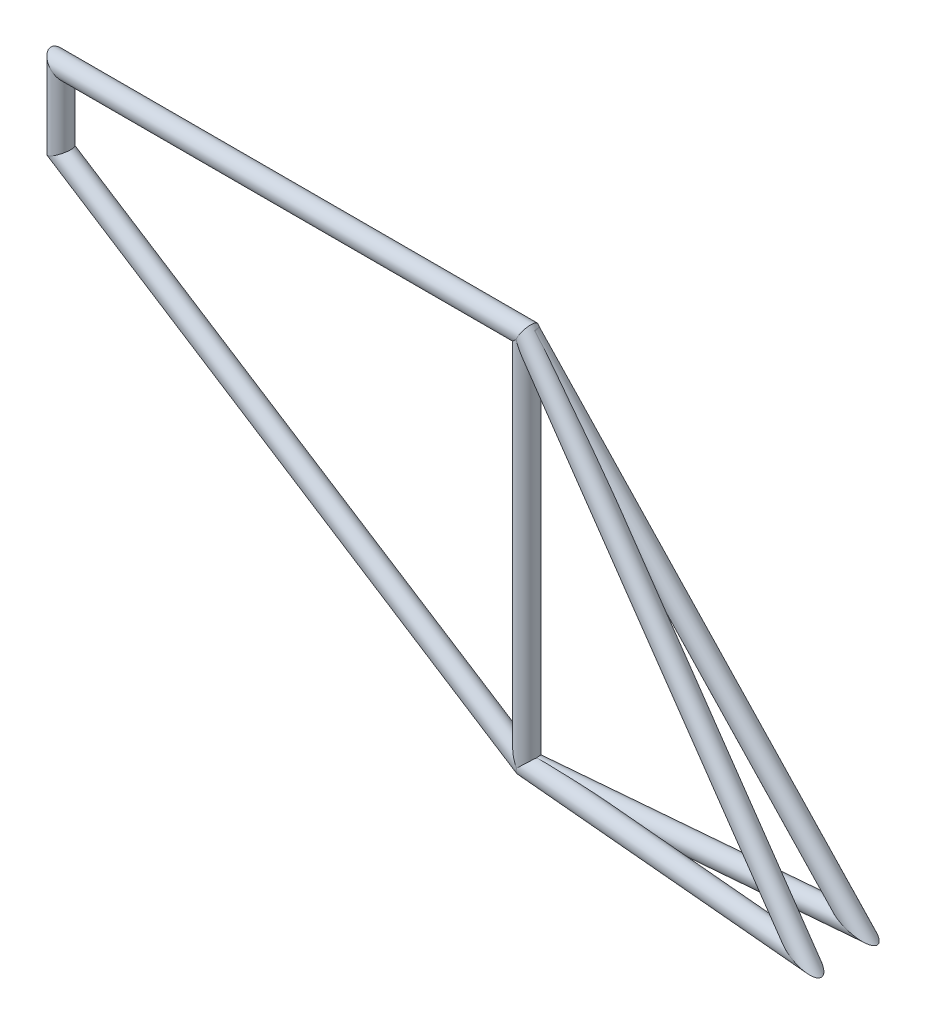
ISO-10303-21;
HEADER;
FILE_DESCRIPTION(('STEP AP214'),'2;1');
FILE_NAME('part.step','',(''),(''),'','','');
FILE_SCHEMA(('AUTOMOTIVE_DESIGN { 1 0 10303 214 1 1 1 1 }'));
ENDSEC;
DATA;
#1=APPLICATION_CONTEXT('core data for automotive mechanical design processes');
#2=APPLICATION_PROTOCOL_DEFINITION('international standard','automotive_design',2000,#1);
#3=PRODUCT_CONTEXT('',#1,'mechanical');
#4=PRODUCT('Part','Part','',(#3));
#5=PRODUCT_RELATED_PRODUCT_CATEGORY('part','',(#4));
#6=PRODUCT_DEFINITION_FORMATION('','',#4);
#7=PRODUCT_DEFINITION_CONTEXT('part definition',#1,'design');
#8=PRODUCT_DEFINITION('design','',#6,#7);
#9=PRODUCT_DEFINITION_SHAPE('','',#8);
#10=(LENGTH_UNIT() NAMED_UNIT(*) SI_UNIT(.MILLI.,.METRE.));
#11=(NAMED_UNIT(*) PLANE_ANGLE_UNIT() SI_UNIT($,.RADIAN.));
#12=(NAMED_UNIT(*) SI_UNIT($,.STERADIAN.) SOLID_ANGLE_UNIT());
#13=UNCERTAINTY_MEASURE_WITH_UNIT(LENGTH_MEASURE(1.E-05),#10,'distance_accuracy_value','');
#14=(GEOMETRIC_REPRESENTATION_CONTEXT(3) GLOBAL_UNCERTAINTY_ASSIGNED_CONTEXT((#13)) GLOBAL_UNIT_ASSIGNED_CONTEXT((#10,
#11,#12)) REPRESENTATION_CONTEXT('',''));
#15=CARTESIAN_POINT('',(0.,0.,0.));
#16=DIRECTION('',(0.,0.,1.));
#17=DIRECTION('',(1.,0.,0.));
#18=AXIS2_PLACEMENT_3D('',#15,#16,#17);
#19=CARTESIAN_POINT('',(1.11022302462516E-13,400.,0.));
#20=DIRECTION('',(0.628193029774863,-0.776114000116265,-0.0549597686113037));
#21=DIRECTION('',(0.777288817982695,0.629143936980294,0.));
#22=AXIS2_PLACEMENT_3D('',#19,#20,#21);
#23=CYLINDRICAL_SURFACE('',#22,7.89940000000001);
#24=CARTESIAN_POINT('',(323.763276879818,-1.11022302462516E-13,-28.3256163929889));
#25=DIRECTION('',(-0.42813625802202,-0.902937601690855,0.0374570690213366));
#26=DIRECTION('',(0.899501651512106,-0.429771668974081,-0.0786961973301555));
#27=AXIS2_PLACEMENT_3D('',#24,#25,#26);
#28=ELLIPSE('',#27,18.3804577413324,7.89940000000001);
#29=CARTESIAN_POINT('',(340.296528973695,-7.89940000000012,-29.7720885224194));
#30=VERTEX_POINT('',#29);
#31=EDGE_CURVE('E104',#30,#30,#28,.T.);
#32=ORIENTED_EDGE('',*,*,#31,.T.);
#33=EDGE_LOOP('',(#32));
#34=FACE_BOUND('',#33,.T.);
#35=CARTESIAN_POINT('',(47.1776042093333,354.269249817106,-3.59031506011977));
#36=CARTESIAN_POINT('',(46.7641201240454,354.780093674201,-3.62649184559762));
#37=CARTESIAN_POINT('',(46.3499078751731,355.29027051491,-3.66375465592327));
#38=CARTESIAN_POINT('',(45.519883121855,356.309141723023,-3.74066823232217));
#39=CARTESIAN_POINT('',(45.1040706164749,356.817836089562,-3.7803189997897));
#40=CARTESIAN_POINT('',(44.2706700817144,357.833595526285,-3.86224178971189));
#41=CARTESIAN_POINT('',(43.8530819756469,358.340660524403,-3.90451392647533));
#42=CARTESIAN_POINT('',(43.0159536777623,359.352924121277,-3.99194728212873));
#43=CARTESIAN_POINT('',(42.5964134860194,359.858122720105,-4.03710850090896));
#44=CARTESIAN_POINT('',(41.3336779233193,361.371602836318,-4.17745636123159));
#45=CARTESIAN_POINT('',(40.4872135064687,362.376735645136,-4.27742513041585));
#46=CARTESIAN_POINT('',(39.2091811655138,363.875997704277,-4.43915384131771));
#47=CARTESIAN_POINT('',(38.7817931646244,364.374331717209,-4.49502427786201));
#48=CARTESIAN_POINT('',(37.9237958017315,365.367707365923,-4.61115786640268));
#49=CARTESIAN_POINT('',(37.4931864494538,365.862749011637,-4.67142100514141));
#50=CARTESIAN_POINT('',(36.6827272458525,366.786809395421,-4.78895824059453));
#51=CARTESIAN_POINT('',(36.3033178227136,367.216287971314,-4.84565226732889));
#52=CARTESIAN_POINT('',(35.541227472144,368.071758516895,-4.96319453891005));
#53=CARTESIAN_POINT('',(35.1585465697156,368.497750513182,-5.02404275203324));
#54=CARTESIAN_POINT('',(34.3893016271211,369.345721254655,-5.15036253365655));
#55=CARTESIAN_POINT('',(34.0027366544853,369.767698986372,-5.21583523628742));
#56=CARTESIAN_POINT('',(33.2251841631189,370.606726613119,-5.3519054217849));
#57=CARTESIAN_POINT('',(32.8341966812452,371.023776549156,-5.42250286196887));
#58=CARTESIAN_POINT('',(32.0476987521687,371.851188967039,-5.56927687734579));
#59=CARTESIAN_POINT('',(31.652197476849,372.261561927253,-5.64544341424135));
#60=CARTESIAN_POINT('',(30.8549936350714,373.075045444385,-5.80412135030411));
#61=CARTESIAN_POINT('',(30.4532908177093,373.478155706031,-5.88663300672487));
#62=CARTESIAN_POINT('',(29.642630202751,374.275128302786,-6.05868558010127));
#63=CARTESIAN_POINT('',(29.2336757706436,374.668994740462,-6.14822329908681));
#64=CARTESIAN_POINT('',(28.406773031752,375.445220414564,-6.3351407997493));
#65=CARTESIAN_POINT('',(27.9888257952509,375.827581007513,-6.43251965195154));
#66=CARTESIAN_POINT('',(27.2480546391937,376.483371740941,-6.61042286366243));
#67=CARTESIAN_POINT('',(26.927668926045,376.760066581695,-6.6890474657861));
#68=CARTESIAN_POINT('',(26.2794962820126,377.303184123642,-6.85149095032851));
#69=CARTESIAN_POINT('',(25.9517086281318,377.569605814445,-6.93531034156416));
#70=CARTESIAN_POINT('',(25.2868343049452,378.089995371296,-7.10854397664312));
#71=CARTESIAN_POINT('',(24.9497325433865,378.343940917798,-7.19796763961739));
#72=CARTESIAN_POINT('',(24.2651578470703,378.835274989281,-7.38238352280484));
#73=CARTESIAN_POINT('',(23.9176873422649,379.072667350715,-7.4773744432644));
#74=CARTESIAN_POINT('',(23.2986352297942,379.469263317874,-7.64833682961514));
#75=CARTESIAN_POINT('',(23.0297656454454,379.633190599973,-7.72313573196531));
#76=CARTESIAN_POINT('',(22.4839433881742,379.945962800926,-7.87548158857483));
#77=CARTESIAN_POINT('',(22.206988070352,380.094802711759,-7.95302944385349));
#78=CARTESIAN_POINT('',(21.6451495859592,380.372814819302,-8.10991918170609));
#79=CARTESIAN_POINT('',(21.3603001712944,380.50205891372,-8.18925321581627));
#80=CARTESIAN_POINT('',(20.7810381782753,380.736006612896,-8.34875909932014));
#81=CARTESIAN_POINT('',(20.486635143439,380.840733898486,-8.42893006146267));
#82=CARTESIAN_POINT('',(19.9254488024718,381.0070054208,-8.5780236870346));
#83=CARTESIAN_POINT('',(19.659840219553,381.07232113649,-8.6470945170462));
#84=CARTESIAN_POINT('',(19.1211312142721,381.171540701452,-8.78201712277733));
#85=CARTESIAN_POINT('',(18.8480207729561,381.205400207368,-8.84786423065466));
#86=CARTESIAN_POINT('',(18.4335816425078,381.22568674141,-8.9415949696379));
#87=CARTESIAN_POINT('',(18.2935782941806,381.227259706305,-8.97220727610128));
#88=CARTESIAN_POINT('',(18.0133249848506,381.218501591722,-9.0308585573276));
#89=CARTESIAN_POINT('',(17.8730749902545,381.208168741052,-9.05889714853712));
#90=CARTESIAN_POINT('',(17.5939457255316,381.174229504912,-9.11149492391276));
#91=CARTESIAN_POINT('',(17.4550635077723,381.150665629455,-9.13606493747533));
#92=CARTESIAN_POINT('',(17.179919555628,381.089031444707,-9.18090646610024));
#93=CARTESIAN_POINT('',(17.0436560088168,381.050971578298,-9.20118105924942));
#94=CARTESIAN_POINT('',(16.7374916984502,380.946261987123,-9.24154632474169));
#95=CARTESIAN_POINT('',(16.5690379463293,380.874560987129,-9.25994695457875));
#96=CARTESIAN_POINT('',(16.245018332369,380.704991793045,-9.28640197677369));
#97=CARTESIAN_POINT('',(16.0894431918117,380.607142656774,-9.2944638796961));
#98=CARTESIAN_POINT('',(15.7960147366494,380.386853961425,-9.29940210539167));
#99=CARTESIAN_POINT('',(15.6582013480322,380.264360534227,-9.29625366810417));
#100=CARTESIAN_POINT('',(15.4045959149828,379.999046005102,-9.27906352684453));
#101=CARTESIAN_POINT('',(15.2888135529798,379.856216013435,-9.26501704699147));
#102=CARTESIAN_POINT('',(15.0827802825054,379.558264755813,-9.22779386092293));
#103=CARTESIAN_POINT('',(14.9921082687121,379.403410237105,-9.20478562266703));
#104=CARTESIAN_POINT('',(14.8329955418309,379.083993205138,-9.15148565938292));
#105=CARTESIAN_POINT('',(14.7645632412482,378.919427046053,-9.12119118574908));
#106=CARTESIAN_POINT('',(14.6099643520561,378.474478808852,-9.0335262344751));
#107=CARTESIAN_POINT('',(14.5415324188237,378.188828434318,-8.9714165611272));
#108=CARTESIAN_POINT('',(14.4729990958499,377.756797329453,-8.87228811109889));
#109=CARTESIAN_POINT('',(14.4558404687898,377.611920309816,-8.83818196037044));
#110=CARTESIAN_POINT('',(14.4316406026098,377.321647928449,-8.76855560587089));
#111=CARTESIAN_POINT('',(14.4245974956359,377.176252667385,-8.7330356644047));
#112=CARTESIAN_POINT('',(14.4174459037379,376.772010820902,-8.63300509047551));
#113=CARTESIAN_POINT('',(14.427048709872,376.513239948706,-8.56751751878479));
#114=CARTESIAN_POINT('',(14.4690237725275,375.997734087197,-8.43569608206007));
#115=CARTESIAN_POINT('',(14.5014155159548,375.741001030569,-8.36936154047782));
#116=CARTESIAN_POINT('',(14.5847301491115,375.230034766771,-8.237005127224));
#117=CARTESIAN_POINT('',(14.6356868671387,374.975806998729,-8.17098405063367));
#118=CARTESIAN_POINT('',(14.7527328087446,374.470708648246,-8.04017917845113));
#119=CARTESIAN_POINT('',(14.8188166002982,374.21983689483,-7.97539494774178));
#120=CARTESIAN_POINT('',(15.0020011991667,373.588582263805,-7.81345483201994));
#121=CARTESIAN_POINT('',(15.1275312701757,373.210362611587,-7.71742879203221));
#122=CARTESIAN_POINT('',(15.4009875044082,372.460824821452,-7.53012960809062));
#123=CARTESIAN_POINT('',(15.5489260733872,372.089510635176,-7.43885913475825));
#124=CARTESIAN_POINT('',(15.8625953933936,371.352418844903,-7.2611660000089));
#125=CARTESIAN_POINT('',(16.0283614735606,370.986653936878,-7.17475350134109));
#126=CARTESIAN_POINT('',(16.3738105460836,370.260724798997,-7.00694448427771));
#127=CARTESIAN_POINT('',(16.5534908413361,369.900559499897,-6.92554699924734));
#128=CARTESIAN_POINT('',(16.9253105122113,369.182763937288,-6.76704657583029));
#129=CARTESIAN_POINT('',(17.1175218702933,368.825164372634,-6.68997424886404));
#130=CARTESIAN_POINT('',(17.511312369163,368.114189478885,-6.54041243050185));
#131=CARTESIAN_POINT('',(17.7128919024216,367.760814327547,-6.46792313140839));
#132=CARTESIAN_POINT('',(18.1235589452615,367.058202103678,-6.32732007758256));
#133=CARTESIAN_POINT('',(18.33263666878,366.70896037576,-6.25920092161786));
#134=CARTESIAN_POINT('',(18.757285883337,366.013715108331,-6.12694056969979));
#135=CARTESIAN_POINT('',(18.972857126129,365.667711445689,-6.06279922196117));
#136=CARTESIAN_POINT('',(19.4390269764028,364.931942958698,-5.92977675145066));
#137=CARTESIAN_POINT('',(19.6904207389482,364.542586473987,-5.86142731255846));
#138=CARTESIAN_POINT('',(20.1991579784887,363.76702654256,-5.7290733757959));
#139=CARTESIAN_POINT('',(20.4565016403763,363.380823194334,-5.66506901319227));
#140=CARTESIAN_POINT('',(20.976252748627,362.611125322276,-5.54103005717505));
#141=CARTESIAN_POINT('',(21.2386608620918,362.227631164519,-5.48099599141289));
#142=CARTESIAN_POINT('',(21.7677810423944,361.463063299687,-5.36457170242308));
#143=CARTESIAN_POINT('',(22.0344931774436,361.081989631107,-5.30818153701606));
#144=CARTESIAN_POINT('',(22.8404601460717,359.941538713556,-5.14395065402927));
#145=CARTESIAN_POINT('',(23.3852585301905,359.185353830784,-5.04111701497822));
#146=CARTESIAN_POINT('',(24.4859765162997,357.67977973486,-4.84670137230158));
#147=CARTESIAN_POINT('',(25.0418954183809,356.930390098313,-4.75511866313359));
#148=CARTESIAN_POINT('',(26.1637039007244,355.435386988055,-4.58130195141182));
#149=CARTESIAN_POINT('',(26.7296129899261,354.689785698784,-4.49908930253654));
#150=CARTESIAN_POINT('',(27.8684221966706,353.203074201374,-4.34284879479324));
#151=CARTESIAN_POINT('',(28.4413224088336,352.461964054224,-4.26882104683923));
#152=CARTESIAN_POINT('',(29.5926349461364,350.983748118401,-4.12782663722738));
#153=CARTESIAN_POINT('',(30.1710454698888,350.246641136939,-4.06085774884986));
#154=CARTESIAN_POINT('',(31.332594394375,348.775642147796,-3.93300852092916));
#155=CARTESIAN_POINT('',(31.9157327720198,348.041750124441,-3.87212815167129));
#156=CARTESIAN_POINT('',(33.0853475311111,346.577580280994,-3.75573405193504));
#157=CARTESIAN_POINT('',(33.6718193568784,345.847299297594,-3.70021429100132));
#158=CARTESIAN_POINT('',(34.84820989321,344.389178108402,-3.59381072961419));
#159=CARTESIAN_POINT('',(35.4381286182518,343.661337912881,-3.54292694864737));
#160=CARTESIAN_POINT('',(37.2124648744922,341.480974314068,-3.39636996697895));
#161=CARTESIAN_POINT('',(38.4013859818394,340.031703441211,-3.30679857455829));
#162=CARTESIAN_POINT('',(40.7874279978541,337.142045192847,-3.14052872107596));
#163=CARTESIAN_POINT('',(41.9845377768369,335.701649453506,-3.06381542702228));
#164=CARTESIAN_POINT('',(44.3868561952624,332.82717722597,-2.92061255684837));
#165=CARTESIAN_POINT('',(45.5920646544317,331.393100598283,-2.85412275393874));
#166=CARTESIAN_POINT('',(48.0004855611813,328.541615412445,-2.72992961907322));
#167=CARTESIAN_POINT('',(49.2036430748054,327.124163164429,-2.67216311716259));
#168=CARTESIAN_POINT('',(51.6165813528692,324.294636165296,-2.56338489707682));
#169=CARTESIAN_POINT('',(52.8263621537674,322.882561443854,-2.51237321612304));
#170=CARTESIAN_POINT('',(55.2526799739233,320.063279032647,-2.41597345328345));
#171=CARTESIAN_POINT('',(56.4692189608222,318.656072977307,-2.37058710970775));
#172=CARTESIAN_POINT('',(58.908660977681,315.847047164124,-2.28457213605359));
#173=CARTESIAN_POINT('',(60.1315639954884,314.445227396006,-2.24394349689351));
#174=CARTESIAN_POINT('',(62.5829187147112,311.648330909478,-2.16676606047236));
#175=CARTESIAN_POINT('',(63.8113651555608,310.253249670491,-2.13021400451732));
#176=CARTESIAN_POINT('',(66.275143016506,307.469088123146,-2.06057878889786));
#177=CARTESIAN_POINT('',(67.5104744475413,306.08000782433,-2.02749563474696));
#178=CARTESIAN_POINT('',(69.9884625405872,303.308580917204,-1.96433192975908));
#179=CARTESIAN_POINT('',(71.2311184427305,301.926233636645,-1.93425107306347));
#180=CARTESIAN_POINT('',(73.7247051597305,299.16897337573,-1.87670022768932));
#181=CARTESIAN_POINT('',(74.9756359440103,297.794060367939,-1.84923022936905));
#182=CARTESIAN_POINT('',(77.487340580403,295.052453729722,-1.79657002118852));
#183=CARTESIAN_POINT('',(78.7481172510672,293.685762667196,-1.77138049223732));
#184=CARTESIAN_POINT('',(81.280908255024,290.962666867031,-1.72301787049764));
#185=CARTESIAN_POINT('',(82.5529230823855,289.606262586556,-1.69984486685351));
#186=CARTESIAN_POINT('',(84.4713188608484,287.581404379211,-1.66642771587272));
#187=CARTESIAN_POINT('',(85.1125286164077,286.908060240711,-1.65551214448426));
#188=CARTESIAN_POINT('',(86.3988680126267,285.565121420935,-1.63410408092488));
#189=CARTESIAN_POINT('',(87.0439976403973,284.895526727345,-1.62361158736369));
#190=CARTESIAN_POINT('',(88.338710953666,283.560747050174,-1.60302737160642));
#191=CARTESIAN_POINT('',(88.9882942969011,282.895561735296,-1.59293561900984));
#192=CARTESIAN_POINT('',(90.2927363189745,281.570383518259,-1.57313131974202));
#193=CARTESIAN_POINT('',(90.9475949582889,280.910390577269,-1.56341877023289));
#194=CARTESIAN_POINT('',(92.2637870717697,279.596606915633,-1.54435214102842));
#195=CARTESIAN_POINT('',(92.925121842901,278.9428174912,-1.53499813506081));
#196=CARTESIAN_POINT('',(94.2557613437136,277.643185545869,-1.51663312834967));
#197=CARTESIAN_POINT('',(94.9250672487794,276.997344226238,-1.50762217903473));
#198=CARTESIAN_POINT('',(96.274058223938,275.716095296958,-1.48992863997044));
#199=CARTESIAN_POINT('',(96.9537465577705,275.080691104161,-1.48124615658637));
#200=CARTESIAN_POINT('',(97.983714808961,274.139255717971,-1.46846747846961));
#201=CARTESIAN_POINT('',(98.3287107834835,273.82744679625,-1.46424953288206));
#202=CARTESIAN_POINT('',(99.0230181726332,273.208677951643,-1.45589495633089));
#203=CARTESIAN_POINT('',(99.372329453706,272.901717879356,-1.45175832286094));
#204=CARTESIAN_POINT('',(100.076814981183,272.293694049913,-1.44356258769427));
#205=CARTESIAN_POINT('',(100.431995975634,271.992638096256,-1.4395035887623));
#206=CARTESIAN_POINT('',(101.149812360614,271.398798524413,-1.43146835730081));
#207=CARTESIAN_POINT('',(101.512454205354,271.106022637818,-1.42749220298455));
#208=CARTESIAN_POINT('',(102.064381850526,270.676180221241,-1.42159611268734));
#209=CARTESIAN_POINT('',(102.249908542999,270.534291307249,-1.41963984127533));
#210=CARTESIAN_POINT('',(102.624083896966,270.254701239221,-1.41575436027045));
#211=CARTESIAN_POINT('',(102.812732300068,270.116999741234,-1.41382514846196));
#212=CARTESIAN_POINT('',(103.193702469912,269.847400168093,-1.41000102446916));
#213=CARTESIAN_POINT('',(103.386018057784,269.71549338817,-1.40810606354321));
#214=CARTESIAN_POINT('',(103.775820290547,269.45959988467,-1.40435570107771));
#215=CARTESIAN_POINT('',(103.97330457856,269.335609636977,-1.40250028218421));
#216=CARTESIAN_POINT('',(104.275878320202,269.158588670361,-1.39975282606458));
#217=CARTESIAN_POINT('',(104.378213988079,269.100864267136,-1.39883939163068));
#218=CARTESIAN_POINT('',(104.58535054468,268.989659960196,-1.39703062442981));
#219=CARTESIAN_POINT('',(104.690154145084,268.93618503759,-1.39613531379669));
#220=CARTESIAN_POINT('',(104.901929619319,268.835703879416,-1.39437850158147));
#221=CARTESIAN_POINT('',(105.008880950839,268.788654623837,-1.39351680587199));
#222=CARTESIAN_POINT('',(105.22630175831,268.703713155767,-1.39183711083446));
#223=CARTESIAN_POINT('',(105.336762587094,268.665800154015,-1.39101901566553));
#224=CARTESIAN_POINT('',(105.507089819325,268.620450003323,-1.38984368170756));
#225=CARTESIAN_POINT('',(105.56536983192,268.607166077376,-1.38945619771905));
#226=CARTESIAN_POINT('',(105.683081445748,268.586547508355,-1.38871396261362));
#227=CARTESIAN_POINT('',(105.742513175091,268.579213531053,-1.3883592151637));
#228=CARTESIAN_POINT('',(105.845792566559,268.574135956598,-1.38779218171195));
#229=CARTESIAN_POINT('',(105.889524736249,268.574340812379,-1.38756726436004));
#230=CARTESIAN_POINT('',(105.976517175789,268.581136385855,-1.38716084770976));
#231=CARTESIAN_POINT('',(106.019778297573,268.587712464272,-1.38697925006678));
#232=CARTESIAN_POINT('',(106.091675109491,268.60598836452,-1.38672442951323));
#233=CARTESIAN_POINT('',(106.120834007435,268.615582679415,-1.38663503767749));
#234=CARTESIAN_POINT('',(106.177189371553,268.63940622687,-1.38649598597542));
#235=CARTESIAN_POINT('',(106.204388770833,268.653628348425,-1.38644626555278));
#236=CARTESIAN_POINT('',(106.255933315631,268.686879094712,-1.38639222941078));
#237=CARTESIAN_POINT('',(106.2802601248,268.705936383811,-1.38638819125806));
#238=CARTESIAN_POINT('',(106.325000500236,268.748200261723,-1.38642679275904));
#239=CARTESIAN_POINT('',(106.345411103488,268.771409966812,-1.38646946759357));
#240=CARTESIAN_POINT('',(106.385017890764,268.824951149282,-1.38660654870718));
#241=CARTESIAN_POINT('',(106.403470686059,268.85582663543,-1.38670826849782));
#242=CARTESIAN_POINT('',(106.435171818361,268.92012949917,-1.38695495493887));
#243=CARTESIAN_POINT('',(106.448409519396,268.953561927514,-1.38710000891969));
#244=CARTESIAN_POINT('',(106.478109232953,269.045021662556,-1.38753066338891));
#245=CARTESIAN_POINT('',(106.490630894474,269.104297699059,-1.3878447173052));
#246=CARTESIAN_POINT('',(106.507307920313,269.223971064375,-1.38852381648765));
#247=CARTESIAN_POINT('',(106.511436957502,269.284371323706,-1.38888901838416));
#248=CARTESIAN_POINT('',(106.514546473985,269.43727627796,-1.38985241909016));
#249=CARTESIAN_POINT('',(106.509639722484,269.52983441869,-1.39047154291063));
#250=CARTESIAN_POINT('',(106.491427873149,269.7141755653,-1.39175025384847));
#251=CARTESIAN_POINT('',(106.478102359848,269.80595613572,-1.39240993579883));
#252=CARTESIAN_POINT('',(106.445600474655,269.989013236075,-1.39375851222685));
#253=CARTESIAN_POINT('',(106.426389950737,270.080283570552,-1.39444755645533));
#254=CARTESIAN_POINT('',(106.383766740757,270.261691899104,-1.39584240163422));
#255=CARTESIAN_POINT('',(106.36035929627,270.351831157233,-1.39654818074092));
#256=CARTESIAN_POINT('',(106.278595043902,270.645357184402,-1.39887908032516));
#257=CARTESIAN_POINT('',(106.213665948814,270.846901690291,-1.40053129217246));
#258=CARTESIAN_POINT('',(106.073940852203,271.246575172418,-1.40387756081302));
#259=CARTESIAN_POINT('',(105.999137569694,271.444701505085,-1.4055716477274));
#260=CARTESIAN_POINT('',(105.84251104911,271.838673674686,-1.40899465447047));
#261=CARTESIAN_POINT('',(105.76067211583,272.034513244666,-1.41072364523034));
#262=CARTESIAN_POINT('',(105.59194222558,272.424006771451,-1.41420712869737));
#263=CARTESIAN_POINT('',(105.505050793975,272.617660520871,-1.41596162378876));
#264=CARTESIAN_POINT('',(105.327366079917,273.003137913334,-1.41949267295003));
#265=CARTESIAN_POINT('',(105.236573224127,273.194961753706,-1.42126922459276));
#266=CARTESIAN_POINT('',(105.051844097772,273.577103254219,-1.42484276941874));
#267=CARTESIAN_POINT('',(104.957907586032,273.767420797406,-1.42663976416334));
#268=CARTESIAN_POINT('',(104.767591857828,274.146468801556,-1.43025010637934));
#269=CARTESIAN_POINT('',(104.671216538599,274.335201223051,-1.43206342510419));
#270=CARTESIAN_POINT('',(104.476293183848,274.711531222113,-1.43570821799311));
#271=CARTESIAN_POINT('',(104.377745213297,274.899128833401,-1.43753969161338));
#272=CARTESIAN_POINT('',(104.081082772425,275.457124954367,-1.44302797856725));
#273=CARTESIAN_POINT('',(103.880251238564,275.826079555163,-1.44671066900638));
#274=CARTESIAN_POINT('',(103.472996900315,276.560894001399,-1.4541431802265));
#275=CARTESIAN_POINT('',(103.266573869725,276.926753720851,-1.45789300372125));
#276=CARTESIAN_POINT('',(102.640604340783,278.02062163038,-1.46924274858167));
#277=CARTESIAN_POINT('',(102.214408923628,278.744823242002,-1.47694200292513));
#278=CARTESIAN_POINT('',(101.349342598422,280.186607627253,-1.49261507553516));
#279=CARTESIAN_POINT('',(100.910458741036,280.904182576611,-1.50058917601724));
#280=CARTESIAN_POINT('',(100.023489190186,282.333535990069,-1.51681148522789));
#281=CARTESIAN_POINT('',(99.5754041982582,283.045314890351,-1.52505967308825));
#282=CARTESIAN_POINT('',(98.6725488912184,284.463329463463,-1.54183044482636));
#283=CARTESIAN_POINT('',(98.2177878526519,285.169571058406,-1.55035266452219));
#284=CARTESIAN_POINT('',(97.3023364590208,286.578211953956,-1.56769409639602));
#285=CARTESIAN_POINT('',(96.8416459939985,287.280611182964,-1.57651331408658));
#286=CARTESIAN_POINT('',(95.9155390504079,288.681756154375,-1.59445789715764));
#287=CARTESIAN_POINT('',(95.450125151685,289.380503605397,-1.60358310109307));
#288=CARTESIAN_POINT('',(94.5150423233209,290.775132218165,-1.62215938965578));
#289=CARTESIAN_POINT('',(94.0453734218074,291.471013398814,-1.63161047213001));
#290=CARTESIAN_POINT('',(92.6663484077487,293.502542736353,-1.65975238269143));
#291=CARTESIAN_POINT('',(91.7519906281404,294.834790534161,-1.6789063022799));
#292=CARTESIAN_POINT('',(89.9123477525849,297.491706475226,-1.71861692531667));
#293=CARTESIAN_POINT('',(88.9870625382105,298.816374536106,-1.7391736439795));
#294=CARTESIAN_POINT('',(87.1273539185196,301.459328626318,-1.78184701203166));
#295=CARTESIAN_POINT('',(86.1929301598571,302.777614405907,-1.80396372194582));
#296=CARTESIAN_POINT('',(84.3162727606,305.408585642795,-1.849938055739));
#297=CARTESIAN_POINT('',(83.3740391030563,306.721271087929,-1.87379568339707));
#298=CARTESIAN_POINT('',(81.4823081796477,309.342181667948,-1.92347390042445));
#299=CARTESIAN_POINT('',(80.5328080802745,310.650404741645,-1.94929529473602));
#300=CARTESIAN_POINT('',(78.6276165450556,313.262289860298,-2.003140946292));
#301=CARTESIAN_POINT('',(77.6719251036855,314.565951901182,-2.03116520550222));
#302=CARTESIAN_POINT('',(75.7548834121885,317.16899720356,-2.08970863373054));
#303=CARTESIAN_POINT('',(74.7935333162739,318.468380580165,-2.12022773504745));
#304=CARTESIAN_POINT('',(72.8655092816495,321.063124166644,-2.18410892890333));
#305=CARTESIAN_POINT('',(71.8988353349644,322.358484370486,-2.21747102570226));
#306=CARTESIAN_POINT('',(69.9608313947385,324.944741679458,-2.2874379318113));
#307=CARTESIAN_POINT('',(68.9895036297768,326.235640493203,-2.32404131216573));
#308=CARTESIAN_POINT('',(67.0419039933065,328.81358784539,-2.40100259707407));
#309=CARTESIAN_POINT('',(66.0656321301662,330.100636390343,-2.4413604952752));
#310=CARTESIAN_POINT('',(64.1081358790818,332.670877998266,-2.5264390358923));
#311=CARTESIAN_POINT('',(63.1269113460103,333.954070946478,-2.57115980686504));
#312=CARTESIAN_POINT('',(61.1594432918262,336.516414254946,-2.66570792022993));
#313=CARTESIAN_POINT('',(60.1731997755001,337.795564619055,-2.71553525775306));
#314=CARTESIAN_POINT('',(58.1957399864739,340.349184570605,-2.82120574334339));
#315=CARTESIAN_POINT('',(57.2045252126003,341.623655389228,-2.87704717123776));
#316=CARTESIAN_POINT('',(55.2164295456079,344.16784684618,-2.99591653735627));
#317=CARTESIAN_POINT('',(54.2195486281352,345.437567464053,-3.05894450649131));
#318=CARTESIAN_POINT('',(52.2195242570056,347.971514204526,-3.19366033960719));
#319=CARTESIAN_POINT('',(51.216381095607,349.23574057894,-3.26534780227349));
#320=CARTESIAN_POINT('',(49.2028219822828,351.757733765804,-3.41928141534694));
#321=CARTESIAN_POINT('',(48.1924061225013,353.015500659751,-3.50152743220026));
#322=CARTESIAN_POINT('',(47.1776042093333,354.269249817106,-3.59031506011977));
#323=B_SPLINE_CURVE_WITH_KNOTS('',3,(#35,#36,#37,#38,#39,#40,#41,#42,#43,#44,#45,#46,#47,#48,
#49,#50,#51,#52,#53,#54,#55,#56,#57,#58,#59,#60,#61,#62,#63,#64,#65,#66,#67,#68,#69,#70,#71,#72,
#73,#74,#75,#76,#77,#78,#79,#80,#81,#82,#83,#84,#85,#86,#87,#88,#89,#90,#91,#92,#93,#94,#95,#96,
#97,#98,#99,#100,#101,#102,#103,#104,#105,#106,#107,#108,#109,#110,#111,#112,#113,#114,#115,
#116,#117,#118,#119,#120,#121,#122,#123,#124,#125,#126,#127,#128,#129,#130,#131,#132,#133,#134,
#135,#136,#137,#138,#139,#140,#141,#142,#143,#144,#145,#146,#147,#148,#149,#150,#151,#152,#153,
#154,#155,#156,#157,#158,#159,#160,#161,#162,#163,#164,#165,#166,#167,#168,#169,#170,#171,#172,
#173,#174,#175,#176,#177,#178,#179,#180,#181,#182,#183,#184,#185,#186,#187,#188,#189,#190,#191,
#192,#193,#194,#195,#196,#197,#198,#199,#200,#201,#202,#203,#204,#205,#206,#207,#208,#209,#210,
#211,#212,#213,#214,#215,#216,#217,#218,#219,#220,#221,#222,#223,#224,#225,#226,#227,#228,#229,
#230,#231,#232,#233,#234,#235,#236,#237,#238,#239,#240,#241,#242,#243,#244,#245,#246,#247,#248,
#249,#250,#251,#252,#253,#254,#255,#256,#257,#258,#259,#260,#261,#262,#263,#264,#265,#266,#267,
#268,#269,#270,#271,#272,#273,#274,#275,#276,#277,#278,#279,#280,#281,#282,#283,#284,#285,#286,
#287,#288,#289,#290,#291,#292,#293,#294,#295,#296,#297,#298,#299,#300,#301,#302,#303,#304,#305,
#306,#307,#308,#309,#310,#311,#312,#313,#314,#315,#316,#317,#318,#319,#320,#321,#322),
.UNSPECIFIED.,.T.,.F.,(4,2,2,2,2,2,2,2,2,2,2,2,2,2,2,2,2,2,2,2,2,2,2,2,2,2,2,2,2,2,2,2,2,2,2,2,
2,2,2,2,2,2,2,2,2,2,2,2,2,2,2,2,2,2,2,2,2,2,2,2,2,2,2,2,2,2,2,2,2,2,2,2,2,2,2,2,2,2,2,2,2,2,2,2,
2,2,2,2,2,2,2,2,2,2,2,2,2,2,2,2,2,2,2,2,2,2,2,2,2,2,2,2,2,2,2,2,2,2,2,2,2,2,2,2,2,2,2,2,2,2,2,2,
2,2,2,2,2,2,2,2,2,2,2,4),(0.,1.97462438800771,3.94924992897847,5.92396163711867,
7.89867327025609,11.852109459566,13.8287170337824,15.8053186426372,17.5328762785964,
19.2604207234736,20.988390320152,22.7163455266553,24.4412594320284,26.166243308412,
27.8904465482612,29.614445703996,30.9059757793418,32.1976325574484,33.4915216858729,
34.7851099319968,35.7557334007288,36.7266780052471,37.6939691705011,38.6603221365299,
39.5053126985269,40.3514926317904,40.7810325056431,41.2106362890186,41.6388676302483,
42.066791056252,42.616337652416,43.1654848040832,43.7158455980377,44.2664477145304,
44.8071634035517,45.348083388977,46.2432416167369,46.6925028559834,47.1416811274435,
47.9416508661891,48.742305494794,49.5444263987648,50.3462597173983,51.575020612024,
52.8044642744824,54.0363908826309,55.2680792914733,56.5076025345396,57.7471777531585,
58.9851901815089,60.2231553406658,61.6284992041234,63.0338867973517,64.4394607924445,
65.8450570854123,68.6577943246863,71.4703550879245,74.2892024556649,77.1080880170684,
79.926081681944,82.7440615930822,85.5588335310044,88.3736172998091,94.0035526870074,
99.6269480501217,105.250218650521,110.830583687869,116.410979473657,121.993095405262,
127.575200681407,133.152811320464,138.730430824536,144.307481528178,149.884511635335,
155.463201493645,161.04213784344,163.831740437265,166.621333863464,169.410715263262,
172.20007578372,174.990006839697,177.780354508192,180.571598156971,181.966693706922,
183.361746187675,184.758532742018,186.156583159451,186.857261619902,187.557882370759,
188.257411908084,188.956627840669,189.309050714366,189.661880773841,190.012218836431,
190.361752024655,190.54089104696,190.720050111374,190.850938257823,190.981526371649,
191.073276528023,191.164886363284,191.257052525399,191.34928814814,191.4565950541,
191.564119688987,191.744846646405,191.926139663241,192.203492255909,192.481520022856,
192.761192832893,193.040518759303,193.675265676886,194.310483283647,194.947156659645,
195.583889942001,196.22055376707,196.857266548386,197.493019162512,198.128752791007,
199.388946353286,200.6491909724,203.170005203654,205.69348982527,208.216782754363,
210.736850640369,213.25696532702,215.775770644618,218.294559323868,223.142338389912,
227.990170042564,232.838189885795,237.686220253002,242.53624863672,247.386281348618,
252.236182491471,257.086090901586,261.933871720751,266.781644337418,271.629559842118,
276.477470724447,281.323998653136,286.170547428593,291.016871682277,295.86313464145),.UNSPECIFIED.);
#324=CARTESIAN_POINT('',(47.1776042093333,354.269249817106,-3.59031506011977));
#325=VERTEX_POINT('',#324);
#326=EDGE_CURVE('E101',#325,#325,#323,.T.);
#327=ORIENTED_EDGE('',*,*,#326,.T.);
#328=EDGE_LOOP('',(#327));
#329=FACE_BOUND('',#328,.T.);
#330=ADVANCED_FACE('F56',(#34,#329),#23,.F.);
#331=CARTESIAN_POINT('',(1.11022302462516E-13,400.,0.));
#332=DIRECTION('',(0.628193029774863,-0.776114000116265,-0.0549597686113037));
#333=DIRECTION('',(0.777288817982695,0.629143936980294,0.));
#334=AXIS2_PLACEMENT_3D('',#331,#332,#333);
#335=CYLINDRICAL_SURFACE('',#334,10.668);
#336=CARTESIAN_POINT('',(323.763276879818,-1.11022302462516E-13,-28.3256163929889));
#337=DIRECTION('',(-0.42813625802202,-0.902937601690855,0.0374570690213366));
#338=DIRECTION('',(0.899501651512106,-0.429771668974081,-0.0786961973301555));
#339=AXIS2_PLACEMENT_3D('',#336,#337,#338);
#340=ELLIPSE('',#339,24.8224831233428,10.668);
#341=CARTESIAN_POINT('',(346.091141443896,-10.6680000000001,-30.279051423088));
#342=VERTEX_POINT('',#341);
#343=EDGE_CURVE('E107',#342,#342,#340,.T.);
#344=ORIENTED_EDGE('',*,*,#343,.F.);
#345=EDGE_LOOP('',(#344));
#346=FACE_BOUND('',#345,.T.);
#347=CARTESIAN_POINT('',(1.11022302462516E-13,400.,0.));
#348=DIRECTION('',(0.902272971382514,-0.430088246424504,-0.0304562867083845));
#349=DIRECTION('',(-0.431165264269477,-0.900019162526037,-0.0637339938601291));
#350=AXIS2_PLACEMENT_3D('',#347,#348,#349);
#351=ELLIPSE('',#350,11.8234728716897,10.668);
#352=CARTESIAN_POINT('',(1.10501026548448E-13,400.75355714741,-10.6413521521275));
#353=VERTEX_POINT('',#352);
#354=CARTESIAN_POINT('',(-0.686667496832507,399.313332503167,-10.645877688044));
#355=VERTEX_POINT('',#354);
#356=EDGE_CURVE('E13',#353,#355,#351,.F.);
#357=ORIENTED_EDGE('',*,*,#356,.F.);
#358=CARTESIAN_POINT('',(1.11022302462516E-13,400.,0.));
#359=DIRECTION('',(-0.431165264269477,-0.900019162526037,-0.0637339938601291));
#360=DIRECTION('',(0.902272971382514,-0.430088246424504,-0.0304562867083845));
#361=AXIS2_PLACEMENT_3D('',#358,#359,#360);
#362=ELLIPSE('',#361,24.7422528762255,10.668);
#363=CARTESIAN_POINT('',(0.585731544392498,400.474095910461,-10.6574601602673));
#364=VERTEX_POINT('',#363);
#365=EDGE_CURVE('E67',#364,#353,#362,.F.);
#366=ORIENTED_EDGE('',*,*,#365,.F.);
#367=CARTESIAN_POINT('',(0.,400.,0.));
#368=DIRECTION('',(0.629143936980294,-0.777288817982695,0.));
#369=DIRECTION('',(0.,0.,-1.));
#370=AXIS2_PLACEMENT_3D('',#367,#368,#369);
#371=ELLIPSE('',#370,10.6841483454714,10.668);
#372=CARTESIAN_POINT('',(8.29211711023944,406.711707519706,0.));
#373=VERTEX_POINT('',#372);
#374=EDGE_CURVE('E109',#373,#364,#371,.F.);
#375=ORIENTED_EDGE('',*,*,#374,.F.);
#376=CARTESIAN_POINT('',(0.,400.,0.));
#377=DIRECTION('',(0.,0.,-1.));
#378=DIRECTION('',(0.629143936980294,-0.777288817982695,0.));
#379=AXIS2_PLACEMENT_3D('',#376,#377,#378);
#380=ELLIPSE('',#379,194.105620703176,10.668);
#381=CARTESIAN_POINT('',(10.6679999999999,370.067073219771,-1.88325917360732E-13));
#382=VERTEX_POINT('',#381);
#383=EDGE_CURVE('E97',#382,#373,#380,.F.);
#384=ORIENTED_EDGE('',*,*,#383,.F.);
#385=CARTESIAN_POINT('',(0.,400.,0.));
#386=DIRECTION('',(-0.938781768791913,-0.334578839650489,0.0821327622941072));
#387=DIRECTION('',(0.333305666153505,-0.942367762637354,-0.029160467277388));
#388=AXIS2_PLACEMENT_3D('',#385,#386,#387);
#389=ELLIPSE('',#388,31.8848616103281,10.668);
#390=EDGE_CURVE('E96',#355,#382,#389,.T.);
#391=ORIENTED_EDGE('',*,*,#390,.F.);
#392=EDGE_LOOP('',(#357,#366,#375,#384,#391));
#393=FACE_BOUND('',#392,.T.);
#394=ADVANCED_FACE('F93',(#346,#393),#335,.T.);
#395=CARTESIAN_POINT('',(0.,400.,0.));
#396=DIRECTION('',(-0.938781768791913,-0.334578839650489,0.0821327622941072));
#397=DIRECTION('',(0.335713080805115,-0.941964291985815,0.));
#398=AXIS2_PLACEMENT_3D('',#395,#396,#397);
#399=PLANE('',#398);
#400=ORIENTED_EDGE('',*,*,#390,.T.);
#401=CARTESIAN_POINT('',(0.,400.,0.));
#402=DIRECTION('',(-0.938781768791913,-0.334578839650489,0.0821327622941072));
#403=DIRECTION('',(0.341156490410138,-0.936026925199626,0.0864051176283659));
#404=AXIS2_PLACEMENT_3D('',#401,#402,#403);
#405=ELLIPSE('',#404,32.7690748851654,10.668);
#406=CARTESIAN_POINT('',(-0.376023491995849,398.463579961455,-10.5567815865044));
#407=VERTEX_POINT('',#406);
#408=EDGE_CURVE('E100',#382,#407,#405,.F.);
#409=ORIENTED_EDGE('',*,*,#408,.T.);
#410=CARTESIAN_POINT('',(0.,400.,0.));
#411=DIRECTION('',(-0.938781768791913,-0.334578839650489,0.0821327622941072));
#412=DIRECTION('',(0.344512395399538,-0.911713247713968,0.22380831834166));
#413=AXIS2_PLACEMENT_3D('',#410,#411,#412);
#414=ELLIPSE('',#413,11.363663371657,10.668);
#415=EDGE_CURVE('E74',#407,#355,#414,.F.);
#416=ORIENTED_EDGE('',*,*,#415,.T.);
#417=EDGE_LOOP('',(#400,#409,#416));
#418=FACE_BOUND('',#417,.T.);
#419=ADVANCED_FACE('F131',(#418),#399,.T.);
#420=CARTESIAN_POINT('',(323.763276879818,0.,-28.3256163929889));
#421=DIRECTION('',(-0.42813625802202,-0.902937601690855,0.0374570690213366));
#422=DIRECTION('',(0.903571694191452,-0.428436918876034,0.));
#423=AXIS2_PLACEMENT_3D('',#420,#421,#422);
#424=PLANE('',#423);
#425=ORIENTED_EDGE('',*,*,#31,.F.);
#426=EDGE_LOOP('',(#425));
#427=FACE_BOUND('',#426,.T.);
#428=ORIENTED_EDGE('',*,*,#343,.T.);
#429=EDGE_LOOP('',(#428));
#430=FACE_BOUND('',#429,.T.);
#431=ADVANCED_FACE('F126',(#427,#430),#424,.T.);
#432=CARTESIAN_POINT('',(0.,400.,0.));
#433=DIRECTION('',(0.628193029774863,-0.776114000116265,0.0549597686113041));
#434=DIRECTION('',(0.777288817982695,0.629143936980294,0.));
#435=AXIS2_PLACEMENT_3D('',#432,#433,#434);
#436=CYLINDRICAL_SURFACE('',#435,10.668);
#437=ORIENTED_EDGE('',*,*,#326,.F.);
#438=EDGE_LOOP('',(#437));
#439=FACE_BOUND('',#438,.T.);
#440=ORIENTED_EDGE('',*,*,#383,.T.);
#441=ORIENTED_EDGE('',*,*,#374,.T.);
#442=CARTESIAN_POINT('',(0.,400.,0.));
#443=DIRECTION('',(-0.902272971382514,0.430088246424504,-0.0304562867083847));
#444=DIRECTION('',(-0.431165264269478,-0.900019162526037,0.0637339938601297));
#445=AXIS2_PLACEMENT_3D('',#442,#443,#444);
#446=ELLIPSE('',#445,11.8234728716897,10.668);
#447=EDGE_CURVE('E61',#364,#407,#446,.T.);
#448=ORIENTED_EDGE('',*,*,#447,.T.);
#449=ORIENTED_EDGE('',*,*,#408,.F.);
#450=EDGE_LOOP('',(#440,#441,#448,#449));
#451=FACE_BOUND('',#450,.T.);
#452=ADVANCED_FACE('F58',(#439,#451),#436,.F.);
#453=CARTESIAN_POINT('',(-500.,400.,0.));
#454=DIRECTION('',(1.,0.,0.));
#455=DIRECTION('',(0.,0.,-1.));
#456=AXIS2_PLACEMENT_3D('',#453,#454,#455);
#457=CYLINDRICAL_SURFACE('',#456,10.668);
#458=ORIENTED_EDGE('',*,*,#365,.T.);
#459=ORIENTED_EDGE('',*,*,#356,.T.);
#460=ORIENTED_EDGE('',*,*,#415,.F.);
#461=ORIENTED_EDGE('',*,*,#447,.F.);
#462=EDGE_LOOP('',(#458,#459,#460,#461));
#463=FACE_BOUND('',#462,.T.);
#464=ADVANCED_FACE('F88',(#463),#457,.F.);
#465=CLOSED_SHELL('',(#330,#394,#419,#431,#452,#464));
#466=MANIFOLD_SOLID_BREP('B2',#465);
#467=CARTESIAN_POINT('',(0.,1.11022302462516E-13,0.));
#468=DIRECTION('',(0.,1.,0.));
#469=DIRECTION('',(0.,0.,1.));
#470=AXIS2_PLACEMENT_3D('',#467,#468,#469);
#471=CYLINDRICAL_SURFACE('',#470,7.89940000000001);
#472=CARTESIAN_POINT('',(0.,8.5124309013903,7.89940000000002));
#473=CARTESIAN_POINT('',(-0.28331360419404,8.69375734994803,7.89940222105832));
#474=CARTESIAN_POINT('',(-0.557710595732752,8.88937721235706,7.88418550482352));
#475=CARTESIAN_POINT('',(-1.08843744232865,9.30083329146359,7.82862070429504));
#476=CARTESIAN_POINT('',(-1.34472962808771,9.51670960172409,7.78822184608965));
#477=CARTESIAN_POINT('',(-1.84309095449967,9.96398153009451,7.68562337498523));
#478=CARTESIAN_POINT('',(-2.08500159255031,10.1955052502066,7.62322002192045));
#479=CARTESIAN_POINT('',(-2.55396824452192,10.6670256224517,7.47916523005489));
#480=CARTESIAN_POINT('',(-2.78103258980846,10.9070174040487,7.39752470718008));
#481=CARTESIAN_POINT('',(-3.15013049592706,11.3124841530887,7.24588806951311));
#482=CARTESIAN_POINT('',(-3.29567650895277,11.4766473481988,7.18082242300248));
#483=CARTESIAN_POINT('',(-3.58144399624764,11.8062523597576,7.04265447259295));
#484=CARTESIAN_POINT('',(-3.72166506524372,11.9716942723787,6.96955155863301));
#485=CARTESIAN_POINT('',(-3.99721206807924,12.3031068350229,6.8152595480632));
#486=CARTESIAN_POINT('',(-4.13253437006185,12.4690777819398,6.73406461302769));
#487=CARTESIAN_POINT('',(-4.39841077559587,12.8006340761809,6.56349367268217));
#488=CARTESIAN_POINT('',(-4.5289649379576,12.9662194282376,6.47411776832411));
#489=CARTESIAN_POINT('',(-4.78459855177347,13.2951532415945,6.28752858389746));
#490=CARTESIAN_POINT('',(-4.9097079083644,13.4585092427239,6.19036963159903));
#491=CARTESIAN_POINT('',(-5.15535073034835,13.7832729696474,5.98734263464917));
#492=CARTESIAN_POINT('',(-5.27588386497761,13.9446805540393,5.88147396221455));
#493=CARTESIAN_POINT('',(-5.51211561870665,14.2644855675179,5.66067265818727));
#494=CARTESIAN_POINT('',(-5.62781917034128,14.4228859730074,5.54574963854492));
#495=CARTESIAN_POINT('',(-5.85423505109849,14.7358134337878,5.3061862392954));
#496=CARTESIAN_POINT('',(-5.96494854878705,14.8903413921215,5.18154815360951));
#497=CARTESIAN_POINT('',(-6.16686891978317,15.1745169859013,4.93880628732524));
#498=CARTESIAN_POINT('',(-6.258735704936,15.3047794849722,4.82197301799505));
#499=CARTESIAN_POINT('',(-6.43796298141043,15.5605474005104,4.5799376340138));
#500=CARTESIAN_POINT('',(-6.52532388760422,15.6860532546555,4.45473629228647));
#501=CARTESIAN_POINT('',(-6.69513264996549,15.9313873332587,4.19521228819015));
#502=CARTESIAN_POINT('',(-6.77757209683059,16.0512057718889,4.0608748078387));
#503=CARTESIAN_POINT('',(-6.93664854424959,16.2835539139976,3.78273620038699));
#504=CARTESIAN_POINT('',(-7.01328539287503,16.3960834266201,3.63893482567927));
#505=CARTESIAN_POINT('',(-7.16094942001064,16.6138300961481,3.3391132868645));
#506=CARTESIAN_POINT('',(-7.23187126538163,16.7189069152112,3.18293830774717));
#507=CARTESIAN_POINT('',(-7.36553469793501,16.9176604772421,2.860059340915));
#508=CARTESIAN_POINT('',(-7.42827496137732,17.0113353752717,2.69335365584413));
#509=CARTESIAN_POINT('',(-7.54385865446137,17.1844158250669,2.35018645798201));
#510=CARTESIAN_POINT('',(-7.59673720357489,17.2638719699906,2.17376257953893));
#511=CARTESIAN_POINT('',(-7.69117561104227,17.4060914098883,1.81143545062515));
#512=CARTESIAN_POINT('',(-7.73274457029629,17.4688681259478,1.62553996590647));
#513=CARTESIAN_POINT('',(-7.78989212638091,17.5553004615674,1.3163848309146));
#514=CARTESIAN_POINT('',(-7.80939222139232,17.5848303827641,1.19546377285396));
#515=CARTESIAN_POINT('',(-7.84289532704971,17.6356019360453,0.951155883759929));
#516=CARTESIAN_POINT('',(-7.85689990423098,17.6568459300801,0.827769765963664));
#517=CARTESIAN_POINT('',(-7.87911283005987,17.690555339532,0.579349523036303));
#518=CARTESIAN_POINT('',(-7.88732423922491,17.7030253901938,0.454316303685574));
#519=CARTESIAN_POINT('',(-7.89777849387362,17.7189032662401,0.203417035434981));
#520=CARTESIAN_POINT('',(-7.9000210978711,17.7223107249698,0.0775509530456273));
#521=CARTESIAN_POINT('',(-7.89848360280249,17.7199750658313,-0.174146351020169));
#522=CARTESIAN_POINT('',(-7.89469931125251,17.7142255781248,-0.299977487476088));
#523=CARTESIAN_POINT('',(-7.88118595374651,17.6937046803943,-0.550625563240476));
#524=CARTESIAN_POINT('',(-7.87145447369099,17.6789296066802,-0.675442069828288));
#525=CARTESIAN_POINT('',(-7.84625710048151,17.6407028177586,-0.923189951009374));
#526=CARTESIAN_POINT('',(-7.83078917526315,17.617248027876,-1.04612064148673));
#527=CARTESIAN_POINT('',(-7.7944381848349,17.5621857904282,-1.28933464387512));
#528=CARTESIAN_POINT('',(-7.77355391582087,17.5305765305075,-1.40961736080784));
#529=CARTESIAN_POINT('',(-7.72051098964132,17.4504009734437,-1.67859705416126));
#530=CARTESIAN_POINT('',(-7.68683094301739,17.3995605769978,-1.82632044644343));
#531=CARTESIAN_POINT('',(-7.61226173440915,17.287240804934,-2.11574052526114));
#532=CARTESIAN_POINT('',(-7.57137071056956,17.2257586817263,-2.2574356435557));
#533=CARTESIAN_POINT('',(-7.43903813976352,17.0273010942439,-2.67316843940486));
#534=CARTESIAN_POINT('',(-7.33798619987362,16.87638905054,-2.93761619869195));
#535=CARTESIAN_POINT('',(-7.14225397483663,16.5861431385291,-3.38130125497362));
#536=CARTESIAN_POINT('',(-7.05155000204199,16.4522682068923,-3.56605935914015));
#537=CARTESIAN_POINT('',(-6.8605957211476,16.1721900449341,-3.92088145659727));
#538=CARTESIAN_POINT('',(-6.76034009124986,16.0259799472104,-4.09093715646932));
#539=CARTESIAN_POINT('',(-6.55165776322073,15.7238542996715,-4.41745839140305));
#540=CARTESIAN_POINT('',(-6.44321503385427,15.5679198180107,-4.57389590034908));
#541=CARTESIAN_POINT('',(-6.21937671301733,15.2487547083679,-4.87390022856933));
#542=CARTESIAN_POINT('',(-6.10397874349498,15.085521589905,-5.01746260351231));
#543=CARTESIAN_POINT('',(-5.88538455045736,14.7792989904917,-5.27127117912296));
#544=CARTESIAN_POINT('',(-5.78306908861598,14.6370929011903,-5.38323249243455));
#545=CARTESIAN_POINT('',(-5.57431900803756,14.3496141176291,-5.59910865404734));
#546=CARTESIAN_POINT('',(-5.46788382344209,14.2043410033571,-5.70302239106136));
#547=CARTESIAN_POINT('',(-5.14258296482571,13.7649024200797,-6.00347345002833));
#548=CARTESIAN_POINT('',(-4.91781343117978,13.4672466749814,-6.18861574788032));
#549=CARTESIAN_POINT('',(-4.45283861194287,12.8676611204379,-6.53117048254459));
#550=CARTESIAN_POINT('',(-4.21261777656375,12.5657272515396,-6.68855436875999));
#551=CARTESIAN_POINT('',(-3.71604368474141,11.9626273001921,-6.97667189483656));
#552=CARTESIAN_POINT('',(-3.45969922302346,11.6614608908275,-7.10741990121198));
#553=CARTESIAN_POINT('',(-3.01389284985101,11.1607684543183,-7.30450084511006));
#554=CARTESIAN_POINT('',(-2.82937640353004,10.9596490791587,-7.37803845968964));
#555=CARTESIAN_POINT('',(-2.45080605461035,10.5620497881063,-7.51228573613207));
#556=CARTESIAN_POINT('',(-2.25675129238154,10.3655702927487,-7.57299423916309));
#557=CARTESIAN_POINT('',(-1.85841167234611,9.98018876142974,-7.68044850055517));
#558=CARTESIAN_POINT('',(-1.65415163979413,9.79127017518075,-7.72722638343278));
#559=CARTESIAN_POINT('',(-1.23377692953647,9.42370122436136,-7.80538286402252));
#560=CARTESIAN_POINT('',(-1.01766762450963,9.2450462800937,-7.83676837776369));
#561=CARTESIAN_POINT('',(-0.645840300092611,8.9584191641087,-7.87438264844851));
#562=CARTESIAN_POINT('',(-0.493636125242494,8.84652481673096,-7.88549026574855));
#563=CARTESIAN_POINT('',(-0.183394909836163,8.63060205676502,-7.89879655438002));
#564=CARTESIAN_POINT('',(-0.0253598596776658,8.52657099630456,-7.90099823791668));
#565=CARTESIAN_POINT('',(0.296159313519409,8.32801471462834,-7.89548077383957));
#566=CARTESIAN_POINT('',(0.459635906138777,8.233477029,-7.88777482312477));
#567=CARTESIAN_POINT('',(0.791598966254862,8.05528423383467,-7.86139952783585));
#568=CARTESIAN_POINT('',(0.960085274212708,7.97162877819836,-7.84273053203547));
#569=CARTESIAN_POINT('',(1.30289609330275,7.81562509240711,-7.79315768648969));
#570=CARTESIAN_POINT('',(1.47726559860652,7.74341888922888,-7.76211477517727));
#571=CARTESIAN_POINT('',(1.82823789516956,7.61239846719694,-7.68701879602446));
#572=CARTESIAN_POINT('',(2.00484064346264,7.55358399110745,-7.64296597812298));
#573=CARTESIAN_POINT('',(2.358229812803,7.44954489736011,-7.54142395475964));
#574=CARTESIAN_POINT('',(2.53501626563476,7.40432326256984,-7.48393180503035));
#575=CARTESIAN_POINT('',(2.88653730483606,7.32694382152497,-7.35550343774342));
#576=CARTESIAN_POINT('',(3.06127195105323,7.29478563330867,-7.28456761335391));
#577=CARTESIAN_POINT('',(3.38250097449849,7.24600502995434,-7.14043023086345));
#578=CARTESIAN_POINT('',(3.52953194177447,7.22784036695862,-7.06892790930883));
#579=CARTESIAN_POINT('',(3.81949808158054,7.199277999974,-6.91655882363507));
#580=CARTESIAN_POINT('',(3.96243169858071,7.188883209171,-6.83568856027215));
#581=CARTESIAN_POINT('',(4.24322182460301,7.17475187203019,-6.6650274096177));
#582=CARTESIAN_POINT('',(4.38107758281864,7.17101630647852,-6.57523521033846));
#583=CARTESIAN_POINT('',(4.65094503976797,7.16906247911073,-6.38719699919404));
#584=CARTESIAN_POINT('',(4.78295599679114,7.17084491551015,-6.28894991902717));
#585=CARTESIAN_POINT('',(5.05708418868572,7.17934121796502,-6.07131455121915));
#586=CARTESIAN_POINT('',(5.19831506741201,7.18666031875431,-5.95083280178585));
#587=CARTESIAN_POINT('',(5.47179435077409,7.2054644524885,-5.70038372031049));
#588=CARTESIAN_POINT('',(5.60404227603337,7.21694970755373,-5.57041588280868));
#589=CARTESIAN_POINT('',(5.85898998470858,7.24278548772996,-5.30161119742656));
#590=CARTESIAN_POINT('',(5.98168625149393,7.25713706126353,-5.16277111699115));
#591=CARTESIAN_POINT('',(6.21694117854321,7.28755512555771,-4.87692859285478));
#592=CARTESIAN_POINT('',(6.32949923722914,7.30362171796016,-4.72992566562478));
#593=CARTESIAN_POINT('',(6.56185522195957,7.3392049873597,-4.40331079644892));
#594=CARTESIAN_POINT('',(6.67973714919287,7.35885063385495,-4.2223452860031));
#595=CARTESIAN_POINT('',(6.90031616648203,7.39775774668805,-3.85133004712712));
#596=CARTESIAN_POINT('',(7.00301177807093,7.41701917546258,-3.66127943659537));
#597=CARTESIAN_POINT('',(7.1925701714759,7.45403564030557,-3.27323817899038));
#598=CARTESIAN_POINT('',(7.27942930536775,7.471790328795,-3.07524571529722));
#599=CARTESIAN_POINT('',(7.43668395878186,7.50486631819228,-2.67263144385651));
#600=CARTESIAN_POINT('',(7.50707967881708,7.520187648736,-2.46800971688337));
#601=CARTESIAN_POINT('',(7.63266859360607,7.54806157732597,-2.04753475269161));
#602=CARTESIAN_POINT('',(7.68736826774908,7.56052223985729,-1.83152769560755));
#603=CARTESIAN_POINT('',(7.77835339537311,7.58150564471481,-1.39547321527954));
#604=CARTESIAN_POINT('',(7.81463832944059,7.59002827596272,-1.17542567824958));
#605=CARTESIAN_POINT('',(7.8684790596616,7.60274640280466,-0.732953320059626));
#606=CARTESIAN_POINT('',(7.88603723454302,7.6069424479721,-0.510528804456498));
#607=CARTESIAN_POINT('',(7.90227801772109,7.61082198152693,-0.064956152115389));
#608=CARTESIAN_POINT('',(7.90096113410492,7.61050559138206,0.158191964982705));
#609=CARTESIAN_POINT('',(7.87974773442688,7.60544256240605,0.59768040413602));
#610=CARTESIAN_POINT('',(7.86033928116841,7.60081230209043,0.814045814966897));
#611=CARTESIAN_POINT('',(7.80379885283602,7.58748374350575,1.24431711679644));
#612=CARTESIAN_POINT('',(7.76666717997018,7.57878551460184,1.4582230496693));
#613=CARTESIAN_POINT('',(7.6749837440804,7.5576986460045,1.88206109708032));
#614=CARTESIAN_POINT('',(7.62043339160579,7.54531030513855,2.09199353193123));
#615=CARTESIAN_POINT('',(7.49433349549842,7.51740164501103,2.50647397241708));
#616=CARTESIAN_POINT('',(7.42278375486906,7.50188128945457,2.71102191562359));
#617=CARTESIAN_POINT('',(7.26286697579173,7.46838116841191,3.11424588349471));
#618=CARTESIAN_POINT('',(7.17442906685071,7.45039113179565,3.31289293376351));
#619=CARTESIAN_POINT('',(6.98155027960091,7.41295353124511,3.70211456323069));
#620=CARTESIAN_POINT('',(6.87710928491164,7.39350595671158,3.89268908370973));
#621=CARTESIAN_POINT('',(6.65280835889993,7.35429919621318,4.26472533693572));
#622=CARTESIAN_POINT('',(6.53293545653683,7.33453976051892,4.44617922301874));
#623=CARTESIAN_POINT('',(6.2785780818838,7.2961254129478,4.79866811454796));
#624=CARTESIAN_POINT('',(6.14409345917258,7.27747051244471,4.96970301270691));
#625=CARTESIAN_POINT('',(5.85749430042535,7.24245981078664,5.30473162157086));
#626=CARTESIAN_POINT('',(5.70500165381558,7.22617973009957,5.46841031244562));
#627=CARTESIAN_POINT('',(5.38641794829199,7.19865560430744,5.78247821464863));
#628=CARTESIAN_POINT('',(5.22032535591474,7.18741212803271,5.93286592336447));
#629=CARTESIAN_POINT('',(4.87599725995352,7.17243329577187,6.21893851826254));
#630=CARTESIAN_POINT('',(4.6977800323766,7.16868688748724,6.35464476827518));
#631=CARTESIAN_POINT('',(4.33052227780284,7.17141917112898,6.6103789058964));
#632=CARTESIAN_POINT('',(4.14148580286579,7.1778940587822,6.73041260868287));
#633=CARTESIAN_POINT('',(3.80261107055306,7.20070529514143,6.92595799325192));
#634=CARTESIAN_POINT('',(3.65468161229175,7.21419694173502,7.00512763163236));
#635=CARTESIAN_POINT('',(3.35492928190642,7.24974746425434,7.15352472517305));
#636=CARTESIAN_POINT('',(3.20310732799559,7.27180433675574,7.22275450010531));
#637=CARTESIAN_POINT('',(2.89697283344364,7.32545550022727,7.35088963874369));
#638=CARTESIAN_POINT('',(2.7426627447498,7.3570408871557,7.40980456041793));
#639=CARTESIAN_POINT('',(2.43285179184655,7.43044736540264,7.51722229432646));
#640=CARTESIAN_POINT('',(2.27735095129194,7.47226825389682,7.56572531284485));
#641=CARTESIAN_POINT('',(1.96642639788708,7.56649716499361,7.65243605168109));
#642=CARTESIAN_POINT('',(1.8110031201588,7.61892037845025,7.69062881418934));
#643=CARTESIAN_POINT('',(1.50185451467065,7.73415367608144,7.75692943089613));
#644=CARTESIAN_POINT('',(1.34812939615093,7.79696502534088,7.78503605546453));
#645=CARTESIAN_POINT('',(1.04364976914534,7.93235679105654,7.83166890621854));
#646=CARTESIAN_POINT('',(0.892894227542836,8.00493373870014,7.85019852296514));
#647=CARTESIAN_POINT('',(0.595214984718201,8.1589678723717,7.87836188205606));
#648=CARTESIAN_POINT('',(0.448289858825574,8.2404216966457,7.88799897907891));
#649=CARTESIAN_POINT('',(0.252390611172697,8.35595672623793,7.89553315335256));
#650=CARTESIAN_POINT('',(0.201491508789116,8.38662525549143,7.8969922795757));
#651=CARTESIAN_POINT('',(0.100302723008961,8.44885836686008,7.89892496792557));
#652=CARTESIAN_POINT('',(0.0500124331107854,8.48042193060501,7.89939960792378));
#653=CARTESIAN_POINT('',(0.,8.5124309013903,7.89940000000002));
#654=B_SPLINE_CURVE_WITH_KNOTS('',3,(#472,#473,#474,#475,#476,#477,#478,#479,#480,#481,#482,
#483,#484,#485,#486,#487,#488,#489,#490,#491,#492,#493,#494,#495,#496,#497,#498,#499,#500,#501,
#502,#503,#504,#505,#506,#507,#508,#509,#510,#511,#512,#513,#514,#515,#516,#517,#518,#519,#520,
#521,#522,#523,#524,#525,#526,#527,#528,#529,#530,#531,#532,#533,#534,#535,#536,#537,#538,#539,
#540,#541,#542,#543,#544,#545,#546,#547,#548,#549,#550,#551,#552,#553,#554,#555,#556,#557,#558,
#559,#560,#561,#562,#563,#564,#565,#566,#567,#568,#569,#570,#571,#572,#573,#574,#575,#576,#577,
#578,#579,#580,#581,#582,#583,#584,#585,#586,#587,#588,#589,#590,#591,#592,#593,#594,#595,#596,
#597,#598,#599,#600,#601,#602,#603,#604,#605,#606,#607,#608,#609,#610,#611,#612,#613,#614,#615,
#616,#617,#618,#619,#620,#621,#622,#623,#624,#625,#626,#627,#628,#629,#630,#631,#632,#633,#634,
#635,#636,#637,#638,#639,#640,#641,#642,#643,#644,#645,#646,#647,#648,#649,#650,#651,#652,#653),
.UNSPECIFIED.,.T.,.F.,(4,2,2,2,2,2,2,2,2,2,2,2,2,2,2,2,2,2,2,2,2,2,2,2,2,2,2,2,2,2,2,2,2,2,2,2,
2,2,2,2,2,2,2,2,2,2,2,2,2,2,2,2,2,2,2,2,2,2,2,2,2,2,2,2,2,2,2,2,2,2,2,2,2,2,2,2,2,2,2,2,2,2,2,2,
2,2,2,2,2,2,4),(0.,1.00902084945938,2.02008276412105,3.04076317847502,4.06086580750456,
4.74718848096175,5.43356328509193,6.12043694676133,6.80730213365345,7.48973257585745,
8.17221224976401,8.85397693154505,9.53558111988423,10.128219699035,10.720803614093,
11.3143726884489,11.9079572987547,12.5107403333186,13.1136207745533,13.7143114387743,
14.3145172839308,14.6921293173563,15.0696336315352,15.4469383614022,15.8242583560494,
16.2018409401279,16.5795768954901,16.9574467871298,17.335400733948,17.8141136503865,
18.2929503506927,19.2513750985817,19.9870786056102,20.7231944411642,21.4607910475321,
22.1986412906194,22.8221373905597,23.4457194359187,24.6934507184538,25.9424579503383,
27.190789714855,28.0383970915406,28.8860809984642,29.7317947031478,30.5771280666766,
31.14444298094,31.7115659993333,32.2779343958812,32.8442847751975,33.4171879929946,
33.9900802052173,34.5630980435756,35.1360991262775,35.6290954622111,36.1222765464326,
36.6155302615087,37.1088463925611,37.6656615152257,38.2225063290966,38.7795551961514,
39.3366370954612,39.9864929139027,40.636411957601,41.2864805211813,41.9365411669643,
42.6052323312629,43.2739423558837,43.9425674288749,44.6111745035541,45.2622507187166,
45.9133158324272,46.5643282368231,47.215348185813,47.8691626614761,48.5229818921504,
49.1773543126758,49.8317334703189,50.5037898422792,51.1759220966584,51.8470627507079,
52.5179536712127,53.0224211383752,53.526770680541,54.0306503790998,54.5345200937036,
55.0391169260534,55.5437752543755,56.0482547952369,56.5525439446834,56.73085845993,
56.9089776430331),.UNSPECIFIED.);
#655=CARTESIAN_POINT('',(1.86509360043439,7.60207076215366,7.67606319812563));
#656=VERTEX_POINT('',#655);
#657=CARTESIAN_POINT('',(2.52700934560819,7.40839238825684,-7.48429984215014));
#658=VERTEX_POINT('',#657);
#659=EDGE_CURVE('E334',#656,#658,#654,.T.);
#660=ORIENTED_EDGE('',*,*,#659,.T.);
#661=CARTESIAN_POINT('',(-4.58128761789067,8.81297257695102,-6.43524079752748));
#662=CARTESIAN_POINT('',(-4.41064699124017,8.72033924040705,-6.55667552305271));
#663=CARTESIAN_POINT('',(-4.23531761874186,8.62738808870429,-6.67131142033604));
#664=CARTESIAN_POINT('',(-3.87526249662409,8.44293536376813,-6.88673313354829));
#665=CARTESIAN_POINT('',(-3.69052499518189,8.35143580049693,-6.98750101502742));
#666=CARTESIAN_POINT('',(-3.30961759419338,8.17105735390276,-7.17583513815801));
#667=CARTESIAN_POINT('',(-3.11333044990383,8.08222788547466,-7.2632131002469));
#668=CARTESIAN_POINT('',(-2.71193417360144,7.91127775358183,-7.42243885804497));
#669=CARTESIAN_POINT('',(-2.50682994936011,7.82915342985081,-7.49429516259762));
#670=CARTESIAN_POINT('',(-1.98195068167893,7.635663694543,-7.65380642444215));
#671=CARTESIAN_POINT('',(-1.65651174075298,7.53043936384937,-7.73115253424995));
#672=CARTESIAN_POINT('',(-1.15710855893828,7.39893776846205,-7.81601176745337));
#673=CARTESIAN_POINT('',(-0.989092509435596,7.35954246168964,-7.83909056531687));
#674=CARTESIAN_POINT('',(-0.649907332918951,7.29093725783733,-7.8744628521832));
#675=CARTESIAN_POINT('',(-0.478740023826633,7.26172167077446,-7.88676237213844));
#676=CARTESIAN_POINT('',(-0.132306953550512,7.21452221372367,-7.90021667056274));
#677=CARTESIAN_POINT('',(0.0429833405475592,7.19667767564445,-7.90123561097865));
#678=CARTESIAN_POINT('',(0.394083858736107,7.1737204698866,-7.89151759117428));
#679=CARTESIAN_POINT('',(0.569894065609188,7.16860738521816,-7.88078101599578));
#680=CARTESIAN_POINT('',(0.920391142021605,7.17139835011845,-7.84757336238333));
#681=CARTESIAN_POINT('',(1.09507735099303,7.17930945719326,-7.82509592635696));
#682=CARTESIAN_POINT('',(1.44154477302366,7.20772471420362,-7.76873713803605));
#683=CARTESIAN_POINT('',(1.61332601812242,7.22822872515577,-7.73485591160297));
#684=CARTESIAN_POINT('',(1.92896859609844,7.27711019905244,-7.66172850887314));
#685=CARTESIAN_POINT('',(2.0733919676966,7.30399720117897,-7.62388256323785));
#686=CARTESIAN_POINT('',(2.35839607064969,7.36539358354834,-7.54059356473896));
#687=CARTESIAN_POINT('',(2.49897544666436,7.39990561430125,-7.49514787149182));
#688=CARTESIAN_POINT('',(2.91430347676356,7.51337578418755,-7.34803261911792));
#689=CARTESIAN_POINT('',(3.18262545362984,7.60226522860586,-7.23558879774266));
#690=CARTESIAN_POINT('',(3.64667251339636,7.77798337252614,-7.01103093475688));
#691=CARTESIAN_POINT('',(3.84600572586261,7.86150078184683,-6.90357229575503));
#692=CARTESIAN_POINT('',(4.23237723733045,8.03634563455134,-6.67368111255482));
#693=CARTESIAN_POINT('',(4.41940947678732,8.12767687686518,-6.55124127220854));
#694=CARTESIAN_POINT('',(4.78128598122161,8.31513568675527,-6.29201706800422));
#695=CARTESIAN_POINT('',(4.9561056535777,8.4112722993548,-6.15520507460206));
#696=CARTESIAN_POINT('',(5.2930098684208,8.60545862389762,-5.86801048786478));
#697=CARTESIAN_POINT('',(5.45509628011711,8.70350805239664,-5.71762989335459));
#698=CARTESIAN_POINT('',(5.7700213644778,8.90152916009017,-5.39987180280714));
#699=CARTESIAN_POINT('',(5.9225406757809,9.00148982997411,-5.23217068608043));
#700=CARTESIAN_POINT('',(6.21334903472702,9.19862252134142,-4.88327603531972));
#701=CARTESIAN_POINT('',(6.3516367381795,9.29579427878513,-4.70208122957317));
#702=CARTESIAN_POINT('',(6.61290064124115,9.4849897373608,-4.32691938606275));
#703=CARTESIAN_POINT('',(6.73590067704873,9.57702132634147,-4.13297297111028));
#704=CARTESIAN_POINT('',(6.96571176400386,9.75395275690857,-3.73264194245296));
#705=CARTESIAN_POINT('',(7.07252665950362,9.83885428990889,-3.52626029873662));
#706=CARTESIAN_POINT('',(7.2499746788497,9.98413483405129,-3.14232389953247));
#707=CARTESIAN_POINT('',(7.32362463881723,10.0461052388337,-2.9667612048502));
#708=CARTESIAN_POINT('',(7.45867449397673,10.162894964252,-2.60869517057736));
#709=CARTESIAN_POINT('',(7.5200768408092,10.2177157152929,-2.42619322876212));
#710=CARTESIAN_POINT('',(7.62983104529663,10.3191370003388,-2.0551427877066));
#711=CARTESIAN_POINT('',(7.67818779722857,10.3657406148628,-1.86659658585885));
#712=CARTESIAN_POINT('',(7.76112623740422,10.4497724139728,-1.48447243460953));
#713=CARTESIAN_POINT('',(7.79570776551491,10.4872004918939,-1.29089442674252));
#714=CARTESIAN_POINT('',(7.8506096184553,10.5522280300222,-0.898816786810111));
#715=CARTESIAN_POINT('',(7.87083975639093,10.579764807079,-0.700294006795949));
#716=CARTESIAN_POINT('',(7.89619370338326,10.624001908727,-0.30107371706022));
#717=CARTESIAN_POINT('',(7.90131746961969,10.6407022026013,-0.100376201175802));
#718=CARTESIAN_POINT('',(7.89620380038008,10.6628303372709,0.301381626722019));
#719=CARTESIAN_POINT('',(7.88597155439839,10.6682619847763,0.502441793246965));
#720=CARTESIAN_POINT('',(7.85017612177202,10.6677186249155,0.903167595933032));
#721=CARTESIAN_POINT('',(7.82461415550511,10.6617445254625,1.10283334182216));
#722=CARTESIAN_POINT('',(7.76182336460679,10.6397287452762,1.47892121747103));
#723=CARTESIAN_POINT('',(7.72603712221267,10.624767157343,1.65565062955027));
#724=CARTESIAN_POINT('',(7.64272285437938,10.5860714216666,2.00540088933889));
#725=CARTESIAN_POINT('',(7.59519091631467,10.5623343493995,2.17842048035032));
#726=CARTESIAN_POINT('',(7.48894181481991,10.5065703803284,2.51956006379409));
#727=CARTESIAN_POINT('',(7.43022745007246,10.4745455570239,2.68768127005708));
#728=CARTESIAN_POINT('',(7.30221478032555,10.4027973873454,3.01821282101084));
#729=CARTESIAN_POINT('',(7.23291233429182,10.3630710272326,3.18062090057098));
#730=CARTESIAN_POINT('',(7.08191089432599,10.27516613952,3.50428387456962));
#731=CARTESIAN_POINT('',(6.99987285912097,10.2267479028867,3.66531548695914));
#732=CARTESIAN_POINT('',(6.82599075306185,10.1232863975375,3.97978600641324));
#733=CARTESIAN_POINT('',(6.73414335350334,10.0682408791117,4.13322231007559));
#734=CARTESIAN_POINT('',(6.44501285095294,9.8944844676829,4.58132500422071));
#735=CARTESIAN_POINT('',(6.23402735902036,9.76708604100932,4.86402673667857));
#736=CARTESIAN_POINT('',(5.875797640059,9.55321234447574,5.28364409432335));
#737=CARTESIAN_POINT('',(5.73869259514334,9.47184348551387,5.43216875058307));
#738=CARTESIAN_POINT('',(5.45471334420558,9.30524341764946,5.71725925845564));
#739=CARTESIAN_POINT('',(5.30784033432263,9.22001268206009,5.85382656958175));
#740=CARTESIAN_POINT('',(5.00463147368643,9.04699283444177,6.11509180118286));
#741=CARTESIAN_POINT('',(4.84827436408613,8.95919822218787,6.2397613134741));
#742=CARTESIAN_POINT('',(4.52691172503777,8.78283650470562,6.47668344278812));
#743=CARTESIAN_POINT('',(4.36190830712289,8.69426959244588,6.58893907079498));
#744=CARTESIAN_POINT('',(3.99226316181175,8.50174446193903,6.82043321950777));
#745=CARTESIAN_POINT('',(3.78592931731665,8.39796496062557,6.93713175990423));
#746=CARTESIAN_POINT('',(3.36177193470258,8.19480156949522,7.15231280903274));
#747=CARTESIAN_POINT('',(3.14394439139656,8.09541923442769,7.25078891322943));
#748=CARTESIAN_POINT('',(2.69765452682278,7.90504853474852,7.4283733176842));
#749=CARTESIAN_POINT('',(2.46921871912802,7.81404077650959,7.50752710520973));
#750=CARTESIAN_POINT('',(2.00181225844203,7.64460701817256,7.64542520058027));
#751=CARTESIAN_POINT('',(1.76285025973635,7.56617091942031,7.70418593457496));
#752=CARTESIAN_POINT('',(1.36827941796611,7.45335659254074,7.78151727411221));
#753=CARTESIAN_POINT('',(1.21552289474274,7.41356577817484,7.80687414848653));
#754=CARTESIAN_POINT('',(0.906972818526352,7.34195884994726,7.84870292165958));
#755=CARTESIAN_POINT('',(0.75118033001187,7.31013999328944,7.86517787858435));
#756=CARTESIAN_POINT('',(0.437580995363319,7.25566066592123,7.88883519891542));
#757=CARTESIAN_POINT('',(0.279778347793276,7.23298357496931,7.89603447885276));
#758=CARTESIAN_POINT('',(-0.037107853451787,7.19762586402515,7.9009016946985));
#759=CARTESIAN_POINT('',(-0.19619141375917,7.18494529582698,7.89856958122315));
#760=CARTESIAN_POINT('',(-0.515159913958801,7.17010921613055,7.88420778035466));
#761=CARTESIAN_POINT('',(-0.675045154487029,7.16800269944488,7.87213325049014));
#762=CARTESIAN_POINT('',(-0.993559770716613,7.17454463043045,7.83830401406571));
#763=CARTESIAN_POINT('',(-1.15218916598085,7.18319291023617,7.81654945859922));
#764=CARTESIAN_POINT('',(-1.4670878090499,7.21086278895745,7.76361323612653));
#765=CARTESIAN_POINT('',(-1.62335476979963,7.2298938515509,7.73242298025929));
#766=CARTESIAN_POINT('',(-1.93239063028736,7.27753158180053,7.66104174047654));
#767=CARTESIAN_POINT('',(-2.0851576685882,7.30614322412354,7.62084608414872));
#768=CARTESIAN_POINT('',(-2.42003126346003,7.37920790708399,7.52202636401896));
#769=CARTESIAN_POINT('',(-2.60105448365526,7.42577303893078,7.46129130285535));
#770=CARTESIAN_POINT('',(-2.95571102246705,7.52938683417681,7.32804399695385));
#771=CARTESIAN_POINT('',(-3.1293384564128,7.58644366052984,7.25552258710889));
#772=CARTESIAN_POINT('',(-3.46905755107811,7.70892686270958,7.09938082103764));
#773=CARTESIAN_POINT('',(-3.63512712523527,7.77437587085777,7.01573042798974));
#774=CARTESIAN_POINT('',(-3.95894831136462,7.91139770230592,6.83822567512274));
#775=CARTESIAN_POINT('',(-4.11670347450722,7.98296787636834,6.74437572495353));
#776=CARTESIAN_POINT('',(-4.39501482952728,8.11653921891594,6.56554203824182));
#777=CARTESIAN_POINT('',(-4.51698985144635,8.17781066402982,6.48220714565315));
#778=CARTESIAN_POINT('',(-4.75542937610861,8.30230402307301,6.30936520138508));
#779=CARTESIAN_POINT('',(-4.87189433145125,8.36552577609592,6.2198586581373));
#780=CARTESIAN_POINT('',(-5.09834992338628,8.49259797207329,6.03560184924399));
#781=CARTESIAN_POINT('',(-5.20838591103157,8.55643897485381,5.94090073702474));
#782=CARTESIAN_POINT('',(-5.42293114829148,8.68455413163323,5.74572319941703));
#783=CARTESIAN_POINT('',(-5.5274407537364,8.7488282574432,5.64524714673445));
#784=CARTESIAN_POINT('',(-5.6291554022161,8.81297257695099,5.54194278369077));
#785=B_SPLINE_CURVE_WITH_KNOTS('',3,(#661,#662,#663,#664,#665,#666,#667,#668,#669,#670,#671,
#672,#673,#674,#675,#676,#677,#678,#679,#680,#681,#682,#683,#684,#685,#686,#687,#688,#689,#690,
#691,#692,#693,#694,#695,#696,#697,#698,#699,#700,#701,#702,#703,#704,#705,#706,#707,#708,#709,
#710,#711,#712,#713,#714,#715,#716,#717,#718,#719,#720,#721,#722,#723,#724,#725,#726,#727,#728,
#729,#730,#731,#732,#733,#734,#735,#736,#737,#738,#739,#740,#741,#742,#743,#744,#745,#746,#747,
#748,#749,#750,#751,#752,#753,#754,#755,#756,#757,#758,#759,#760,#761,#762,#763,#764,#765,#766,
#767,#768,#769,#770,#771,#772,#773,#774,#775,#776,#777,#778,#779,#780,#781,#782,#783,#784),
.UNSPECIFIED.,.F.,.F.,(4,2,2,2,2,2,2,2,2,2,2,2,2,2,2,2,2,2,2,2,2,2,2,2,2,2,2,2,2,2,2,2,2,2,2,2,
2,2,2,2,2,2,2,2,2,2,2,2,2,2,2,2,2,2,2,2,2,2,2,2,2,4),(0.,0.686903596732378,1.3746873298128,
2.07139609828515,2.76772196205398,3.81522610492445,4.337023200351,4.85852816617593,
5.38630623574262,5.91406701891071,6.44211387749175,6.97015490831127,7.42480239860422,
7.87960817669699,8.78927102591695,9.51250157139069,10.236085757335,10.9610873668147,
11.6859823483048,12.4284469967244,13.1709817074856,13.9123437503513,14.6535294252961,
15.2536094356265,15.8535692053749,16.453303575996,17.0530449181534,17.6565225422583,
18.2600018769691,18.8632773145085,19.466504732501,20.0086817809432,20.5510396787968,
21.0932620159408,21.6356969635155,22.1964108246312,22.7573155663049,23.878305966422,
24.5315315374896,25.1846772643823,25.8393454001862,26.4938543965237,27.2692554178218,
28.0449284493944,28.8187574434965,29.591961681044,30.0711878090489,30.5502488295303,
31.0284349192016,31.5066234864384,31.9870257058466,32.4674204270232,32.9482537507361,
33.4293371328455,34.0180618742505,34.6072466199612,35.1980551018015,35.7886091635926,
36.2681690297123,36.7476894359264,37.2232680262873,37.6988159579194),.UNSPECIFIED.);
#786=EDGE_CURVE('E296',#658,#656,#785,.T.);
#787=ORIENTED_EDGE('',*,*,#786,.T.);
#788=EDGE_LOOP('',(#660,#787));
#789=FACE_BOUND('',#788,.T.);
#790=CARTESIAN_POINT('',(0.,392.830222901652,7.89940000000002));
#791=CARTESIAN_POINT('',(0.185410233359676,392.830220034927,7.89939862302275));
#792=CARTESIAN_POINT('',(0.370846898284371,392.822991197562,7.89285461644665));
#793=CARTESIAN_POINT('',(0.739738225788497,392.794512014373,7.8668624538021));
#794=CARTESIAN_POINT('',(0.923192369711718,392.773258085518,7.84741100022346));
#795=CARTESIAN_POINT('',(1.28674156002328,392.717895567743,7.7960628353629));
#796=CARTESIAN_POINT('',(1.46682887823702,392.683760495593,7.76414047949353));
#797=CARTESIAN_POINT('',(1.82207532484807,392.604349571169,7.68853536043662));
#798=CARTESIAN_POINT('',(1.99723150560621,392.559067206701,7.64484572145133));
#799=CARTESIAN_POINT('',(2.33933427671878,392.459991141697,7.54713520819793));
#800=CARTESIAN_POINT('',(2.50636059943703,392.406322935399,7.49326453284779));
#801=CARTESIAN_POINT('',(2.83424243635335,392.291884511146,7.37549602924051));
#802=CARTESIAN_POINT('',(2.99509859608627,392.231115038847,7.31159925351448));
#803=CARTESIAN_POINT('',(3.46809406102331,392.040735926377,7.10570873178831));
#804=CARTESIAN_POINT('',(3.7709071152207,391.902979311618,6.94944287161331));
#805=CARTESIAN_POINT('',(4.23469753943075,391.674405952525,6.6715141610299));
#806=CARTESIAN_POINT('',(4.40411049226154,391.586758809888,6.56087606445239));
#807=CARTESIAN_POINT('',(4.73345200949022,391.409774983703,6.3273756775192));
#808=CARTESIAN_POINT('',(4.89337980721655,391.320438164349,6.20451240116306));
#809=CARTESIAN_POINT('',(5.20364632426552,391.141809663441,5.9467074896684));
#810=CARTESIAN_POINT('',(5.35397132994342,391.052518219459,5.81174921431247));
#811=CARTESIAN_POINT('',(5.64439004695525,390.875769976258,5.5301257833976));
#812=CARTESIAN_POINT('',(5.78448373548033,390.78831318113,5.3834606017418));
#813=CARTESIAN_POINT('',(6.08041339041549,390.599911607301,5.04860061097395));
#814=CARTESIAN_POINT('',(6.23391695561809,390.499702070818,4.85791504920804));
#815=CARTESIAN_POINT('',(6.52415900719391,390.306775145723,4.46053864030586));
#816=CARTESIAN_POINT('',(6.66089386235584,390.214059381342,4.2538443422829));
#817=CARTESIAN_POINT('',(6.91567739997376,390.03888762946,3.82568500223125));
#818=CARTESIAN_POINT('',(7.03376024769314,389.95641294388,3.60424804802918));
#819=CARTESIAN_POINT('',(7.24960926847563,389.804084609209,3.14759886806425));
#820=CARTESIAN_POINT('',(7.34738579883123,389.734224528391,2.91239374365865));
#821=CARTESIAN_POINT('',(7.49506908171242,389.627922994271,2.50141435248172));
#822=CARTESIAN_POINT('',(7.55058452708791,389.587705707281,2.32860804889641));
#823=CARTESIAN_POINT('',(7.64991352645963,389.515453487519,1.97800783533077));
#824=CARTESIAN_POINT('',(7.69372982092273,389.483416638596,1.80021510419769));
#825=CARTESIAN_POINT('',(7.76905886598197,389.428182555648,1.44081057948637));
#826=CARTESIAN_POINT('',(7.80057973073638,389.40497949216,1.25920138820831));
#827=CARTESIAN_POINT('',(7.85090362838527,389.367874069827,0.893273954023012));
#828=CARTESIAN_POINT('',(7.86970620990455,389.353972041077,0.708955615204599));
#829=CARTESIAN_POINT('',(7.89433146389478,389.335755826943,0.338516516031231));
#830=CARTESIAN_POINT('',(7.90012174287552,389.331465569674,0.152392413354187));
#831=CARTESIAN_POINT('',(7.89853459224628,389.332640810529,-0.219767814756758));
#832=CARTESIAN_POINT('',(7.89115721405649,389.338106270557,-0.405803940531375));
#833=CARTESIAN_POINT('',(7.86334966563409,389.358670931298,-0.776395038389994));
#834=CARTESIAN_POINT('',(7.84291680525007,389.373772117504,-0.960949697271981));
#835=CARTESIAN_POINT('',(7.78931071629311,389.413275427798,-1.32718145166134));
#836=CARTESIAN_POINT('',(7.75613755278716,389.437677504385,-1.50885856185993));
#837=CARTESIAN_POINT('',(7.678803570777,389.494332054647,-1.86229982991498));
#838=CARTESIAN_POINT('',(7.63503246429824,389.526305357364,-2.0341946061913));
#839=CARTESIAN_POINT('',(7.5365386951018,389.597886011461,-2.37324342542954));
#840=CARTESIAN_POINT('',(7.48181221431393,389.637496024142,-2.54039579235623));
#841=CARTESIAN_POINT('',(7.36203558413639,389.723641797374,-2.86906480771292));
#842=CARTESIAN_POINT('',(7.29698810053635,389.770175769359,-3.03058289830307));
#843=CARTESIAN_POINT('',(7.15718430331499,389.86942358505,-3.34742475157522));
#844=CARTESIAN_POINT('',(7.08242446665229,389.922139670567,-3.50274623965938));
#845=CARTESIAN_POINT('',(6.82723471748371,390.100459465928,-3.99170976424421));
#846=CARTESIAN_POINT('',(6.62891456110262,390.236701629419,-4.31236415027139));
#847=CARTESIAN_POINT('',(6.1935433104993,390.526920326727,-4.91729760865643));
#848=CARTESIAN_POINT('',(5.95645731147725,390.680912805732,-5.20154348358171));
#849=CARTESIAN_POINT('',(5.55054284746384,390.933567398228,-5.62494971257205));
#850=CARTESIAN_POINT('',(5.39267882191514,391.029536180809,-5.77643778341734));
#851=CARTESIAN_POINT('',(5.06523755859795,391.222482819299,-6.06560876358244));
#852=CARTESIAN_POINT('',(4.89565802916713,391.31946086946,-6.2032889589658));
#853=CARTESIAN_POINT('',(4.54516267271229,391.51219878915,-6.46450429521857));
#854=CARTESIAN_POINT('',(4.36424221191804,391.607958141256,-6.58803359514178));
#855=CARTESIAN_POINT('',(3.99135791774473,391.795690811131,-6.82039763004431));
#856=CARTESIAN_POINT('',(3.79939674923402,391.88766503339,-6.92923588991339));
#857=CARTESIAN_POINT('',(3.44537632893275,392.04658840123,-7.11061624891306));
#858=CARTESIAN_POINT('',(3.28533395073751,392.11478167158,-7.18601135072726));
#859=CARTESIAN_POINT('',(2.95842990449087,392.245288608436,-7.32665533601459));
#860=CARTESIAN_POINT('',(2.79156618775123,392.307600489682,-7.39190114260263));
#861=CARTESIAN_POINT('',(2.45163759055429,392.424328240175,-7.51148423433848));
#862=CARTESIAN_POINT('',(2.27858444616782,392.478758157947,-7.56584099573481));
#863=CARTESIAN_POINT('',(1.9266116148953,392.57779885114,-7.66302657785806));
#864=CARTESIAN_POINT('',(1.74769609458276,392.622416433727,-7.70586339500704));
#865=CARTESIAN_POINT('',(1.41802925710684,392.692775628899,-7.77255406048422));
#866=CARTESIAN_POINT('',(1.26810787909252,392.720476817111,-7.79844654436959));
#867=CARTESIAN_POINT('',(0.965724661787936,392.767017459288,-7.8416325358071));
#868=CARTESIAN_POINT('',(0.813264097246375,392.785861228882,-7.85893023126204));
#869=CARTESIAN_POINT('',(0.506820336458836,392.813949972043,-7.88462268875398));
#870=CARTESIAN_POINT('',(0.352838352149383,392.823202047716,-7.89302403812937));
#871=CARTESIAN_POINT('',(0.0443650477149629,392.83174357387,-7.90078205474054));
#872=CARTESIAN_POINT('',(-0.110126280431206,392.8310328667,-7.90013857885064));
#873=CARTESIAN_POINT('',(-0.418375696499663,392.819676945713,-7.88981921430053));
#874=CARTESIAN_POINT('',(-0.572134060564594,392.809035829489,-7.88014705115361));
#875=CARTESIAN_POINT('',(-0.877852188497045,392.778286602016,-7.8519736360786));
#876=CARTESIAN_POINT('',(-1.02981195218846,392.758178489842,-7.83347238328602));
#877=CARTESIAN_POINT('',(-1.4819263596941,392.68470011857,-7.76512950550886));
#878=CARTESIAN_POINT('',(-1.77808701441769,392.618186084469,-7.70245711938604));
#879=CARTESIAN_POINT('',(-2.4664954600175,392.427641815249,-7.51592825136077));
#880=CARTESIAN_POINT('',(-2.85138764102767,392.291306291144,-7.37776240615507));
#881=CARTESIAN_POINT('',(-3.40222640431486,392.065723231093,-7.13204101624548));
#882=CARTESIAN_POINT('',(-3.58165169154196,391.986892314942,-7.04357317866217));
#883=CARTESIAN_POINT('',(-3.93168532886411,391.824437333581,-6.85433487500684));
#884=CARTESIAN_POINT('',(-4.10229456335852,391.74081375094,-6.75356564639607));
#885=CARTESIAN_POINT('',(-4.44004693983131,391.568039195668,-6.53667617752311));
#886=CARTESIAN_POINT('',(-4.60688530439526,391.478796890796,-6.4201563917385));
#887=CARTESIAN_POINT('',(-4.93083632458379,391.299387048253,-6.17484053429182));
#888=CARTESIAN_POINT('',(-5.08794636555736,391.20921926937,-6.04604118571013));
#889=CARTESIAN_POINT('',(-5.39196240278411,391.029831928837,-5.7765470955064));
#890=CARTESIAN_POINT('',(-5.53887532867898,390.940611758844,-5.63586057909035));
#891=CARTESIAN_POINT('',(-5.82213503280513,390.764706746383,-5.34273336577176));
#892=CARTESIAN_POINT('',(-5.95848167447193,390.678021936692,-5.19029251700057));
#893=CARTESIAN_POINT('',(-6.21975479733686,390.508890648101,-4.87413185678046));
#894=CARTESIAN_POINT('',(-6.34469747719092,390.426438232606,-4.71042864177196));
#895=CARTESIAN_POINT('',(-6.58250525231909,390.267205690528,-4.37194500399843));
#896=CARTESIAN_POINT('',(-6.69537480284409,390.190423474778,-4.19716870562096));
#897=CARTESIAN_POINT('',(-6.90804829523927,390.044052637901,-3.83706812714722));
#898=CARTESIAN_POINT('',(-7.0078580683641,389.974460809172,-3.65174860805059));
#899=CARTESIAN_POINT('',(-7.19334719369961,389.843937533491,-3.27124572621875));
#900=CARTESIAN_POINT('',(-7.27902899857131,389.783004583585,-3.07606408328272));
#901=CARTESIAN_POINT('',(-7.4232460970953,389.679721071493,-2.7072087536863));
#902=CARTESIAN_POINT('',(-7.48392788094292,389.635953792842,-2.53476898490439));
#903=CARTESIAN_POINT('',(-7.59358740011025,389.556492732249,-2.18440619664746));
#904=CARTESIAN_POINT('',(-7.64256719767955,389.52079752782,-2.0064841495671));
#905=CARTESIAN_POINT('',(-7.72817087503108,389.458203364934,-1.64625353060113));
#906=CARTESIAN_POINT('',(-7.76480048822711,389.431300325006,-1.4639470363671));
#907=CARTESIAN_POINT('',(-7.82520726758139,389.386840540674,-1.09608023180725));
#908=CARTESIAN_POINT('',(-7.84898428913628,389.369283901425,-0.910519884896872));
#909=CARTESIAN_POINT('',(-7.88336843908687,389.343871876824,-0.536946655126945));
#910=CARTESIAN_POINT('',(-7.89393539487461,389.336046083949,-0.348928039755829));
#911=CARTESIAN_POINT('',(-7.90159525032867,389.330374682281,0.0275356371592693));
#912=CARTESIAN_POINT('',(-7.89868812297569,389.332529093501,0.215980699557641));
#913=CARTESIAN_POINT('',(-7.87944662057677,389.346768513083,0.591822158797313));
#914=CARTESIAN_POINT('',(-7.86311086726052,389.358854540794,0.779218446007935));
#915=CARTESIAN_POINT('',(-7.81727172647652,389.392681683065,1.15150244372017));
#916=CARTESIAN_POINT('',(-7.7877685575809,389.41442263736,1.33639019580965));
#917=CARTESIAN_POINT('',(-7.71769241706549,389.465867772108,1.69392894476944));
#918=CARTESIAN_POINT('',(-7.67769007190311,389.495160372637,1.86675195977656));
#919=CARTESIAN_POINT('',(-7.58660432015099,389.561547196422,2.20797479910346));
#920=CARTESIAN_POINT('',(-7.53551708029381,389.598644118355,2.37637307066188));
#921=CARTESIAN_POINT('',(-7.42286629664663,389.679964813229,2.70780318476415));
#922=CARTESIAN_POINT('',(-7.36130543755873,389.72418675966,2.8708363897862));
#923=CARTESIAN_POINT('',(-7.22831603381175,389.81903272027,3.19093123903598));
#924=CARTESIAN_POINT('',(-7.15688388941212,389.869659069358,3.34799067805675));
#925=CARTESIAN_POINT('',(-6.91380973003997,390.040469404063,3.83946940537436));
#926=CARTESIAN_POINT('',(-6.72441728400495,390.171483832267,4.16156722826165));
#927=CARTESIAN_POINT('',(-6.30701597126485,390.452214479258,4.77061219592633));
#928=CARTESIAN_POINT('',(-6.07897703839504,390.601945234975,5.0575316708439));
#929=CARTESIAN_POINT('',(-5.68802122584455,390.848686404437,5.48578042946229));
#930=CARTESIAN_POINT('',(-5.53602112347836,390.942553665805,5.63909360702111));
#931=CARTESIAN_POINT('',(-5.22049516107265,391.131893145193,5.9323989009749));
#932=CARTESIAN_POINT('',(-5.05696724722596,391.227365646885,6.07238863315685));
#933=CARTESIAN_POINT('',(-4.71876181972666,391.417874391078,6.33878386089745));
#934=CARTESIAN_POINT('',(-4.54407704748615,391.512910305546,6.46518036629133));
#935=CARTESIAN_POINT('',(-4.18392680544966,391.700164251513,6.70387541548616));
#936=CARTESIAN_POINT('',(-3.99846337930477,391.79238281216,6.81617661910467));
#937=CARTESIAN_POINT('',(-3.64850629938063,391.956519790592,7.00870133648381));
#938=CARTESIAN_POINT('',(-3.48563366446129,392.029269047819,7.09115627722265));
#939=CARTESIAN_POINT('',(-3.15262985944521,392.169169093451,7.24535441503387));
#940=CARTESIAN_POINT('',(-2.98249857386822,392.236319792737,7.31709744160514));
#941=CARTESIAN_POINT('',(-2.46206141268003,392.426134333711,7.51505725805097));
#942=CARTESIAN_POINT('',(-2.10074567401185,392.537636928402,7.62454305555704));
#943=CARTESIAN_POINT('',(-1.44895758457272,392.69027522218,7.77062132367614));
#944=CARTESIAN_POINT('',(-1.16358997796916,392.742064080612,7.81863208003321));
#945=CARTESIAN_POINT('',(-0.730048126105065,392.79458908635,7.86694136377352));
#946=CARTESIAN_POINT('',(-0.584626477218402,392.807904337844,7.87909330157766));
#947=CARTESIAN_POINT('',(-0.292808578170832,392.825721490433,7.89532235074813));
#948=CARTESIAN_POINT('',(-0.146412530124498,392.830225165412,7.89940108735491));
#949=CARTESIAN_POINT('',(0.,392.830222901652,7.89940000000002));
#950=B_SPLINE_CURVE_WITH_KNOTS('',3,(#790,#791,#792,#793,#794,#795,#796,#797,#798,#799,#800,
#801,#802,#803,#804,#805,#806,#807,#808,#809,#810,#811,#812,#813,#814,#815,#816,#817,#818,#819,
#820,#821,#822,#823,#824,#825,#826,#827,#828,#829,#830,#831,#832,#833,#834,#835,#836,#837,#838,
#839,#840,#841,#842,#843,#844,#845,#846,#847,#848,#849,#850,#851,#852,#853,#854,#855,#856,#857,
#858,#859,#860,#861,#862,#863,#864,#865,#866,#867,#868,#869,#870,#871,#872,#873,#874,#875,#876,
#877,#878,#879,#880,#881,#882,#883,#884,#885,#886,#887,#888,#889,#890,#891,#892,#893,#894,#895,
#896,#897,#898,#899,#900,#901,#902,#903,#904,#905,#906,#907,#908,#909,#910,#911,#912,#913,#914,
#915,#916,#917,#918,#919,#920,#921,#922,#923,#924,#925,#926,#927,#928,#929,#930,#931,#932,#933,
#934,#935,#936,#937,#938,#939,#940,#941,#942,#943,#944,#945,#946,#947,#948,#949),.UNSPECIFIED.,
.T.,.F.,(4,2,2,2,2,2,2,2,2,2,2,2,2,2,2,2,2,2,2,2,2,2,2,2,2,2,2,2,2,2,2,2,2,2,2,2,2,2,2,2,2,2,2,
2,2,2,2,2,2,2,2,2,2,2,2,2,2,2,2,2,2,2,2,2,2,2,2,2,2,2,2,2,2,2,2,2,2,2,2,4),(0.,
0.556027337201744,1.11219677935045,1.66951597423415,2.22716152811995,2.77714504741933,
3.32707086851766,4.42612518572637,5.0872224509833,5.74837307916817,6.41044770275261,
7.07252380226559,7.86497407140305,8.65759564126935,9.44874807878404,10.2394959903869,
10.796661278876,11.3536959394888,11.9103623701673,12.4670485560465,13.0251190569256,
13.5831873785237,14.1413707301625,14.6995512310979,15.2396939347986,15.7800252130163,
16.3202171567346,16.8606055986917,18.0585353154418,19.2575496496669,19.973680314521,
20.6899514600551,21.4065171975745,22.1229106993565,22.6912824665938,23.2598262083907,
23.8273437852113,24.3944664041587,24.8579229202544,25.321153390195,25.784040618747,
26.2469351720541,26.7096388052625,27.1723424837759,28.0984296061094,29.3841997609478,
30.0288644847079,30.6734644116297,31.3395368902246,32.0057876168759,32.6715810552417,
33.337383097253,34.0022241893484,34.6668190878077,35.3311162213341,35.9952979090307,
36.5586355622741,37.1218738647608,37.6848503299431,38.2478331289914,38.812523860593,
39.3772157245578,39.941965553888,40.5067060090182,41.045509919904,41.5845004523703,
42.1233530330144,42.6624026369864,43.8455666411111,45.0296553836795,45.7353078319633,
46.4410863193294,47.1473287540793,47.8534377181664,48.4424828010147,49.0315372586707,
50.2060665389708,51.08448481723,51.5236502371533,51.9627272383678),.UNSPECIFIED.);
#951=CARTESIAN_POINT('',(-3.58298430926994,391.984796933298,-7.04008123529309));
#952=VERTEX_POINT('',#951);
#953=CARTESIAN_POINT('',(-4.18293348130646,391.699238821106,6.70101394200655));
#954=VERTEX_POINT('',#953);
#955=EDGE_CURVE('E315',#952,#954,#950,.T.);
#956=ORIENTED_EDGE('',*,*,#955,.T.);
#957=CARTESIAN_POINT('',(0.,387.730439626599,7.89940000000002));
#958=CARTESIAN_POINT('',(0.185949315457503,387.474372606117,7.89940097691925));
#959=CARTESIAN_POINT('',(0.366939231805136,387.21472488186,7.89286231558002));
#960=CARTESIAN_POINT('',(0.720431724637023,386.690189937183,7.86847347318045));
#961=CARTESIAN_POINT('',(0.892932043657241,386.425301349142,7.85062030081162));
#962=CARTESIAN_POINT('',(1.2308370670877,385.891516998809,7.80478407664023));
#963=CARTESIAN_POINT('',(1.39623378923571,385.622617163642,7.77678994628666));
#964=CARTESIAN_POINT('',(1.72078838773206,385.082246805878,7.71147187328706));
#965=CARTESIAN_POINT('',(1.8799467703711,384.810776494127,7.67414868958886));
#966=CARTESIAN_POINT('',(2.19321774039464,384.265641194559,7.59056265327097));
#967=CARTESIAN_POINT('',(2.34732054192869,383.991973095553,7.54428353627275));
#968=CARTESIAN_POINT('',(2.65090617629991,383.443691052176,7.4430381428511));
#969=CARTESIAN_POINT('',(2.80038903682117,383.169077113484,7.3880719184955));
#970=CARTESIAN_POINT('',(3.09522011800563,382.619768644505,7.26948156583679));
#971=CARTESIAN_POINT('',(3.24057129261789,382.345074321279,7.20586382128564));
#972=CARTESIAN_POINT('',(3.52771900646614,381.796034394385,7.06972120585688));
#973=CARTESIAN_POINT('',(3.66951551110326,381.521688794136,6.99719624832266));
#974=CARTESIAN_POINT('',(3.99117537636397,380.89338788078,6.82011662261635));
#975=CARTESIAN_POINT('',(4.16996294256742,380.539760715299,6.71241659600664));
#976=CARTESIAN_POINT('',(4.52269279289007,379.835728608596,6.47999856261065));
#977=CARTESIAN_POINT('',(4.69663569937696,379.485323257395,6.35528275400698));
#978=CARTESIAN_POINT('',(5.03953390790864,378.790389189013,6.08694706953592));
#979=CARTESIAN_POINT('',(5.20849946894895,378.445849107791,5.94336997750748));
#980=CARTESIAN_POINT('',(5.54166126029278,377.764551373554,5.6340272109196));
#981=CARTESIAN_POINT('',(5.70585948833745,377.427790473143,5.46827099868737));
#982=CARTESIAN_POINT('',(5.956033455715,376.915148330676,5.19072850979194));
#983=CARTESIAN_POINT('',(6.04392305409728,376.735139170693,5.0882708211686));
#984=CARTESIAN_POINT('',(6.21780710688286,376.379686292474,4.87426173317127));
#985=CARTESIAN_POINT('',(6.30380193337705,376.204241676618,4.76271213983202));
#986=CARTESIAN_POINT('',(6.47356919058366,375.859166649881,4.52926658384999));
#987=CARTESIAN_POINT('',(6.55734121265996,375.689537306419,4.40736873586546));
#988=CARTESIAN_POINT('',(6.72207996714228,375.357985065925,4.15178160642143));
#989=CARTESIAN_POINT('',(6.80304767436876,375.196059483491,4.01809648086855));
#990=CARTESIAN_POINT('',(6.93501321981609,374.934650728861,3.7838690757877));
#991=CARTESIAN_POINT('',(6.98702074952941,374.832314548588,3.68709540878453));
#992=CARTESIAN_POINT('',(7.089041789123,374.633300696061,3.48692332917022));
#993=CARTESIAN_POINT('',(7.13905493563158,374.536624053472,3.38352371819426));
#994=CARTESIAN_POINT('',(7.28528303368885,374.257275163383,3.06274246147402));
#995=CARTESIAN_POINT('',(7.37796030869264,374.084738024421,2.83430692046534));
#996=CARTESIAN_POINT('',(7.52061028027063,373.830889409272,2.42321503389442));
#997=CARTESIAN_POINT('',(7.57477752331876,373.738031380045,2.24918440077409));
#998=CARTESIAN_POINT('',(7.67313287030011,373.578983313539,1.88643050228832));
#999=CARTESIAN_POINT('',(7.71733269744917,373.512761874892,1.69772485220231));
#1000=CARTESIAN_POINT('',(7.77405061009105,373.438266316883,1.40526044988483));
#1001=CARTESIAN_POINT('',(7.791440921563,373.417521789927,1.30552282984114));
#1002=CARTESIAN_POINT('',(7.82253323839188,373.385281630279,1.10401911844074));
#1003=CARTESIAN_POINT('',(7.83623722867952,373.373781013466,1.00225415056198));
#1004=CARTESIAN_POINT('',(7.85969654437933,373.360458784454,0.797674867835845));
#1005=CARTESIAN_POINT('',(7.86945340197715,373.358633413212,0.694860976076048));
#1006=CARTESIAN_POINT('',(7.88491001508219,373.364699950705,0.48924829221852));
#1007=CARTESIAN_POINT('',(7.89061015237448,373.372590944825,0.38644949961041));
#1008=CARTESIAN_POINT('',(7.90049796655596,373.406544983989,0.111401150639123));
#1009=CARTESIAN_POINT('',(7.90094659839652,373.441375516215,-0.0599686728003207));
#1010=CARTESIAN_POINT('',(7.89128267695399,373.534748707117,-0.395636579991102));
#1011=CARTESIAN_POINT('',(7.88116336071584,373.593306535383,-0.559930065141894));
#1012=CARTESIAN_POINT('',(7.84438874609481,373.765057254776,-0.961893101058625));
#1013=CARTESIAN_POINT('',(7.81189086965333,373.89084630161,-1.19361190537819));
#1014=CARTESIAN_POINT('',(7.73169527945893,374.173135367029,-1.63464074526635));
#1015=CARTESIAN_POINT('',(7.68395233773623,374.329726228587,-1.84388159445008));
#1016=CARTESIAN_POINT('',(7.58226512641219,374.648452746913,-2.2236793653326));
#1017=CARTESIAN_POINT('',(7.52927337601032,374.808803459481,-2.39602346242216));
#1018=CARTESIAN_POINT('',(7.41622145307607,375.1418945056,-2.72591618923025));
#1019=CARTESIAN_POINT('',(7.35615506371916,375.314645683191,-2.88345158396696));
#1020=CARTESIAN_POINT('',(7.23033974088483,375.669402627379,-3.18583591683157));
#1021=CARTESIAN_POINT('',(7.16458126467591,375.851423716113,-3.3306626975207));
#1022=CARTESIAN_POINT('',(7.02848636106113,376.222123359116,-3.60899960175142));
#1023=CARTESIAN_POINT('',(6.95815133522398,376.410799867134,-3.74251316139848));
#1024=CARTESIAN_POINT('',(6.8035443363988,376.81979538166,-4.01752770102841));
#1025=CARTESIAN_POINT('',(6.71869243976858,377.040873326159,-4.1575677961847));
#1026=CARTESIAN_POINT('',(6.54459110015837,377.488022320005,-4.42656822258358));
#1027=CARTESIAN_POINT('',(6.45534055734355,377.714094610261,-4.55552576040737));
#1028=CARTESIAN_POINT('',(6.27281313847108,378.170202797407,-4.80375759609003));
#1029=CARTESIAN_POINT('',(6.17953238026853,378.400242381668,-4.92302222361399));
#1030=CARTESIAN_POINT('',(5.9892966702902,378.86317258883,-5.15277456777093));
#1031=CARTESIAN_POINT('',(5.89234147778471,379.096063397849,-5.26326170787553));
#1032=CARTESIAN_POINT('',(5.6944096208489,379.565159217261,-5.47681654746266));
#1033=CARTESIAN_POINT('',(5.5934150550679,379.801375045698,-5.57984377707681));
#1034=CARTESIAN_POINT('',(5.38791431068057,380.275373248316,-5.77852260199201));
#1035=CARTESIAN_POINT('',(5.28340807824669,380.513155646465,-5.87417408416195));
#1036=CARTESIAN_POINT('',(5.07091506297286,380.989623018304,-6.0585571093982));
#1037=CARTESIAN_POINT('',(4.96293069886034,381.228307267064,-6.14729332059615));
#1038=CARTESIAN_POINT('',(4.74328856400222,381.706295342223,-6.31831493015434));
#1039=CARTESIAN_POINT('',(4.63163075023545,381.945599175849,-6.40060025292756));
#1040=CARTESIAN_POINT('',(4.38256702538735,382.470502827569,-6.57426140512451));
#1041=CARTESIAN_POINT('',(4.24434274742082,382.756145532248,-6.6643372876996));
#1042=CARTESIAN_POINT('',(3.96187940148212,383.327011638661,-6.83603305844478));
#1043=CARTESIAN_POINT('',(3.81764012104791,383.612235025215,-6.9176526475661));
#1044=CARTESIAN_POINT('',(3.52227382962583,384.181853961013,-7.07262056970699));
#1045=CARTESIAN_POINT('',(3.3711383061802,384.466247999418,-7.14595826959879));
#1046=CARTESIAN_POINT('',(3.06125061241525,385.032949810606,-7.28409558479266));
#1047=CARTESIAN_POINT('',(2.90249877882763,385.315257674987,-7.34889557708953));
#1048=CARTESIAN_POINT('',(2.57744123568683,385.874611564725,-7.46907798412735));
#1049=CARTESIAN_POINT('',(2.41120122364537,386.15168118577,-7.52452748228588));
#1050=CARTESIAN_POINT('',(2.06862914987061,386.701415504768,-7.62582569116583));
#1051=CARTESIAN_POINT('',(1.8922952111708,386.974079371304,-7.67167260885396));
#1052=CARTESIAN_POINT('',(1.528256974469,387.512559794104,-7.7523963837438));
#1053=CARTESIAN_POINT('',(1.340577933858,387.77838980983,-7.78729661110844));
#1054=CARTESIAN_POINT('',(0.951644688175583,388.301258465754,-7.84433148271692));
#1055=CARTESIAN_POINT('',(0.750398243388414,388.558302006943,-7.86647335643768));
#1056=CARTESIAN_POINT('',(0.400611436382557,388.978301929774,-7.89049316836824));
#1057=CARTESIAN_POINT('',(0.256331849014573,389.144561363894,-7.89662808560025));
#1058=CARTESIAN_POINT('',(-0.0398419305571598,389.470321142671,-7.90068857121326));
#1059=CARTESIAN_POINT('',(-0.191736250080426,389.62982137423,-7.89861400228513));
#1060=CARTESIAN_POINT('',(-0.503313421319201,389.940372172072,-7.88488964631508));
#1061=CARTESIAN_POINT('',(-0.662989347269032,390.091430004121,-7.87324823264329));
#1062=CARTESIAN_POINT('',(-0.990203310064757,390.383499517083,-7.83881832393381));
#1063=CARTESIAN_POINT('',(-1.1577413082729,390.524511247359,-7.81602988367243));
#1064=CARTESIAN_POINT('',(-1.50268843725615,390.796723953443,-7.75715866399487));
#1065=CARTESIAN_POINT('',(-1.68020930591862,390.927742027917,-7.72087800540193));
#1066=CARTESIAN_POINT('',(-2.04130270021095,391.175756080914,-7.63335365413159));
#1067=CARTESIAN_POINT('',(-2.22487483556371,391.292752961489,-7.58211092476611));
#1068=CARTESIAN_POINT('',(-2.59567023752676,391.511339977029,-7.46330122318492));
#1069=CARTESIAN_POINT('',(-2.78289011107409,391.612943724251,-7.39574881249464));
#1070=CARTESIAN_POINT('',(-3.15822995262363,391.800339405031,-7.24341693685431));
#1071=CARTESIAN_POINT('',(-3.3463498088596,391.88613325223,-7.15863955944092));
#1072=CARTESIAN_POINT('',(-3.69247965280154,392.030699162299,-6.98554352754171));
#1073=CARTESIAN_POINT('',(-3.85081193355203,392.09159204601,-6.89962090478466));
#1074=CARTESIAN_POINT('',(-4.16385322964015,392.202916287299,-6.715342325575));
#1075=CARTESIAN_POINT('',(-4.31856259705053,392.253348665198,-6.61698758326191));
#1076=CARTESIAN_POINT('',(-4.62269378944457,392.344788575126,-6.40821935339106));
#1077=CARTESIAN_POINT('',(-4.77211157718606,392.385789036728,-6.29779691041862));
#1078=CARTESIAN_POINT('',(-5.06399090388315,392.459494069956,-6.06558326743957));
#1079=CARTESIAN_POINT('',(-5.20645213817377,392.492198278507,-5.94379157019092));
#1080=CARTESIAN_POINT('',(-5.48204972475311,392.550307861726,-5.69055462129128));
#1081=CARTESIAN_POINT('',(-5.61524842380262,392.575766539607,-5.55918929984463));
#1082=CARTESIAN_POINT('',(-5.8724193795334,392.620864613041,-5.28680396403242));
#1083=CARTESIAN_POINT('',(-5.9963918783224,392.640504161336,-5.14578420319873));
#1084=CARTESIAN_POINT('',(-6.23422350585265,392.675024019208,-4.8549222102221));
#1085=CARTESIAN_POINT('',(-6.34808279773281,392.689904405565,-4.70508012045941));
#1086=CARTESIAN_POINT('',(-6.56495580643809,392.715845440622,-4.39742038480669));
#1087=CARTESIAN_POINT('',(-6.66796859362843,392.726905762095,-4.23960205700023));
#1088=CARTESIAN_POINT('',(-6.8736159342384,392.74710460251,-3.8984585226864));
#1089=CARTESIAN_POINT('',(-6.97486817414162,392.755880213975,-3.71427673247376));
#1090=CARTESIAN_POINT('',(-7.16241384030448,392.770619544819,-3.33833545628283));
#1091=CARTESIAN_POINT('',(-7.24870630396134,392.776583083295,-3.14657548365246));
#1092=CARTESIAN_POINT('',(-7.40576982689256,392.786427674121,-2.75667876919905));
#1093=CARTESIAN_POINT('',(-7.4765359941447,392.790308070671,-2.55854004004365));
#1094=CARTESIAN_POINT('',(-7.60204458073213,392.796527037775,-2.15723023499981));
#1095=CARTESIAN_POINT('',(-7.65678691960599,392.798865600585,-1.95405913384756));
#1096=CARTESIAN_POINT('',(-7.75209168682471,392.802451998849,-1.53429860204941));
#1097=CARTESIAN_POINT('',(-7.79186259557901,392.803643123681,-1.3175285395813));
#1098=CARTESIAN_POINT('',(-7.85315978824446,392.804962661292,-0.881415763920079));
#1099=CARTESIAN_POINT('',(-7.87468541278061,392.805091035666,-0.662072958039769));
#1100=CARTESIAN_POINT('',(-7.8993400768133,392.804309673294,-0.222348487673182));
#1101=CARTESIAN_POINT('',(-7.90246842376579,392.80339989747,-0.00196678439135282));
#1102=CARTESIAN_POINT('',(-7.89030567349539,392.800369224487,0.438278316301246));
#1103=CARTESIAN_POINT('',(-7.87501465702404,392.798248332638,0.658141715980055));
#1104=CARTESIAN_POINT('',(-7.82596294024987,392.792401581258,1.09724599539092));
#1105=CARTESIAN_POINT('',(-7.79208126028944,392.788665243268,1.31647323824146));
#1106=CARTESIAN_POINT('',(-7.70601824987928,392.778988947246,1.75126094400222));
#1107=CARTESIAN_POINT('',(-7.65383669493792,392.77304896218,1.96682136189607));
#1108=CARTESIAN_POINT('',(-7.53155270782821,392.758138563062,2.39276923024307));
#1109=CARTESIAN_POINT('',(-7.46144453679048,392.749167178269,2.60315500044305));
#1110=CARTESIAN_POINT('',(-7.30387682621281,392.727128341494,3.01710891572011));
#1111=CARTESIAN_POINT('',(-7.21641746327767,392.714060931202,3.22067713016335));
#1112=CARTESIAN_POINT('',(-7.02575278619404,392.682653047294,3.61764663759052));
#1113=CARTESIAN_POINT('',(-6.92269458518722,392.664360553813,3.81112230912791));
#1114=CARTESIAN_POINT('',(-6.70123240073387,392.620933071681,4.18829610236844));
#1115=CARTESIAN_POINT('',(-6.5828282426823,392.595798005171,4.37199411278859));
#1116=CARTESIAN_POINT('',(-6.33202337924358,392.536971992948,4.72793385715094));
#1117=CARTESIAN_POINT('',(-6.19963314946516,392.503287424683,4.90018401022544));
#1118=CARTESIAN_POINT('',(-5.92241178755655,392.425487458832,5.23184974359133));
#1119=CARTESIAN_POINT('',(-5.77758188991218,392.381373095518,5.3912665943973));
#1120=CARTESIAN_POINT('',(-5.4875524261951,392.284217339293,5.68569292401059));
#1121=CARTESIAN_POINT('',(-5.3430207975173,392.231966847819,5.82162097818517));
#1122=CARTESIAN_POINT('',(-5.04697051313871,392.115455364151,6.08006638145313));
#1123=CARTESIAN_POINT('',(-4.89545242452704,392.051195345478,6.20258481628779));
#1124=CARTESIAN_POINT('',(-4.58792696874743,391.909806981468,6.43337960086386));
#1125=CARTESIAN_POINT('',(-4.43192453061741,391.832692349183,6.54167091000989));
#1126=CARTESIAN_POINT('',(-4.11775194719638,391.665174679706,6.74385179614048));
#1127=CARTESIAN_POINT('',(-3.95958193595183,391.574772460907,6.837742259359));
#1128=CARTESIAN_POINT('',(-3.66062233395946,391.391489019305,7.00187284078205));
#1129=CARTESIAN_POINT('',(-3.51981025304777,391.299942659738,7.07357396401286));
#1130=CARTESIAN_POINT('',(-3.23980115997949,391.107103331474,7.20612263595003));
#1131=CARTESIAN_POINT('',(-3.10060400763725,391.00581121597,7.26697113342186));
#1132=CARTESIAN_POINT('',(-2.82489295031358,390.794277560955,7.37852535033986));
#1133=CARTESIAN_POINT('',(-2.68838030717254,390.684031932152,7.42922639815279));
#1134=CARTESIAN_POINT('',(-2.41886262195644,390.455614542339,7.52129704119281));
#1135=CARTESIAN_POINT('',(-2.28585857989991,390.337440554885,7.5626640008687));
#1136=CARTESIAN_POINT('',(-1.95703023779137,390.032181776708,7.65590447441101));
#1137=CARTESIAN_POINT('',(-1.76375855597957,389.840687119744,7.70237826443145));
#1138=CARTESIAN_POINT('',(-1.3868383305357,389.445383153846,7.77908874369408));
#1139=CARTESIAN_POINT('',(-1.20319455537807,389.241567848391,7.80931745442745));
#1140=CARTESIAN_POINT('',(-0.844692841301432,388.823932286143,7.85619367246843));
#1141=CARTESIAN_POINT('',(-0.669860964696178,388.610085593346,7.87280288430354));
#1142=CARTESIAN_POINT('',(-0.328757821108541,388.175216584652,7.89440492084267));
#1143=CARTESIAN_POINT('',(-0.162485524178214,387.954195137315,7.89939914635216));
#1144=CARTESIAN_POINT('',(0.,387.730439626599,7.89940000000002));
#1145=B_SPLINE_CURVE_WITH_KNOTS('',3,(#957,#958,#959,#960,#961,#962,#963,#964,#965,#966,#967,
#968,#969,#970,#971,#972,#973,#974,#975,#976,#977,#978,#979,#980,#981,#982,#983,#984,#985,#986,
#987,#988,#989,#990,#991,#992,#993,#994,#995,#996,#997,#998,#999,#1000,#1001,#1002,#1003,#1004,
#1005,#1006,#1007,#1008,#1009,#1010,#1011,#1012,#1013,#1014,#1015,#1016,#1017,#1018,#1019,#1020,
#1021,#1022,#1023,#1024,#1025,#1026,#1027,#1028,#1029,#1030,#1031,#1032,#1033,#1034,#1035,#1036,
#1037,#1038,#1039,#1040,#1041,#1042,#1043,#1044,#1045,#1046,#1047,#1048,#1049,#1050,#1051,#1052,
#1053,#1054,#1055,#1056,#1057,#1058,#1059,#1060,#1061,#1062,#1063,#1064,#1065,#1066,#1067,#1068,
#1069,#1070,#1071,#1072,#1073,#1074,#1075,#1076,#1077,#1078,#1079,#1080,#1081,#1082,#1083,#1084,
#1085,#1086,#1087,#1088,#1089,#1090,#1091,#1092,#1093,#1094,#1095,#1096,#1097,#1098,#1099,#1100,
#1101,#1102,#1103,#1104,#1105,#1106,#1107,#1108,#1109,#1110,#1111,#1112,#1113,#1114,#1115,#1116,
#1117,#1118,#1119,#1120,#1121,#1122,#1123,#1124,#1125,#1126,#1127,#1128,#1129,#1130,#1131,#1132,
#1133,#1134,#1135,#1136,#1137,#1138,#1139,#1140,#1141,#1142,#1143,#1144),.UNSPECIFIED.,.T.,.F.,
(4,2,2,2,2,2,2,2,2,2,2,2,2,2,2,2,2,2,2,2,2,2,2,2,2,2,2,2,2,2,2,2,2,2,2,2,2,2,2,2,2,2,2,2,2,2,2,
2,2,2,2,2,2,2,2,2,2,2,2,2,2,2,2,2,2,2,2,2,2,2,2,2,2,2,2,2,2,2,2,2,2,2,2,2,2,2,2,2,2,2,2,2,2,4),
(0.,0.949274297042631,1.89879966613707,2.84936549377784,3.79985401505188,4.75208514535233,
5.70431056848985,6.6558371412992,7.60737297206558,8.83889384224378,10.0702557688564,
11.2988712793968,12.526964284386,13.201778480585,13.8764589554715,14.551262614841,
15.2258292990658,15.6759951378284,16.1262426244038,17.0244374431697,17.6362569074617,
18.2473529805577,18.5569658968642,18.8664117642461,19.175737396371,19.4850339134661,
20.0071378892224,20.5295761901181,21.3219652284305,22.1167272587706,22.8395487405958,
23.563010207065,24.2877089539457,25.0121867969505,25.8371558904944,26.6623323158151,
27.4883221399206,28.3143661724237,29.1445995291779,29.9748456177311,30.8045263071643,
31.6342167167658,32.6236476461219,33.6131135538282,34.6038357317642,35.5945141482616,
36.5777511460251,37.561171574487,38.5424779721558,39.523227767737,40.1835636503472,
40.8439105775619,41.5036801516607,42.1634464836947,42.8332973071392,43.503105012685,
44.1723169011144,44.8414477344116,45.4111981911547,45.9808930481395,46.551013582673,
47.1211590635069,47.6869948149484,48.2528157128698,48.8186274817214,49.3844877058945,
50.0148664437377,50.6452857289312,51.2759033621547,51.9065241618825,52.5669190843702,
53.2273378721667,53.8877815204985,54.5482222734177,55.2130127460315,55.8778113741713,
56.5428230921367,57.2078280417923,57.8669126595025,58.5260047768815,59.1846066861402,
59.8431433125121,60.4577907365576,61.072388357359,61.6863344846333,62.3002428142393,
62.8474961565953,63.39470163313,63.9421584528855,64.4897696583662,65.3166370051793,
66.143910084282,66.9735013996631,67.8029926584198),.UNSPECIFIED.);
#1146=EDGE_CURVE('E309',#954,#952,#1145,.T.);
#1147=ORIENTED_EDGE('',*,*,#1146,.T.);
#1148=EDGE_LOOP('',(#956,#1147));
#1149=FACE_BOUND('',#1148,.T.);
#1150=ADVANCED_FACE('F223',(#789,#1149),#471,.F.);
#1151=CARTESIAN_POINT('',(0.,1.11022302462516E-13,0.));
#1152=DIRECTION('',(0.,1.,0.));
#1153=DIRECTION('',(0.,0.,1.));
#1154=AXIS2_PLACEMENT_3D('',#1151,#1152,#1153);
#1155=CYLINDRICAL_SURFACE('',#1154,10.668);
#1156=CARTESIAN_POINT('',(-1.11022302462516E-13,-1.11022302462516E-13,0.));
#1157=DIRECTION('',(-0.704416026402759,0.707106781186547,-0.0616284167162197));
#1158=DIRECTION('',(0.704416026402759,0.707106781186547,0.0616284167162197));
#1159=AXIS2_PLACEMENT_3D('',#1156,#1157,#1158);
#1160=ELLIPSE('',#1159,15.0868302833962,10.668);
#1161=CARTESIAN_POINT('',(10.6679999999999,10.6274050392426,-2.17924636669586E-13));
#1162=VERTEX_POINT('',#1161);
#1163=CARTESIAN_POINT('',(-0.329147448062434,0.601439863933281,10.662921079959));
#1164=VERTEX_POINT('',#1163);
#1165=EDGE_CURVE('E298',#1162,#1164,#1160,.F.);
#1166=ORIENTED_EDGE('',*,*,#1165,.F.);
#1167=CARTESIAN_POINT('',(0.,0.,0.));
#1168=DIRECTION('',(0.704416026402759,-0.707106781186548,-0.0616284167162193));
#1169=DIRECTION('',(0.704416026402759,0.707106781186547,-0.0616284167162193));
#1170=AXIS2_PLACEMENT_3D('',#1167,#1168,#1169);
#1171=ELLIPSE('',#1170,15.0868302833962,10.668);
#1172=CARTESIAN_POINT('',(-0.329147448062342,0.601439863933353,-10.662921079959));
#1173=VERTEX_POINT('',#1172);
#1174=EDGE_CURVE('E302',#1173,#1162,#1171,.T.);
#1175=ORIENTED_EDGE('',*,*,#1174,.F.);
#1176=CARTESIAN_POINT('',(0.,0.,0.));
#1177=DIRECTION('',(0.877226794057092,0.480076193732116,0.));
#1178=DIRECTION('',(-0.480076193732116,0.877226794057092,0.));
#1179=AXIS2_PLACEMENT_3D('',#1176,#1177,#1178);
#1180=ELLIPSE('',#1179,22.2214726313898,10.668);
#1181=EDGE_CURVE('E283',#1164,#1173,#1180,.F.);
#1182=ORIENTED_EDGE('',*,*,#1181,.F.);
#1183=EDGE_LOOP('',(#1166,#1175,#1182));
#1184=FACE_BOUND('',#1183,.T.);
#1185=CARTESIAN_POINT('',(0.,400.,0.));
#1186=DIRECTION('',(0.938781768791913,0.334578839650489,0.0821327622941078));
#1187=DIRECTION('',(-0.333305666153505,0.942367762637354,-0.0291604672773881));
#1188=AXIS2_PLACEMENT_3D('',#1185,#1186,#1187);
#1189=ELLIPSE('',#1188,31.8848616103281,10.668);
#1190=CARTESIAN_POINT('',(-0.686667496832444,399.313332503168,10.645877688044));
#1191=VERTEX_POINT('',#1190);
#1192=CARTESIAN_POINT('',(10.668,370.067073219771,0.));
#1193=VERTEX_POINT('',#1192);
#1194=EDGE_CURVE('E234',#1191,#1193,#1189,.T.);
#1195=ORIENTED_EDGE('',*,*,#1194,.F.);
#1196=CARTESIAN_POINT('',(0.,400.,0.));
#1197=DIRECTION('',(-0.707106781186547,0.707106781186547,0.));
#1198=DIRECTION('',(0.707106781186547,0.707106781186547,0.));
#1199=AXIS2_PLACEMENT_3D('',#1196,#1197,#1198);
#1200=ELLIPSE('',#1199,15.0868302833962,10.668);
#1201=CARTESIAN_POINT('',(-0.686667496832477,399.313332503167,-10.645877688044));
#1202=VERTEX_POINT('',#1201);
#1203=EDGE_CURVE('E342',#1202,#1191,#1200,.T.);
#1204=ORIENTED_EDGE('',*,*,#1203,.F.);
#1205=CARTESIAN_POINT('',(0.,400.,0.));
#1206=DIRECTION('',(0.938781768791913,0.334578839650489,-0.0821327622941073));
#1207=DIRECTION('',(-0.333305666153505,0.942367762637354,0.0291604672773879));
#1208=AXIS2_PLACEMENT_3D('',#1205,#1206,#1207);
#1209=ELLIPSE('',#1208,31.8848616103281,10.668);
#1210=EDGE_CURVE('E304',#1193,#1202,#1209,.T.);
#1211=ORIENTED_EDGE('',*,*,#1210,.F.);
#1212=EDGE_LOOP('',(#1195,#1204,#1211));
#1213=FACE_BOUND('',#1212,.T.);
#1214=ADVANCED_FACE('F326',(#1184,#1213),#1155,.T.);
#1215=CARTESIAN_POINT('',(0.,400.,0.));
#1216=DIRECTION('',(0.938781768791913,0.334578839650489,-0.0821327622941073));
#1217=DIRECTION('',(-0.335713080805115,0.941964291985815,0.));
#1218=AXIS2_PLACEMENT_3D('',#1215,#1216,#1217);
#1219=PLANE('',#1218);
#1220=CARTESIAN_POINT('',(0.,400.,0.));
#1221=DIRECTION('',(0.938781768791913,0.334578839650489,-0.0821327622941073));
#1222=DIRECTION('',(0.344512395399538,-0.911713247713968,0.22380831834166));
#1223=AXIS2_PLACEMENT_3D('',#1220,#1221,#1222);
#1224=ELLIPSE('',#1223,11.363663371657,10.668);
#1225=CARTESIAN_POINT('',(-0.37602349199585,398.463579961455,-10.5567815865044));
#1226=VERTEX_POINT('',#1225);
#1227=EDGE_CURVE('E256',#1202,#1226,#1224,.F.);
#1228=ORIENTED_EDGE('',*,*,#1227,.T.);
#1229=CARTESIAN_POINT('',(0.,400.,0.));
#1230=DIRECTION('',(0.938781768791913,0.334578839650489,-0.0821327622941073));
#1231=DIRECTION('',(0.341156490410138,-0.936026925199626,0.0864051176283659));
#1232=AXIS2_PLACEMENT_3D('',#1229,#1230,#1231);
#1233=ELLIPSE('',#1232,32.7690748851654,10.668);
#1234=EDGE_CURVE('E344',#1226,#1193,#1233,.F.);
#1235=ORIENTED_EDGE('',*,*,#1234,.T.);
#1236=ORIENTED_EDGE('',*,*,#1210,.T.);
#1237=EDGE_LOOP('',(#1228,#1235,#1236));
#1238=FACE_BOUND('',#1237,.T.);
#1239=ADVANCED_FACE('F331',(#1238),#1219,.T.);
#1240=CARTESIAN_POINT('',(0.,0.,0.));
#1241=DIRECTION('',(0.704416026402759,-0.707106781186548,-0.0616284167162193));
#1242=DIRECTION('',(0.708453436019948,0.705757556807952,0.));
#1243=AXIS2_PLACEMENT_3D('',#1240,#1241,#1242);
#1244=PLANE('',#1243);
#1245=ORIENTED_EDGE('',*,*,#1174,.T.);
#1246=CARTESIAN_POINT('',(-1.66533453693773E-13,-1.11022302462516E-13,0.));
#1247=DIRECTION('',(0.704416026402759,-0.707106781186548,-0.0616284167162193));
#1248=DIRECTION('',(-0.704573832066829,-0.686096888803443,-0.181236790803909));
#1249=AXIS2_PLACEMENT_3D('',#1246,#1247,#1248);
#1250=ELLIPSE('',#1249,15.3195689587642,10.668);
#1251=CARTESIAN_POINT('',(1.07485102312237,1.97968275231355,-10.4287088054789));
#1252=VERTEX_POINT('',#1251);
#1253=EDGE_CURVE('E288',#1162,#1252,#1250,.F.);
#1254=ORIENTED_EDGE('',*,*,#1253,.T.);
#1255=CARTESIAN_POINT('',(0.,0.,0.));
#1256=DIRECTION('',(0.704416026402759,-0.707106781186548,-0.0616284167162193));
#1257=DIRECTION('',(-0.694188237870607,-0.668230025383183,-0.267528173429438));
#1258=AXIS2_PLACEMENT_3D('',#1255,#1256,#1257);
#1259=ELLIPSE('',#1258,10.9473995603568,10.668);
#1260=EDGE_CURVE('E276',#1252,#1173,#1259,.F.);
#1261=ORIENTED_EDGE('',*,*,#1260,.T.);
#1262=EDGE_LOOP('',(#1245,#1254,#1261));
#1263=FACE_BOUND('',#1262,.T.);
#1264=ADVANCED_FACE('F301',(#1263),#1244,.T.);
#1265=CARTESIAN_POINT('',(323.763276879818,-1.19959426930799E-13,28.3256163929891));
#1266=DIRECTION('',(-0.996194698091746,0.,-0.0871557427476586));
#1267=DIRECTION('',(-0.0871557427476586,0.,0.996194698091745));
#1268=AXIS2_PLACEMENT_3D('',#1265,#1266,#1267);
#1269=CYLINDRICAL_SURFACE('',#1268,10.668);
#1270=CARTESIAN_POINT('',(0.,-1.11022302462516E-13,0.));
#1271=DIRECTION('',(-0.958609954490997,0.281072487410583,-0.0454446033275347));
#1272=DIRECTION('',(-0.271310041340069,-0.950152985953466,-0.153623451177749));
#1273=AXIS2_PLACEMENT_3D('',#1270,#1271,#1272);
#1274=ELLIPSE('',#1273,11.1249818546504,10.668);
#1275=EDGE_CURVE('E280',#658,#1252,#1274,.T.);
#1276=ORIENTED_EDGE('',*,*,#1275,.T.);
#1277=ORIENTED_EDGE('',*,*,#1253,.F.);
#1278=ORIENTED_EDGE('',*,*,#1165,.T.);
#1279=EDGE_CURVE('E300',#1164,#656,#1274,.T.);
#1280=ORIENTED_EDGE('',*,*,#1279,.T.);
#1281=ORIENTED_EDGE('',*,*,#786,.F.);
#1282=EDGE_LOOP('',(#1276,#1277,#1278,#1280,#1281));
#1283=FACE_BOUND('',#1282,.T.);
#1284=ADVANCED_FACE('F291',(#1283),#1269,.F.);
#1285=CARTESIAN_POINT('',(0.,0.,0.));
#1286=DIRECTION('',(-0.842271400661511,0.539053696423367,0.));
#1287=DIRECTION('',(-0.539053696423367,-0.842271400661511,0.));
#1288=AXIS2_PLACEMENT_3D('',#1285,#1286,#1287);
#1289=CYLINDRICAL_SURFACE('',#1288,10.668);
#1290=ORIENTED_EDGE('',*,*,#1279,.F.);
#1291=ORIENTED_EDGE('',*,*,#1181,.T.);
#1292=ORIENTED_EDGE('',*,*,#1260,.F.);
#1293=ORIENTED_EDGE('',*,*,#1275,.F.);
#1294=ORIENTED_EDGE('',*,*,#659,.F.);
#1295=EDGE_LOOP('',(#1290,#1291,#1292,#1293,#1294));
#1296=FACE_BOUND('',#1295,.T.);
#1297=ADVANCED_FACE('F279',(#1296),#1289,.F.);
#1298=CARTESIAN_POINT('',(-500.,400.,0.));
#1299=DIRECTION('',(1.,0.,0.));
#1300=DIRECTION('',(0.,0.,-1.));
#1301=AXIS2_PLACEMENT_3D('',#1298,#1299,#1300);
#1302=CYLINDRICAL_SURFACE('',#1301,10.668);
#1303=CARTESIAN_POINT('',(0.,400.,0.));
#1304=DIRECTION('',(-0.902272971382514,0.430088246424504,-0.0304562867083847));
#1305=DIRECTION('',(-0.431165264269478,-0.900019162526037,0.0637339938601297));
#1306=AXIS2_PLACEMENT_3D('',#1303,#1304,#1305);
#1307=ELLIPSE('',#1306,11.8234728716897,10.668);
#1308=EDGE_CURVE('E54',#1226,#952,#1307,.T.);
#1309=ORIENTED_EDGE('',*,*,#1308,.F.);
#1310=ORIENTED_EDGE('',*,*,#1227,.F.);
#1311=ORIENTED_EDGE('',*,*,#1203,.T.);
#1312=EDGE_CURVE('E228',#954,#1191,#1307,.T.);
#1313=ORIENTED_EDGE('',*,*,#1312,.F.);
#1314=ORIENTED_EDGE('',*,*,#955,.F.);
#1315=EDGE_LOOP('',(#1309,#1310,#1311,#1313,#1314));
#1316=FACE_BOUND('',#1315,.T.);
#1317=ADVANCED_FACE('F225',(#1316),#1302,.F.);
#1318=CARTESIAN_POINT('',(0.,400.,0.));
#1319=DIRECTION('',(0.628193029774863,-0.776114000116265,0.0549597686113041));
#1320=DIRECTION('',(0.777288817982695,0.629143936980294,0.));
#1321=AXIS2_PLACEMENT_3D('',#1318,#1319,#1320);
#1322=CYLINDRICAL_SURFACE('',#1321,10.668);
#1323=ORIENTED_EDGE('',*,*,#1312,.T.);
#1324=ORIENTED_EDGE('',*,*,#1194,.T.);
#1325=ORIENTED_EDGE('',*,*,#1234,.F.);
#1326=ORIENTED_EDGE('',*,*,#1308,.T.);
#1327=ORIENTED_EDGE('',*,*,#1146,.F.);
#1328=EDGE_LOOP('',(#1323,#1324,#1325,#1326,#1327));
#1329=FACE_BOUND('',#1328,.T.);
#1330=ADVANCED_FACE('F319',(#1329),#1322,.F.);
#1331=CLOSED_SHELL('',(#1150,#1214,#1239,#1264,#1284,#1297,#1317,#1330));
#1332=MANIFOLD_SOLID_BREP('B7',#1331);
#1333=CARTESIAN_POINT('',(-500.,400.,0.));
#1334=DIRECTION('',(1.,0.,0.));
#1335=DIRECTION('',(0.,0.,-1.));
#1336=AXIS2_PLACEMENT_3D('',#1333,#1334,#1335);
#1337=CYLINDRICAL_SURFACE('',#1336,7.89940000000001);
#1338=CARTESIAN_POINT('',(-500.,400.,0.));
#1339=DIRECTION('',(-0.707106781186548,-0.707106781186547,0.));
#1340=DIRECTION('',(0.707106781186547,-0.707106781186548,0.));
#1341=AXIS2_PLACEMENT_3D('',#1338,#1339,#1340);
#1342=ELLIPSE('',#1341,11.17143861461,7.89940000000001);
#1343=CARTESIAN_POINT('',(-492.1006,392.1006,0.));
#1344=VERTEX_POINT('',#1343);
#1345=EDGE_CURVE('E481',#1344,#1344,#1342,.T.);
#1346=ORIENTED_EDGE('',*,*,#1345,.T.);
#1347=EDGE_LOOP('',(#1346));
#1348=FACE_BOUND('',#1347,.T.);
#1349=CARTESIAN_POINT('',(0.,400.,0.));
#1350=DIRECTION('',(0.902272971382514,-0.430088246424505,0.0304562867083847));
#1351=DIRECTION('',(0.431165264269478,0.900019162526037,-0.0637339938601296));
#1352=AXIS2_PLACEMENT_3D('',#1349,#1350,#1351);
#1353=ELLIPSE('',#1352,8.75500015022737,7.89940000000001);
#1354=CARTESIAN_POINT('',(3.7748519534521,407.879667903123,-0.557991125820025));
#1355=VERTEX_POINT('',#1354);
#1356=EDGE_CURVE('E471',#1355,#1355,#1353,.T.);
#1357=ORIENTED_EDGE('',*,*,#1356,.T.);
#1358=EDGE_LOOP('',(#1357));
#1359=FACE_BOUND('',#1358,.T.);
#1360=ADVANCED_FACE('F467',(#1348,#1359),#1337,.F.);
#1361=CARTESIAN_POINT('',(-500.,400.,0.));
#1362=DIRECTION('',(1.,0.,0.));
#1363=DIRECTION('',(0.,0.,-1.));
#1364=AXIS2_PLACEMENT_3D('',#1361,#1362,#1363);
#1365=CYLINDRICAL_SURFACE('',#1364,10.668);
#1366=CARTESIAN_POINT('',(-500.,400.,0.));
#1367=DIRECTION('',(-0.707106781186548,-0.707106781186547,0.));
#1368=DIRECTION('',(0.707106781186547,-0.707106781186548,0.));
#1369=AXIS2_PLACEMENT_3D('',#1366,#1367,#1368);
#1370=ELLIPSE('',#1369,15.0868302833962,10.668);
#1371=CARTESIAN_POINT('',(-489.332,389.332,0.));
#1372=VERTEX_POINT('',#1371);
#1373=EDGE_CURVE('E475',#1372,#1372,#1370,.T.);
#1374=ORIENTED_EDGE('',*,*,#1373,.F.);
#1375=EDGE_LOOP('',(#1374));
#1376=FACE_BOUND('',#1375,.T.);
#1377=CARTESIAN_POINT('',(0.,400.,0.));
#1378=DIRECTION('',(0.902272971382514,-0.430088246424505,0.0304562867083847));
#1379=DIRECTION('',(0.431165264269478,0.900019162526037,-0.0637339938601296));
#1380=AXIS2_PLACEMENT_3D('',#1377,#1378,#1379);
#1381=ELLIPSE('',#1380,11.8234728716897,10.668);
#1382=CARTESIAN_POINT('',(5.09787080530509,410.641352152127,-0.75355714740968));
#1383=VERTEX_POINT('',#1382);
#1384=EDGE_CURVE('E222',#1383,#1383,#1381,.T.);
#1385=ORIENTED_EDGE('',*,*,#1384,.F.);
#1386=EDGE_LOOP('',(#1385));
#1387=FACE_BOUND('',#1386,.T.);
#1388=ADVANCED_FACE('F494',(#1376,#1387),#1365,.T.);
#1389=CARTESIAN_POINT('',(-500.,400.,0.));
#1390=DIRECTION('',(-0.707106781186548,-0.707106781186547,0.));
#1391=DIRECTION('',(0.707106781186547,-0.707106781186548,0.));
#1392=AXIS2_PLACEMENT_3D('',#1389,#1390,#1391);
#1393=PLANE('',#1392);
#1394=ORIENTED_EDGE('',*,*,#1345,.F.);
#1395=EDGE_LOOP('',(#1394));
#1396=FACE_BOUND('',#1395,.T.);
#1397=ORIENTED_EDGE('',*,*,#1373,.T.);
#1398=EDGE_LOOP('',(#1397));
#1399=FACE_BOUND('',#1398,.T.);
#1400=ADVANCED_FACE('F490',(#1396,#1399),#1393,.T.);
#1401=CARTESIAN_POINT('',(0.,400.,0.));
#1402=DIRECTION('',(0.902272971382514,-0.430088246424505,0.0304562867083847));
#1403=DIRECTION('',(0.43028785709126,0.902691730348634,0.));
#1404=AXIS2_PLACEMENT_3D('',#1401,#1402,#1403);
#1405=PLANE('',#1404);
#1406=ORIENTED_EDGE('',*,*,#1356,.F.);
#1407=EDGE_LOOP('',(#1406));
#1408=FACE_BOUND('',#1407,.T.);
#1409=ORIENTED_EDGE('',*,*,#1384,.T.);
#1410=EDGE_LOOP('',(#1409));
#1411=FACE_BOUND('',#1410,.T.);
#1412=ADVANCED_FACE('F469',(#1408,#1411),#1405,.T.);
#1413=CLOSED_SHELL('',(#1360,#1388,#1400,#1412));
#1414=MANIFOLD_SOLID_BREP('B48',#1413);
#1415=CARTESIAN_POINT('',(0.,400.,0.));
#1416=DIRECTION('',(0.628193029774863,-0.776114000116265,0.0549597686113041));
#1417=DIRECTION('',(0.777288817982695,0.629143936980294,0.));
#1418=AXIS2_PLACEMENT_3D('',#1415,#1416,#1417);
#1419=CYLINDRICAL_SURFACE('',#1418,7.89940000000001);
#1420=CARTESIAN_POINT('',(323.763276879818,0.,28.3256163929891));
#1421=DIRECTION('',(-0.42813625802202,-0.902937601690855,-0.0374570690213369));
#1422=DIRECTION('',(0.899501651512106,-0.429771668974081,0.078696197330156));
#1423=AXIS2_PLACEMENT_3D('',#1420,#1421,#1422);
#1424=ELLIPSE('',#1423,18.3804577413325,7.89940000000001);
#1425=CARTESIAN_POINT('',(340.296528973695,-7.89939999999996,29.7720885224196));
#1426=VERTEX_POINT('',#1425);
#1427=EDGE_CURVE('E578',#1426,#1426,#1424,.T.);
#1428=ORIENTED_EDGE('',*,*,#1427,.T.);
#1429=EDGE_LOOP('',(#1428));
#1430=FACE_BOUND('',#1429,.T.);
#1431=CARTESIAN_POINT('',(0.,400.,0.));
#1432=DIRECTION('',(-0.902272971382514,0.430088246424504,-0.0304562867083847));
#1433=DIRECTION('',(-0.431165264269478,-0.900019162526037,0.0637339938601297));
#1434=AXIS2_PLACEMENT_3D('',#1431,#1432,#1433);
#1435=ELLIPSE('',#1434,8.75500015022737,7.89940000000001);
#1436=CARTESIAN_POINT('',(-3.7748519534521,392.120332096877,0.557991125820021));
#1437=VERTEX_POINT('',#1436);
#1438=EDGE_CURVE('E568',#1437,#1437,#1435,.T.);
#1439=ORIENTED_EDGE('',*,*,#1438,.T.);
#1440=EDGE_LOOP('',(#1439));
#1441=FACE_BOUND('',#1440,.T.);
#1442=ADVANCED_FACE('F564',(#1430,#1441),#1419,.F.);
#1443=CARTESIAN_POINT('',(0.,400.,0.));
#1444=DIRECTION('',(0.628193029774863,-0.776114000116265,0.0549597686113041));
#1445=DIRECTION('',(0.777288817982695,0.629143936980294,0.));
#1446=AXIS2_PLACEMENT_3D('',#1443,#1444,#1445);
#1447=CYLINDRICAL_SURFACE('',#1446,10.668);
#1448=CARTESIAN_POINT('',(323.763276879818,0.,28.3256163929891));
#1449=DIRECTION('',(-0.42813625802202,-0.902937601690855,-0.0374570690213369));
#1450=DIRECTION('',(0.899501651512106,-0.429771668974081,0.078696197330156));
#1451=AXIS2_PLACEMENT_3D('',#1448,#1449,#1450);
#1452=ELLIPSE('',#1451,24.8224831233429,10.668);
#1453=CARTESIAN_POINT('',(346.091141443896,-10.668,30.2790514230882));
#1454=VERTEX_POINT('',#1453);
#1455=EDGE_CURVE('E572',#1454,#1454,#1452,.T.);
#1456=ORIENTED_EDGE('',*,*,#1455,.F.);
#1457=EDGE_LOOP('',(#1456));
#1458=FACE_BOUND('',#1457,.T.);
#1459=CARTESIAN_POINT('',(0.,400.,0.));
#1460=DIRECTION('',(-0.902272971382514,0.430088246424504,-0.0304562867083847));
#1461=DIRECTION('',(-0.431165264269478,-0.900019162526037,0.0637339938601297));
#1462=AXIS2_PLACEMENT_3D('',#1459,#1460,#1461);
#1463=ELLIPSE('',#1462,11.8234728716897,10.668);
#1464=CARTESIAN_POINT('',(-5.09787080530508,389.358647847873,0.753557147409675));
#1465=VERTEX_POINT('',#1464);
#1466=EDGE_CURVE('E466',#1465,#1465,#1463,.T.);
#1467=ORIENTED_EDGE('',*,*,#1466,.F.);
#1468=EDGE_LOOP('',(#1467));
#1469=FACE_BOUND('',#1468,.T.);
#1470=ADVANCED_FACE('F591',(#1458,#1469),#1447,.T.);
#1471=CARTESIAN_POINT('',(323.763276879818,0.,28.3256163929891));
#1472=DIRECTION('',(-0.42813625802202,-0.902937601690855,-0.0374570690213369));
#1473=DIRECTION('',(0.903571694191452,-0.428436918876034,0.));
#1474=AXIS2_PLACEMENT_3D('',#1471,#1472,#1473);
#1475=PLANE('',#1474);
#1476=ORIENTED_EDGE('',*,*,#1427,.F.);
#1477=EDGE_LOOP('',(#1476));
#1478=FACE_BOUND('',#1477,.T.);
#1479=ORIENTED_EDGE('',*,*,#1455,.T.);
#1480=EDGE_LOOP('',(#1479));
#1481=FACE_BOUND('',#1480,.T.);
#1482=ADVANCED_FACE('F587',(#1478,#1481),#1475,.T.);
#1483=CARTESIAN_POINT('',(0.,400.,0.));
#1484=DIRECTION('',(-0.902272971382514,0.430088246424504,-0.0304562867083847));
#1485=DIRECTION('',(-0.43028785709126,-0.902691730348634,0.));
#1486=AXIS2_PLACEMENT_3D('',#1483,#1484,#1485);
#1487=PLANE('',#1486);
#1488=ORIENTED_EDGE('',*,*,#1438,.F.);
#1489=EDGE_LOOP('',(#1488));
#1490=FACE_BOUND('',#1489,.T.);
#1491=ORIENTED_EDGE('',*,*,#1466,.T.);
#1492=EDGE_LOOP('',(#1491));
#1493=FACE_BOUND('',#1492,.T.);
#1494=ADVANCED_FACE('F566',(#1490,#1493),#1487,.T.);
#1495=CLOSED_SHELL('',(#1442,#1470,#1482,#1494));
#1496=MANIFOLD_SOLID_BREP('B217',#1495);
#1497=CARTESIAN_POINT('',(-500.,320.,0.));
#1498=DIRECTION('',(0.,1.,0.));
#1499=DIRECTION('',(0.,0.,1.));
#1500=AXIS2_PLACEMENT_3D('',#1497,#1498,#1499);
#1501=CYLINDRICAL_SURFACE('',#1500,7.89940000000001);
#1502=CARTESIAN_POINT('',(-500.,320.,0.));
#1503=DIRECTION('',(0.480076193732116,-0.877226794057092,0.));
#1504=DIRECTION('',(0.877226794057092,0.480076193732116,0.));
#1505=AXIS2_PLACEMENT_3D('',#1502,#1503,#1504);
#1506=ELLIPSE('',#1505,9.00496890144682,7.89940000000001);
#1507=CARTESIAN_POINT('',(-492.1006,324.323071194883,0.));
#1508=VERTEX_POINT('',#1507);
#1509=EDGE_CURVE('E675',#1508,#1508,#1506,.T.);
#1510=ORIENTED_EDGE('',*,*,#1509,.T.);
#1511=EDGE_LOOP('',(#1510));
#1512=FACE_BOUND('',#1511,.T.);
#1513=CARTESIAN_POINT('',(-500.,400.,0.));
#1514=DIRECTION('',(0.707106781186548,0.707106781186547,0.));
#1515=DIRECTION('',(-0.707106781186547,0.707106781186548,0.));
#1516=AXIS2_PLACEMENT_3D('',#1513,#1514,#1515);
#1517=ELLIPSE('',#1516,11.17143861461,7.89940000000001);
#1518=CARTESIAN_POINT('',(-507.8994,407.8994,0.));
#1519=VERTEX_POINT('',#1518);
#1520=EDGE_CURVE('E665',#1519,#1519,#1517,.T.);
#1521=ORIENTED_EDGE('',*,*,#1520,.T.);
#1522=EDGE_LOOP('',(#1521));
#1523=FACE_BOUND('',#1522,.T.);
#1524=ADVANCED_FACE('F661',(#1512,#1523),#1501,.F.);
#1525=CARTESIAN_POINT('',(-500.,320.,0.));
#1526=DIRECTION('',(0.,1.,0.));
#1527=DIRECTION('',(0.,0.,1.));
#1528=AXIS2_PLACEMENT_3D('',#1525,#1526,#1527);
#1529=CYLINDRICAL_SURFACE('',#1528,10.668);
#1530=CARTESIAN_POINT('',(-500.,320.,0.));
#1531=DIRECTION('',(0.480076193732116,-0.877226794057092,0.));
#1532=DIRECTION('',(0.877226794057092,0.480076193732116,0.));
#1533=AXIS2_PLACEMENT_3D('',#1530,#1531,#1532);
#1534=ELLIPSE('',#1533,12.1610512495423,10.668);
#1535=CARTESIAN_POINT('',(-489.332,325.838231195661,0.));
#1536=VERTEX_POINT('',#1535);
#1537=EDGE_CURVE('E669',#1536,#1536,#1534,.T.);
#1538=ORIENTED_EDGE('',*,*,#1537,.F.);
#1539=EDGE_LOOP('',(#1538));
#1540=FACE_BOUND('',#1539,.T.);
#1541=CARTESIAN_POINT('',(-500.,400.,0.));
#1542=DIRECTION('',(0.707106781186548,0.707106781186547,0.));
#1543=DIRECTION('',(-0.707106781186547,0.707106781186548,0.));
#1544=AXIS2_PLACEMENT_3D('',#1541,#1542,#1543);
#1545=ELLIPSE('',#1544,15.0868302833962,10.668);
#1546=CARTESIAN_POINT('',(-510.668,410.668,0.));
#1547=VERTEX_POINT('',#1546);
#1548=EDGE_CURVE('E563',#1547,#1547,#1545,.T.);
#1549=ORIENTED_EDGE('',*,*,#1548,.F.);
#1550=EDGE_LOOP('',(#1549));
#1551=FACE_BOUND('',#1550,.T.);
#1552=ADVANCED_FACE('F688',(#1540,#1551),#1529,.T.);
#1553=CARTESIAN_POINT('',(-500.,320.,0.));
#1554=DIRECTION('',(0.480076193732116,-0.877226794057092,0.));
#1555=DIRECTION('',(0.877226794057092,0.480076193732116,0.));
#1556=AXIS2_PLACEMENT_3D('',#1553,#1554,#1555);
#1557=PLANE('',#1556);
#1558=ORIENTED_EDGE('',*,*,#1509,.F.);
#1559=EDGE_LOOP('',(#1558));
#1560=FACE_BOUND('',#1559,.T.);
#1561=ORIENTED_EDGE('',*,*,#1537,.T.);
#1562=EDGE_LOOP('',(#1561));
#1563=FACE_BOUND('',#1562,.T.);
#1564=ADVANCED_FACE('F684',(#1560,#1563),#1557,.T.);
#1565=CARTESIAN_POINT('',(-500.,400.,0.));
#1566=DIRECTION('',(0.707106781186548,0.707106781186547,0.));
#1567=DIRECTION('',(-0.707106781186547,0.707106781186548,0.));
#1568=AXIS2_PLACEMENT_3D('',#1565,#1566,#1567);
#1569=PLANE('',#1568);
#1570=ORIENTED_EDGE('',*,*,#1520,.F.);
#1571=EDGE_LOOP('',(#1570));
#1572=FACE_BOUND('',#1571,.T.);
#1573=ORIENTED_EDGE('',*,*,#1548,.T.);
#1574=EDGE_LOOP('',(#1573));
#1575=FACE_BOUND('',#1574,.T.);
#1576=ADVANCED_FACE('F663',(#1572,#1575),#1569,.T.);
#1577=CLOSED_SHELL('',(#1524,#1552,#1564,#1576));
#1578=MANIFOLD_SOLID_BREP('B461',#1577);
#1579=CARTESIAN_POINT('',(0.,0.,0.));
#1580=DIRECTION('',(-0.842271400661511,0.539053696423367,0.));
#1581=DIRECTION('',(-0.539053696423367,-0.842271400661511,0.));
#1582=AXIS2_PLACEMENT_3D('',#1579,#1580,#1581);
#1583=CYLINDRICAL_SURFACE('',#1582,7.89940000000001);
#1584=CARTESIAN_POINT('',(0.,0.,0.));
#1585=DIRECTION('',(0.958609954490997,-0.281072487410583,0.0454446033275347));
#1586=DIRECTION('',(0.271310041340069,0.950152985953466,0.153623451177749));
#1587=AXIS2_PLACEMENT_3D('',#1584,#1585,#1586);
#1588=ELLIPSE('',#1587,8.23778418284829,7.89940000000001);
#1589=CARTESIAN_POINT('',(2.23499356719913,7.82715523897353,1.26551683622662));
#1590=VERTEX_POINT('',#1589);
#1591=EDGE_CURVE('E774',#1590,#1590,#1588,.T.);
#1592=ORIENTED_EDGE('',*,*,#1591,.T.);
#1593=EDGE_LOOP('',(#1592));
#1594=FACE_BOUND('',#1593,.T.);
#1595=CARTESIAN_POINT('',(-500.,320.,0.));
#1596=DIRECTION('',(-0.480076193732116,0.877226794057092,0.));
#1597=DIRECTION('',(-0.877226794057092,-0.480076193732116,0.));
#1598=AXIS2_PLACEMENT_3D('',#1595,#1596,#1597);
#1599=ELLIPSE('',#1598,9.00496890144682,7.89940000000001);
#1600=CARTESIAN_POINT('',(-507.8994,315.676928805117,0.));
#1601=VERTEX_POINT('',#1600);
#1602=EDGE_CURVE('E764',#1601,#1601,#1599,.T.);
#1603=ORIENTED_EDGE('',*,*,#1602,.T.);
#1604=EDGE_LOOP('',(#1603));
#1605=FACE_BOUND('',#1604,.T.);
#1606=ADVANCED_FACE('F760',(#1594,#1605),#1583,.F.);
#1607=CARTESIAN_POINT('',(0.,0.,0.));
#1608=DIRECTION('',(-0.842271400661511,0.539053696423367,0.));
#1609=DIRECTION('',(-0.539053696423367,-0.842271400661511,0.));
#1610=AXIS2_PLACEMENT_3D('',#1607,#1608,#1609);
#1611=CYLINDRICAL_SURFACE('',#1610,10.668);
#1612=CARTESIAN_POINT('',(0.,0.,0.));
#1613=DIRECTION('',(0.958609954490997,-0.281072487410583,0.0454446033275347));
#1614=DIRECTION('',(0.271310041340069,0.950152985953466,0.153623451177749));
#1615=AXIS2_PLACEMENT_3D('',#1612,#1613,#1614);
#1616=ELLIPSE('',#1615,11.1249818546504,10.668);
#1617=CARTESIAN_POINT('',(3.01831928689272,10.5704347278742,1.70905810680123));
#1618=VERTEX_POINT('',#1617);
#1619=EDGE_CURVE('E768',#1618,#1618,#1616,.T.);
#1620=ORIENTED_EDGE('',*,*,#1619,.F.);
#1621=EDGE_LOOP('',(#1620));
#1622=FACE_BOUND('',#1621,.T.);
#1623=CARTESIAN_POINT('',(-500.,320.,0.));
#1624=DIRECTION('',(-0.480076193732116,0.877226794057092,0.));
#1625=DIRECTION('',(-0.877226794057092,-0.480076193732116,0.));
#1626=AXIS2_PLACEMENT_3D('',#1623,#1624,#1625);
#1627=ELLIPSE('',#1626,12.1610512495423,10.668);
#1628=CARTESIAN_POINT('',(-510.668,314.161768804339,0.));
#1629=VERTEX_POINT('',#1628);
#1630=EDGE_CURVE('E660',#1629,#1629,#1627,.T.);
#1631=ORIENTED_EDGE('',*,*,#1630,.F.);
#1632=EDGE_LOOP('',(#1631));
#1633=FACE_BOUND('',#1632,.T.);
#1634=ADVANCED_FACE('F787',(#1622,#1633),#1611,.T.);
#1635=CARTESIAN_POINT('',(0.,0.,0.));
#1636=DIRECTION('',(0.958609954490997,-0.281072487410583,0.0454446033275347));
#1637=DIRECTION('',(0.28136317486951,0.959601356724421,0.));
#1638=AXIS2_PLACEMENT_3D('',#1635,#1636,#1637);
#1639=PLANE('',#1638);
#1640=ORIENTED_EDGE('',*,*,#1591,.F.);
#1641=EDGE_LOOP('',(#1640));
#1642=FACE_BOUND('',#1641,.T.);
#1643=ORIENTED_EDGE('',*,*,#1619,.T.);
#1644=EDGE_LOOP('',(#1643));
#1645=FACE_BOUND('',#1644,.T.);
#1646=ADVANCED_FACE('F783',(#1642,#1645),#1639,.T.);
#1647=CARTESIAN_POINT('',(-500.,320.,0.));
#1648=DIRECTION('',(-0.480076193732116,0.877226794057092,0.));
#1649=DIRECTION('',(-0.877226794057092,-0.480076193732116,0.));
#1650=AXIS2_PLACEMENT_3D('',#1647,#1648,#1649);
#1651=PLANE('',#1650);
#1652=ORIENTED_EDGE('',*,*,#1602,.F.);
#1653=EDGE_LOOP('',(#1652));
#1654=FACE_BOUND('',#1653,.T.);
#1655=ORIENTED_EDGE('',*,*,#1630,.T.);
#1656=EDGE_LOOP('',(#1655));
#1657=FACE_BOUND('',#1656,.T.);
#1658=ADVANCED_FACE('F762',(#1654,#1657),#1651,.T.);
#1659=CLOSED_SHELL('',(#1606,#1634,#1646,#1658));
#1660=MANIFOLD_SOLID_BREP('B558',#1659);
#1661=CARTESIAN_POINT('',(323.763276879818,0.,-28.3256163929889));
#1662=DIRECTION('',(-0.996194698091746,0.,0.0871557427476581));
#1663=DIRECTION('',(0.0871557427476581,0.,0.996194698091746));
#1664=AXIS2_PLACEMENT_3D('',#1661,#1662,#1663);
#1665=CYLINDRICAL_SURFACE('',#1664,7.89940000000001);
#1666=CARTESIAN_POINT('',(323.763276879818,0.,-28.3256163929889));
#1667=DIRECTION('',(0.42813625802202,0.902937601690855,-0.0374570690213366));
#1668=DIRECTION('',(-0.899501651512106,0.429771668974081,0.0786961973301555));
#1669=AXIS2_PLACEMENT_3D('',#1666,#1667,#1668);
#1670=ELLIPSE('',#1669,18.3804577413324,7.89940000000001);
#1671=CARTESIAN_POINT('',(307.230024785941,7.8994,-26.8791442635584));
#1672=VERTEX_POINT('',#1671);
#1673=EDGE_CURVE('E915',#1672,#1672,#1670,.T.);
#1674=ORIENTED_EDGE('',*,*,#1673,.T.);
#1675=EDGE_LOOP('',(#1674));
#1676=FACE_BOUND('',#1675,.T.);
#1677=CARTESIAN_POINT('',(106.518511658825,0.,-1.38958780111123));
#1678=CARTESIAN_POINT('',(106.518500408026,0.0530902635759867,-1.38958794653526));
#1679=CARTESIAN_POINT('',(106.513082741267,0.106231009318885,-1.38965861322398));
#1680=CARTESIAN_POINT('',(106.492232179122,0.210525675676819,-1.38993070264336));
#1681=CARTESIAN_POINT('',(106.476775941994,0.261674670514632,-1.39013243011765));
#1682=CARTESIAN_POINT('',(106.432606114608,0.373913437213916,-1.39070931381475));
#1683=CARTESIAN_POINT('',(106.401458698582,0.434024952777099,-1.39111634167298));
#1684=CARTESIAN_POINT('',(106.330201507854,0.548615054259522,-1.3920485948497));
#1685=CARTESIAN_POINT('',(106.290071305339,0.603080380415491,-1.39257408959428));
#1686=CARTESIAN_POINT('',(106.166083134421,0.752504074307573,-1.39419987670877));
#1687=CARTESIAN_POINT('',(106.07472090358,0.84112593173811,-1.3954003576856));
#1688=CARTESIAN_POINT('',(105.8814167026,1.00577588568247,-1.39794785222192));
#1689=CARTESIAN_POINT('',(105.779440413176,1.08176092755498,-1.39929534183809));
#1690=CARTESIAN_POINT('',(105.580590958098,1.21697538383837,-1.40193103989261));
#1691=CARTESIAN_POINT('',(105.484338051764,1.27712766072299,-1.40321018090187));
#1692=CARTESIAN_POINT('',(105.288537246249,1.39184877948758,-1.40581966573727));
#1693=CARTESIAN_POINT('',(105.1889875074,1.44641443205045,-1.4071500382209));
#1694=CARTESIAN_POINT('',(104.886539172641,1.60376564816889,-1.41120377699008));
#1695=CARTESIAN_POINT('',(104.680227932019,1.69995975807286,-1.4139846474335));
#1696=CARTESIAN_POINT('',(104.261554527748,1.8810289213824,-1.419662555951));
#1697=CARTESIAN_POINT('',(104.049165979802,1.96584093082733,-1.42256013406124));
#1698=CARTESIAN_POINT('',(103.621432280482,2.12664826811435,-1.42843226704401));
#1699=CARTESIAN_POINT('',(103.406091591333,2.2026555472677,-1.43140671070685));
#1700=CARTESIAN_POINT('',(102.975861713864,2.34712029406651,-1.43738723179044));
#1701=CARTESIAN_POINT('',(102.760999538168,2.41565911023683,-1.4403924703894));
#1702=CARTESIAN_POINT('',(102.329679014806,2.54753472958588,-1.4464637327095));
#1703=CARTESIAN_POINT('',(102.113220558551,2.61087117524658,-1.44952976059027));
#1704=CARTESIAN_POINT('',(101.461920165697,2.79454969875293,-1.45881466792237));
#1705=CARTESIAN_POINT('',(101.025284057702,2.90851847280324,-1.46511855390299));
#1706=CARTESIAN_POINT('',(100.148326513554,3.12441486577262,-1.47794786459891));
#1707=CARTESIAN_POINT('',(99.7080001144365,3.22632191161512,-1.48447364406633));
#1708=CARTESIAN_POINT('',(98.8253580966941,3.42067232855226,-1.49773198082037));
#1709=CARTESIAN_POINT('',(98.3830428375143,3.51311734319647,-1.50446450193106));
#1710=CARTESIAN_POINT('',(97.4978939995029,3.69025655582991,-1.51812313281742));
#1711=CARTESIAN_POINT('',(97.0550637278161,3.77496743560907,-1.52504878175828));
#1712=CARTESIAN_POINT('',(96.1682490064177,3.93817518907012,-1.53911200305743));
#1713=CARTESIAN_POINT('',(95.7242645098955,4.01667180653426,-1.54624958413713));
#1714=CARTESIAN_POINT('',(94.8358303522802,4.16833234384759,-1.56073510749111));
#1715=CARTESIAN_POINT('',(94.3913815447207,4.24150130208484,-1.56808284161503));
#1716=CARTESIAN_POINT('',(93.5017747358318,4.38330375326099,-1.58300211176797));
#1717=CARTESIAN_POINT('',(93.0566167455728,4.45193731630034,-1.59057364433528));
#1718=CARTESIAN_POINT('',(91.7237910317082,4.65137983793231,-1.61357516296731));
#1719=CARTESIAN_POINT('',(90.8352495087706,4.77632161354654,-1.62934934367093));
#1720=CARTESIAN_POINT('',(89.0565092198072,5.01372463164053,-1.66189257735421));
#1721=CARTESIAN_POINT('',(88.1663104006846,5.12618546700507,-1.67866166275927));
#1722=CARTESIAN_POINT('',(86.3845921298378,5.34075105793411,-1.71328469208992));
#1723=CARTESIAN_POINT('',(85.493072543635,5.44285467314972,-1.73113875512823));
#1724=CARTESIAN_POINT('',(83.7090877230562,5.63821302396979,-1.76803227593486));
#1725=CARTESIAN_POINT('',(82.8166224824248,5.73146770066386,-1.7870717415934));
#1726=CARTESIAN_POINT('',(81.030218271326,5.91031403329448,-1.82646938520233));
#1727=CARTESIAN_POINT('',(80.1362786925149,5.99589935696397,-1.84682862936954));
#1728=CARTESIAN_POINT('',(78.3477985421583,6.16016127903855,-1.88898703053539));
#1729=CARTESIAN_POINT('',(77.453257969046,6.23883785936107,-1.91078619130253));
#1730=CARTESIAN_POINT('',(75.6637490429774,6.38991786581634,-1.95597759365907));
#1731=CARTESIAN_POINT('',(74.7687807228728,6.46232171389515,-1.97936972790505));
#1732=CARTESIAN_POINT('',(72.9784421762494,6.60134577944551,-2.02792926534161));
#1733=CARTESIAN_POINT('',(72.083071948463,6.66796597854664,-2.0530966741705));
#1734=CARTESIAN_POINT('',(69.3949478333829,6.85983945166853,-2.13160684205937));
#1735=CARTESIAN_POINT('',(67.6016961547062,6.97697904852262,-2.18791993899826));
#1736=CARTESIAN_POINT('',(64.0143029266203,7.19148203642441,-2.31052479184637));
#1737=CARTESIAN_POINT('',(62.2201613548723,7.28884490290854,-2.3768168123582));
#1738=CARTESIAN_POINT('',(59.5290666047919,7.42033472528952,-2.48591846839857));
#1739=CARTESIAN_POINT('',(58.6322670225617,7.46173083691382,-2.52388615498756));
#1740=CARTESIAN_POINT('',(56.8386197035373,7.53959207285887,-2.60353006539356));
#1741=CARTESIAN_POINT('',(55.9417719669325,7.57605721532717,-2.64520627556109));
#1742=CARTESIAN_POINT('',(54.1481153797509,7.64388231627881,-2.73282899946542));
#1743=CARTESIAN_POINT('',(53.2513065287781,7.67524241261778,-2.77877539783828));
#1744=CARTESIAN_POINT('',(51.4577869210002,7.73255557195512,-2.87562650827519));
#1745=CARTESIAN_POINT('',(50.5610761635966,7.75850867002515,-2.92653118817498));
#1746=CARTESIAN_POINT('',(48.8788725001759,7.8016937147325,-3.02747987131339));
#1747=CARTESIAN_POINT('',(48.0933568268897,7.81960762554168,-3.07684996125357));
#1748=CARTESIAN_POINT('',(46.5225646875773,7.8504829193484,-3.18073637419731));
#1749=CARTESIAN_POINT('',(45.7372882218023,7.86344429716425,-3.23525270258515));
#1750=CARTESIAN_POINT('',(44.1668682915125,7.88380895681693,-3.35028594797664));
#1751=CARTESIAN_POINT('',(43.3817249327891,7.89121061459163,-3.41080461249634));
#1752=CARTESIAN_POINT('',(41.8119756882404,7.89961496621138,-3.53885590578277));
#1753=CARTESIAN_POINT('',(41.0273697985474,7.90061770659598,-3.60638848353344));
#1754=CARTESIAN_POINT('',(39.4599825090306,7.89507944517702,-3.74964051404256));
#1755=CARTESIAN_POINT('',(38.6772000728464,7.88854853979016,-3.82534888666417));
#1756=CARTESIAN_POINT('',(37.1127317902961,7.86637022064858,-3.9866029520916));
#1757=CARTESIAN_POINT('',(36.3310459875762,7.85072245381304,-4.07214902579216));
#1758=CARTESIAN_POINT('',(34.7696824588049,7.80807059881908,-4.25501316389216));
#1759=CARTESIAN_POINT('',(33.9900040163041,7.78107137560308,-4.35232617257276));
#1760=CARTESIAN_POINT('',(32.4332314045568,7.71251004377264,-4.56123086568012));
#1761=CARTESIAN_POINT('',(31.6561369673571,7.670949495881,-4.67282101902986));
#1762=CARTESIAN_POINT('',(30.2968793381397,7.58107646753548,-4.88380139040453));
#1763=CARTESIAN_POINT('',(29.7138584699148,7.53695001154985,-4.97942414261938));
#1764=CARTESIAN_POINT('',(28.550911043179,7.43472831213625,-5.18224477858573));
#1765=CARTESIAN_POINT('',(27.9709849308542,7.37663110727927,-5.2894442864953));
#1766=CARTESIAN_POINT('',(27.1045256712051,7.27590207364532,-5.46035714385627));
#1767=CARTESIAN_POINT('',(26.8162031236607,7.24005077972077,-5.51903025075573));
#1768=CARTESIAN_POINT('',(26.2410224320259,7.16313538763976,-5.64000212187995));
#1769=CARTESIAN_POINT('',(25.9541642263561,7.12207151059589,-5.7023007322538));
#1770=CARTESIAN_POINT('',(25.38230225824,7.03395124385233,-5.83077386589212));
#1771=CARTESIAN_POINT('',(25.0972980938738,6.98689620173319,-5.89694751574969));
#1772=CARTESIAN_POINT('',(24.5295350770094,6.88583428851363,-6.0334389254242));
#1773=CARTESIAN_POINT('',(24.2467760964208,6.83182781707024,-6.10375644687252));
#1774=CARTESIAN_POINT('',(23.6035452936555,6.69912050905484,-6.26952786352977));
#1775=CARTESIAN_POINT('',(23.2439783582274,6.61777476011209,-6.36641867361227));
#1776=CARTESIAN_POINT('',(22.5311428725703,6.43874035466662,-6.56784084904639));
#1777=CARTESIAN_POINT('',(22.177872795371,6.34105572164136,-6.67237032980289));
#1778=CARTESIAN_POINT('',(21.4804093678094,6.1257183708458,-6.88902668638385));
#1779=CARTESIAN_POINT('',(21.1362029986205,6.00809632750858,-7.00114173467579));
#1780=CARTESIAN_POINT('',(20.4597790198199,5.7481565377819,-7.23262001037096));
#1781=CARTESIAN_POINT('',(20.1275541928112,5.60585396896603,-7.35197875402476));
#1782=CARTESIAN_POINT('',(19.6169223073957,5.35757454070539,-7.54468991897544));
#1783=CARTESIAN_POINT('',(19.4328841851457,5.26168682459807,-7.61615094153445));
#1784=CARTESIAN_POINT('',(19.0716942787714,5.05865240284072,-7.76039182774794));
#1785=CARTESIAN_POINT('',(18.8945405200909,4.95150895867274,-7.83317130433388));
#1786=CARTESIAN_POINT('',(18.5486850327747,4.72480278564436,-7.97922970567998));
#1787=CARTESIAN_POINT('',(18.3799779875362,4.60524801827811,-8.05250828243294));
#1788=CARTESIAN_POINT('',(18.0528173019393,4.35263704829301,-8.19843521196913));
#1789=CARTESIAN_POINT('',(17.8943610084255,4.21958436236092,-8.27108372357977));
#1790=CARTESIAN_POINT('',(17.5054701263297,3.86121807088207,-8.45397150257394));
#1791=CARTESIAN_POINT('',(17.2835848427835,3.62551762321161,-8.56282496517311));
#1792=CARTESIAN_POINT('',(16.9803892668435,3.24494469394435,-8.71661629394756));
#1793=CARTESIAN_POINT('',(16.8842667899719,3.11359045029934,-8.76629638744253));
#1794=CARTESIAN_POINT('',(16.7030968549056,2.84203707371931,-8.86138358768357));
#1795=CARTESIAN_POINT('',(16.6180423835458,2.70184362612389,-8.90679339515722));
#1796=CARTESIAN_POINT('',(16.474603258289,2.4393561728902,-8.98440809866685));
#1797=CARTESIAN_POINT('',(16.4141807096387,2.31843789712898,-9.01751316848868));
#1798=CARTESIAN_POINT('',(16.3022715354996,2.0715227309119,-9.0794153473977));
#1799=CARTESIAN_POINT('',(16.250780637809,1.94552830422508,-9.1082145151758));
#1800=CARTESIAN_POINT('',(16.1573123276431,1.68902628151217,-9.16090419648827));
#1801=CARTESIAN_POINT('',(16.1153366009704,1.5585178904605,-9.18479384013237));
#1802=CARTESIAN_POINT('',(16.0414566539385,1.29386173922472,-9.22709483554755));
#1803=CARTESIAN_POINT('',(16.0095483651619,1.15971547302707,-9.2455084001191));
#1804=CARTESIAN_POINT('',(15.9560819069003,0.88805332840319,-9.27648827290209));
#1805=CARTESIAN_POINT('',(15.9345721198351,0.750524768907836,-9.28902723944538));
#1806=CARTESIAN_POINT('',(15.9024209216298,0.473771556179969,-9.30780748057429));
#1807=CARTESIAN_POINT('',(15.8917795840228,0.334546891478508,-9.3140487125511));
#1808=CARTESIAN_POINT('',(15.8815164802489,0.0555687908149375,-9.3200676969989));
#1809=CARTESIAN_POINT('',(15.8818933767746,-0.0841845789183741,-9.31984623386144));
#1810=CARTESIAN_POINT('',(15.893658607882,-0.363060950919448,-9.31294723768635));
#1811=CARTESIAN_POINT('',(15.9050463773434,-0.502183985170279,-9.306270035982));
#1812=CARTESIAN_POINT('',(15.9374382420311,-0.768532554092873,-9.28735741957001));
#1813=CARTESIAN_POINT('',(15.9576776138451,-0.895883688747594,-9.27556452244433));
#1814=CARTESIAN_POINT('',(16.0072397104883,-1.1482580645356,-9.24684526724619));
#1815=CARTESIAN_POINT('',(16.0365655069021,-1.27328050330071,-9.22991717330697));
#1816=CARTESIAN_POINT('',(16.1039499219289,-1.52013418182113,-9.19129635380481));
#1817=CARTESIAN_POINT('',(16.1420047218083,-1.64196679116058,-9.16960571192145));
#1818=CARTESIAN_POINT('',(16.2264304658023,-1.88186199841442,-9.12189630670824));
#1819=CARTESIAN_POINT('',(16.272804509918,-1.99992317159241,-9.09587593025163));
#1820=CARTESIAN_POINT('',(16.4282454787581,-2.35802692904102,-9.00952571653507));
#1821=CARTESIAN_POINT('',(16.5505865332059,-2.59088735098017,-8.94269242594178));
#1822=CARTESIAN_POINT('',(16.8245649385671,-3.03436308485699,-8.79707118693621));
#1823=CARTESIAN_POINT('',(16.9762176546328,-3.24496663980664,-8.71827697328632));
#1824=CARTESIAN_POINT('',(17.2681249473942,-3.59993232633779,-8.57119735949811));
#1825=CARTESIAN_POINT('',(17.4037390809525,-3.74876433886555,-8.5043299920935));
#1826=CARTESIAN_POINT('',(17.6875293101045,-4.03265761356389,-8.36788137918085));
#1827=CARTESIAN_POINT('',(17.8357113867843,-4.1677122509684,-8.29829885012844));
#1828=CARTESIAN_POINT('',(18.14274737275,-4.42487391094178,-8.15786180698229));
#1829=CARTESIAN_POINT('',(18.3016184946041,-4.54695919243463,-8.08700538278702));
#1830=CARTESIAN_POINT('',(18.6280648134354,-4.77892454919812,-7.94528204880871));
#1831=CARTESIAN_POINT('',(18.7956433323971,-4.88879991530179,-7.874415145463));
#1832=CARTESIAN_POINT('',(19.2588235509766,-5.17104701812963,-7.68384749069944));
#1833=CARTESIAN_POINT('',(19.5612791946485,-5.33277257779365,-7.56499419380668));
#1834=CARTESIAN_POINT('',(20.1811653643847,-5.62911126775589,-7.33261222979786));
#1835=CARTESIAN_POINT('',(20.4986078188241,-5.76370233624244,-7.21908795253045));
#1836=CARTESIAN_POINT('',(21.1450753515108,-6.01083252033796,-6.99836958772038));
#1837=CARTESIAN_POINT('',(21.4741288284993,-6.12331240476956,-6.89119302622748));
#1838=CARTESIAN_POINT('',(21.9734819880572,-6.2781622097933,-6.73576367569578));
#1839=CARTESIAN_POINT('',(22.1408703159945,-6.32746094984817,-6.6848501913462));
#1840=CARTESIAN_POINT('',(22.477349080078,-6.42187958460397,-6.58478059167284));
#1841=CARTESIAN_POINT('',(22.6464395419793,-6.46699941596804,-6.53562450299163));
#1842=CARTESIAN_POINT('',(23.0929199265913,-6.58065592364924,-6.40867682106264));
#1843=CARTESIAN_POINT('',(23.3715168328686,-6.64606598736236,-6.33232619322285));
#1844=CARTESIAN_POINT('',(23.9317759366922,-6.7683271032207,-6.18408150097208));
#1845=CARTESIAN_POINT('',(24.2134385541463,-6.82517696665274,-6.11218805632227));
#1846=CARTESIAN_POINT('',(24.7793178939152,-6.93155709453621,-5.97260448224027));
#1847=CARTESIAN_POINT('',(25.0635357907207,-6.98108378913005,-5.90491641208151));
#1848=CARTESIAN_POINT('',(25.6339265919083,-7.07379849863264,-5.77352408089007));
#1849=CARTESIAN_POINT('',(25.9200996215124,-7.11698610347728,-5.70982007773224));
#1850=CARTESIAN_POINT('',(26.7822290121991,-7.23852820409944,-5.52401636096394));
#1851=CARTESIAN_POINT('',(27.3605645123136,-7.30863902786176,-5.40752551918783));
#1852=CARTESIAN_POINT('',(28.5212259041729,-7.43216423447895,-5.18746961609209));
#1853=CARTESIAN_POINT('',(29.1035508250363,-7.48558254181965,-5.0839015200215));
#1854=CARTESIAN_POINT('',(30.2742034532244,-7.57968119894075,-4.88729565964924));
#1855=CARTESIAN_POINT('',(30.8625466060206,-7.62029176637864,-4.79431728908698));
#1856=CARTESIAN_POINT('',(32.0412960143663,-7.69110111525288,-4.6179423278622));
#1857=CARTESIAN_POINT('',(32.6317023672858,-7.72129939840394,-4.53454619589));
#1858=CARTESIAN_POINT('',(33.8132011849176,-7.77323555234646,-4.37610406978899));
#1859=CARTESIAN_POINT('',(34.4042917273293,-7.79498449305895,-4.30104724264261));
#1860=CARTESIAN_POINT('',(35.5875513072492,-7.83154756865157,-4.15804273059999));
#1861=CARTESIAN_POINT('',(36.1797203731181,-7.84636151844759,-4.09009523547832));
#1862=CARTESIAN_POINT('',(37.7276375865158,-7.87748526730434,-3.92064638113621));
#1863=CARTESIAN_POINT('',(38.6840178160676,-7.88915813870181,-3.82407104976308));
#1864=CARTESIAN_POINT('',(40.5980649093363,-7.90076449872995,-3.64378646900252));
#1865=CARTESIAN_POINT('',(41.5557318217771,-7.90069752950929,-3.56007772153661));
#1866=CARTESIAN_POINT('',(43.4723083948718,-7.89099097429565,-3.40312284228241));
#1867=CARTESIAN_POINT('',(44.4312184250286,-7.88134697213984,-3.32988155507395));
#1868=CARTESIAN_POINT('',(46.3495219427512,-7.85396514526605,-3.19206676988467));
#1869=CARTESIAN_POINT('',(47.3089154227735,-7.83622744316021,-3.12749314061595));
#1870=CARTESIAN_POINT('',(49.2243695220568,-7.7937468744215,-3.00580375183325));
#1871=CARTESIAN_POINT('',(50.1804290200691,-7.76903076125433,-2.94866070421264));
#1872=CARTESIAN_POINT('',(52.0927043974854,-7.71324084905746,-2.84041877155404));
#1873=CARTESIAN_POINT('',(53.0489202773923,-7.68216702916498,-2.78931990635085));
#1874=CARTESIAN_POINT('',(54.9612345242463,-7.61410927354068,-2.69226928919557));
#1875=CARTESIAN_POINT('',(55.9173328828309,-7.57712636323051,-2.64631664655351));
#1876=CARTESIAN_POINT('',(57.8294913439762,-7.49750995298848,-2.55881590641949));
#1877=CARTESIAN_POINT('',(58.7855514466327,-7.45487646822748,-2.51726779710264));
#1878=CARTESIAN_POINT('',(61.0388525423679,-7.34788340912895,-2.42381605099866));
#1879=CARTESIAN_POINT('',(62.3360500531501,-7.28120111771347,-2.37351053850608));
#1880=CARTESIAN_POINT('',(64.9301290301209,-7.13763978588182,-2.2786861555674));
#1881=CARTESIAN_POINT('',(66.2270104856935,-7.06076044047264,-2.23416745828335));
#1882=CARTESIAN_POINT('',(68.8211044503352,-6.89634965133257,-2.14995369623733));
#1883=CARTESIAN_POINT('',(70.1183166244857,-6.80881129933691,-2.11026179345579));
#1884=CARTESIAN_POINT('',(72.7120294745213,-6.62235212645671,-2.03498684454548));
#1885=CARTESIAN_POINT('',(74.0085301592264,-6.52343145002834,-1.99940374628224));
#1886=CARTESIAN_POINT('',(76.1770834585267,-6.34735779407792,-1.94280196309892));
#1887=CARTESIAN_POINT('',(77.0493919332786,-6.27365464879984,-1.92082363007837));
#1888=CARTESIAN_POINT('',(78.7934925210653,-6.11999917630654,-1.8783058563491));
#1889=CARTESIAN_POINT('',(79.6652846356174,-6.04004686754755,-1.85776641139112));
#1890=CARTESIAN_POINT('',(81.4081014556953,-5.87323331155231,-1.81799475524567));
#1891=CARTESIAN_POINT('',(82.2791262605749,-5.78637315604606,-1.79876233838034));
#1892=CARTESIAN_POINT('',(84.0203802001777,-5.60483507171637,-1.76148453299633));
#1893=CARTESIAN_POINT('',(84.8906093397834,-5.51015719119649,-1.74343913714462));
#1894=CARTESIAN_POINT('',(86.9320786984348,-5.27740752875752,-1.70235409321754));
#1895=CARTESIAN_POINT('',(88.102918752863,-5.13568311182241,-1.67975594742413));
#1896=CARTESIAN_POINT('',(89.8572145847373,-4.90771899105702,-1.64717417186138));
#1897=CARTESIAN_POINT('',(90.4416595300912,-4.82916699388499,-1.63653270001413));
#1898=CARTESIAN_POINT('',(91.6097268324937,-4.66614432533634,-1.61566608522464));
#1899=CARTESIAN_POINT('',(92.1933491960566,-4.58167370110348,-1.60544093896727));
#1900=CARTESIAN_POINT('',(93.5632318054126,-4.37515845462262,-1.58188400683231));
#1901=CARTESIAN_POINT('',(94.3490767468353,-4.25029435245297,-1.56871442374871));
#1902=CARTESIAN_POINT('',(95.5258154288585,-4.05096674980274,-1.54946920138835));
#1903=CARTESIAN_POINT('',(95.9177260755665,-3.98251848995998,-1.54313894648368));
#1904=CARTESIAN_POINT('',(96.7007053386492,-3.84095922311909,-1.53064424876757));
#1905=CARTESIAN_POINT('',(97.0917739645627,-3.76784826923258,-1.52447980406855));
#1906=CARTESIAN_POINT('',(98.0107055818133,-3.58939137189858,-1.51016641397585));
#1907=CARTESIAN_POINT('',(98.5381322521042,-3.48177593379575,-1.50208498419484));
#1908=CARTESIAN_POINT('',(99.5901978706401,-3.25371191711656,-1.48621707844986));
#1909=CARTESIAN_POINT('',(100.114837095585,-3.1332646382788,-1.47843057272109));
#1910=CARTESIAN_POINT('',(100.992209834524,-2.91619839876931,-1.46560792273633));
#1911=CARTESIAN_POINT('',(101.346112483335,-2.82432638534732,-1.46049060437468));
#1912=CARTESIAN_POINT('',(102.051111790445,-2.62999855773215,-1.45040112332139));
#1913=CARTESIAN_POINT('',(102.402208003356,-2.52754109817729,-1.44542898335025));
#1914=CARTESIAN_POINT('',(102.98958992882,-2.34277247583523,-1.43719405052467));
#1915=CARTESIAN_POINT('',(103.227086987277,-2.2643301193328,-1.4338877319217));
#1916=CARTESIAN_POINT('',(103.698852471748,-2.09863678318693,-1.42736445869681));
#1917=CARTESIAN_POINT('',(103.933123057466,-2.01139205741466,-1.424147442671));
#1918=CARTESIAN_POINT('',(104.32499928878,-1.85365142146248,-1.41880158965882));
#1919=CARTESIAN_POINT('',(104.483874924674,-1.78633819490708,-1.4166443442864));
#1920=CARTESIAN_POINT('',(104.798504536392,-1.64402039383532,-1.41239123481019));
#1921=CARTESIAN_POINT('',(104.954252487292,-1.56900241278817,-1.41029548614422));
#1922=CARTESIAN_POINT('',(105.265286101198,-1.40617659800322,-1.40612824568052));
#1923=CARTESIAN_POINT('',(105.420408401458,-1.31804488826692,-1.40405951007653));
#1924=CARTESIAN_POINT('',(105.645165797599,-1.1738797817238,-1.40107451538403));
#1925=CARTESIAN_POINT('',(105.718667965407,-1.12390729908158,-1.40010046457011));
#1926=CARTESIAN_POINT('',(105.861944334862,-1.01891538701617,-1.39820553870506));
#1927=CARTESIAN_POINT('',(105.931721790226,-0.963900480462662,-1.39728461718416));
#1928=CARTESIAN_POINT('',(106.053430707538,-0.858144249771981,-1.39568125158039));
#1929=CARTESIAN_POINT('',(106.106284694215,-0.80847662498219,-1.39498609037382));
#1930=CARTESIAN_POINT('',(106.206742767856,-0.703764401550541,-1.39366661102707));
#1931=CARTESIAN_POINT('',(106.254334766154,-0.648707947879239,-1.39304245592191));
#1932=CARTESIAN_POINT('',(106.342161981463,-0.531333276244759,-1.39189194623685));
#1933=CARTESIAN_POINT('',(106.382254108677,-0.468904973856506,-1.39136749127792));
#1934=CARTESIAN_POINT('',(106.449224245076,-0.337392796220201,-1.39049213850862));
#1935=CARTESIAN_POINT('',(106.476186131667,-0.268354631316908,-1.39014013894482));
#1936=CARTESIAN_POINT('',(106.501992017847,-0.164878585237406,-1.38980333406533));
#1937=CARTESIAN_POINT('',(106.508147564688,-0.132220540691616,-1.38972301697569));
#1938=CARTESIAN_POINT('',(106.516411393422,-0.0663816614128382,-1.38961519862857));
#1939=CARTESIAN_POINT('',(106.518518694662,-0.0332007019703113,-1.38958771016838));
#1940=CARTESIAN_POINT('',(106.518511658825,0.,-1.38958780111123));
#1941=B_SPLINE_CURVE_WITH_KNOTS('',3,(#1677,#1678,#1679,#1680,#1681,#1682,#1683,#1684,#1685,
#1686,#1687,#1688,#1689,#1690,#1691,#1692,#1693,#1694,#1695,#1696,#1697,#1698,#1699,#1700,#1701,
#1702,#1703,#1704,#1705,#1706,#1707,#1708,#1709,#1710,#1711,#1712,#1713,#1714,#1715,#1716,#1717,
#1718,#1719,#1720,#1721,#1722,#1723,#1724,#1725,#1726,#1727,#1728,#1729,#1730,#1731,#1732,#1733,
#1734,#1735,#1736,#1737,#1738,#1739,#1740,#1741,#1742,#1743,#1744,#1745,#1746,#1747,#1748,#1749,
#1750,#1751,#1752,#1753,#1754,#1755,#1756,#1757,#1758,#1759,#1760,#1761,#1762,#1763,#1764,#1765,
#1766,#1767,#1768,#1769,#1770,#1771,#1772,#1773,#1774,#1775,#1776,#1777,#1778,#1779,#1780,#1781,
#1782,#1783,#1784,#1785,#1786,#1787,#1788,#1789,#1790,#1791,#1792,#1793,#1794,#1795,#1796,#1797,
#1798,#1799,#1800,#1801,#1802,#1803,#1804,#1805,#1806,#1807,#1808,#1809,#1810,#1811,#1812,#1813,
#1814,#1815,#1816,#1817,#1818,#1819,#1820,#1821,#1822,#1823,#1824,#1825,#1826,#1827,#1828,#1829,
#1830,#1831,#1832,#1833,#1834,#1835,#1836,#1837,#1838,#1839,#1840,#1841,#1842,#1843,#1844,#1845,
#1846,#1847,#1848,#1849,#1850,#1851,#1852,#1853,#1854,#1855,#1856,#1857,#1858,#1859,#1860,#1861,
#1862,#1863,#1864,#1865,#1866,#1867,#1868,#1869,#1870,#1871,#1872,#1873,#1874,#1875,#1876,#1877,
#1878,#1879,#1880,#1881,#1882,#1883,#1884,#1885,#1886,#1887,#1888,#1889,#1890,#1891,#1892,#1893,
#1894,#1895,#1896,#1897,#1898,#1899,#1900,#1901,#1902,#1903,#1904,#1905,#1906,#1907,#1908,#1909,
#1910,#1911,#1912,#1913,#1914,#1915,#1916,#1917,#1918,#1919,#1920,#1921,#1922,#1923,#1924,#1925,
#1926,#1927,#1928,#1929,#1930,#1931,#1932,#1933,#1934,#1935,#1936,#1937,#1938,#1939,#1940),
.UNSPECIFIED.,.T.,.F.,(4,2,2,2,2,2,2,2,2,2,2,2,2,2,2,2,2,2,2,2,2,2,2,2,2,2,2,2,2,2,2,2,2,2,2,2,
2,2,2,2,2,2,2,2,2,2,2,2,2,2,2,2,2,2,2,2,2,2,2,2,2,2,2,2,2,2,2,2,2,2,2,2,2,2,2,2,2,2,2,2,2,2,2,2,
2,2,2,2,2,2,2,2,2,2,2,2,2,2,2,2,2,2,2,2,2,2,2,2,2,2,2,2,2,2,2,2,2,2,2,2,2,2,2,2,2,2,2,2,2,2,2,
4),(0.,0.159108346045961,0.318587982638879,0.520520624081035,0.722917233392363,1.1026612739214,
1.48367374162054,1.82394598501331,2.16441141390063,2.8467107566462,3.53264568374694,
4.21763835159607,4.89420742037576,5.57082294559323,6.92446643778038,8.28038647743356,
9.63607059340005,10.9887579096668,12.3415009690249,13.6929476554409,15.0443734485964,
17.7365114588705,20.4287372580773,23.1212591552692,25.8137989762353,28.5085418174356,
31.2032917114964,33.8978601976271,36.5924372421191,41.9861551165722,47.3800160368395,
50.0756698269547,52.7713136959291,55.46688476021,58.1624383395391,60.5242186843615,
62.8860015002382,65.2484739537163,67.6109292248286,69.9702220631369,72.3296062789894,
74.6879803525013,77.0461017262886,78.8232612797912,80.6006704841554,81.4898371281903,
82.3789660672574,83.267895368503,84.156773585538,85.2998943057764,86.4427339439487,
87.5838309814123,88.7242287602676,89.3823351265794,90.0402513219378,90.6977480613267,
91.355073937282,92.3752376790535,92.8852694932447,93.3949765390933,93.8120761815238,
94.2289757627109,94.6459491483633,95.0627538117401,95.4814795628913,95.9002081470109,
96.3188859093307,96.7375421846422,97.1255606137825,97.5137103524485,97.9016906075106,
98.2898157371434,99.1006340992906,99.9118786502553,100.547491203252,101.183407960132,
101.820374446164,102.457585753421,103.544687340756,104.63266926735,105.723527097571,
106.268796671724,106.814074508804,107.702406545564,108.590861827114,109.47974879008,
110.368693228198,112.150438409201,113.931764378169,115.722634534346,117.513590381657,
119.302191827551,121.090841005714,123.974563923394,126.858399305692,129.743565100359,
132.62868718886,135.502895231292,138.377112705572,141.250831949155,144.124543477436,
148.024137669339,151.923848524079,155.826100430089,159.728302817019,162.355359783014,
164.982408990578,167.609043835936,170.23566245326,173.774303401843,175.543666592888,
177.313015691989,179.700300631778,180.89395862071,182.0876030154,183.702552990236,
185.317339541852,186.414237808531,187.511306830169,188.261602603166,189.011369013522,
189.528896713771,190.047340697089,190.581823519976,190.848330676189,191.114601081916,
191.331920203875,191.549728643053,191.771343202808,191.991522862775,192.090999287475,
192.190499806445),.UNSPECIFIED.);
#1942=CARTESIAN_POINT('',(106.518511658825,0.,-1.38958780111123));
#1943=VERTEX_POINT('',#1942);
#1944=EDGE_CURVE('E908',#1943,#1943,#1941,.T.);
#1945=ORIENTED_EDGE('',*,*,#1944,.T.);
#1946=EDGE_LOOP('',(#1945));
#1947=FACE_BOUND('',#1946,.T.);
#1948=ADVANCED_FACE('F856',(#1676,#1947),#1665,.F.);
#1949=CARTESIAN_POINT('',(323.763276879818,0.,-28.3256163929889));
#1950=DIRECTION('',(-0.996194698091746,0.,0.0871557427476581));
#1951=DIRECTION('',(0.0871557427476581,0.,0.996194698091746));
#1952=AXIS2_PLACEMENT_3D('',#1949,#1950,#1951);
#1953=CYLINDRICAL_SURFACE('',#1952,10.668);
#1954=CARTESIAN_POINT('',(323.763276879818,0.,-28.3256163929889));
#1955=DIRECTION('',(0.42813625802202,0.902937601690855,-0.0374570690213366));
#1956=DIRECTION('',(-0.899501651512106,0.429771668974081,0.0786961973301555));
#1957=AXIS2_PLACEMENT_3D('',#1954,#1955,#1956);
#1958=ELLIPSE('',#1957,24.8224831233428,10.668);
#1959=CARTESIAN_POINT('',(301.43541231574,10.668,-26.3721813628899));
#1960=VERTEX_POINT('',#1959);
#1961=EDGE_CURVE('E896',#1960,#1960,#1958,.T.);
#1962=ORIENTED_EDGE('',*,*,#1961,.F.);
#1963=EDGE_LOOP('',(#1962));
#1964=FACE_BOUND('',#1963,.T.);
#1965=CARTESIAN_POINT('',(0.,0.,0.));
#1966=DIRECTION('',(0.,0.,1.));
#1967=DIRECTION('',(-1.,0.,0.));
#1968=AXIS2_PLACEMENT_3D('',#1965,#1966,#1967);
#1969=ELLIPSE('',#1968,122.401572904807,10.668);
#1970=CARTESIAN_POINT('',(0.,-10.6680000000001,0.));
#1971=VERTEX_POINT('',#1970);
#1972=CARTESIAN_POINT('',(10.6679999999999,10.6274050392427,5.74301890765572E-13));
#1973=VERTEX_POINT('',#1972);
#1974=EDGE_CURVE('E892',#1971,#1973,#1969,.T.);
#1975=ORIENTED_EDGE('',*,*,#1974,.F.);
#1976=CARTESIAN_POINT('',(0.,0.,0.));
#1977=DIRECTION('',(-1.,0.,0.));
#1978=DIRECTION('',(0.,0.,1.));
#1979=AXIS2_PLACEMENT_3D('',#1976,#1977,#1978);
#1980=ELLIPSE('',#1979,10.7087500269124,10.668);
#1981=CARTESIAN_POINT('',(0.,-1.70905810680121,-10.5704347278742));
#1982=VERTEX_POINT('',#1981);
#1983=EDGE_CURVE('E889',#1982,#1971,#1980,.T.);
#1984=ORIENTED_EDGE('',*,*,#1983,.F.);
#1985=CARTESIAN_POINT('',(0.,0.,0.));
#1986=DIRECTION('',(-0.271310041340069,-0.950152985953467,0.153623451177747));
#1987=DIRECTION('',(-0.958609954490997,0.281072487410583,0.0454446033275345));
#1988=AXIS2_PLACEMENT_3D('',#1985,#1986,#1987);
#1989=ELLIPSE('',#1988,37.607504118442,10.668);
#1990=CARTESIAN_POINT('',(-0.921274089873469,-1.43949076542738,-10.5302110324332));
#1991=VERTEX_POINT('',#1990);
#1992=EDGE_CURVE('E758',#1991,#1982,#1989,.T.);
#1993=ORIENTED_EDGE('',*,*,#1992,.F.);
#1994=CARTESIAN_POINT('',(0.,0.,0.));
#1995=DIRECTION('',(-0.958609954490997,0.281072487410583,0.0454446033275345));
#1996=DIRECTION('',(-0.271310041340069,-0.950152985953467,0.153623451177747));
#1997=AXIS2_PLACEMENT_3D('',#1994,#1995,#1996);
#1998=ELLIPSE('',#1997,11.1249818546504,10.668);
#1999=CARTESIAN_POINT('',(-0.329147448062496,0.601439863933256,-10.662921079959));
#2000=VERTEX_POINT('',#1999);
#2001=EDGE_CURVE('E867',#2000,#1991,#1998,.T.);
#2002=ORIENTED_EDGE('',*,*,#2001,.F.);
#2003=CARTESIAN_POINT('',(0.,0.,0.));
#2004=DIRECTION('',(-0.704416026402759,0.707106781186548,0.0616284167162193));
#2005=DIRECTION('',(-0.704416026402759,-0.707106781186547,0.0616284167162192));
#2006=AXIS2_PLACEMENT_3D('',#2003,#2004,#2005);
#2007=ELLIPSE('',#2006,15.0868302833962,10.668);
#2008=EDGE_CURVE('E901',#1973,#2000,#2007,.T.);
#2009=ORIENTED_EDGE('',*,*,#2008,.F.);
#2010=EDGE_LOOP('',(#1975,#1984,#1993,#2002,#2009));
#2011=FACE_BOUND('',#2010,.T.);
#2012=ADVANCED_FACE('F899',(#1964,#2011),#1953,.T.);
#2013=CARTESIAN_POINT('',(0.,0.,0.));
#2014=DIRECTION('',(-0.704416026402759,0.707106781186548,0.0616284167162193));
#2015=DIRECTION('',(-0.708453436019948,-0.705757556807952,0.));
#2016=AXIS2_PLACEMENT_3D('',#2013,#2014,#2015);
#2017=PLANE('',#2016);
#2018=CARTESIAN_POINT('',(0.,0.,0.));
#2019=DIRECTION('',(-0.704416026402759,0.707106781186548,0.0616284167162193));
#2020=DIRECTION('',(-0.694188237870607,-0.668230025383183,-0.267528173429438));
#2021=AXIS2_PLACEMENT_3D('',#2018,#2019,#2020);
#2022=ELLIPSE('',#2021,10.9473995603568,10.668);
#2023=CARTESIAN_POINT('',(1.07485102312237,1.97968275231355,-10.4287088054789));
#2024=VERTEX_POINT('',#2023);
#2025=EDGE_CURVE('E875',#2000,#2024,#2022,.F.);
#2026=ORIENTED_EDGE('',*,*,#2025,.T.);
#2027=CARTESIAN_POINT('',(-1.66533453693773E-13,-1.11022302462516E-13,0.));
#2028=DIRECTION('',(-0.704416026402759,0.707106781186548,0.0616284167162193));
#2029=DIRECTION('',(-0.704573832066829,-0.686096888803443,-0.181236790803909));
#2030=AXIS2_PLACEMENT_3D('',#2027,#2028,#2029);
#2031=ELLIPSE('',#2030,15.3195689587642,10.668);
#2032=EDGE_CURVE('E906',#2024,#1973,#2031,.F.);
#2033=ORIENTED_EDGE('',*,*,#2032,.T.);
#2034=ORIENTED_EDGE('',*,*,#2008,.T.);
#2035=EDGE_LOOP('',(#2026,#2033,#2034));
#2036=FACE_BOUND('',#2035,.T.);
#2037=ADVANCED_FACE('F933',(#2036),#2017,.T.);
#2038=CARTESIAN_POINT('',(323.763276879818,0.,-28.3256163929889));
#2039=DIRECTION('',(0.42813625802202,0.902937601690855,-0.0374570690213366));
#2040=DIRECTION('',(-0.903571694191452,0.428436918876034,0.));
#2041=AXIS2_PLACEMENT_3D('',#2038,#2039,#2040);
#2042=PLANE('',#2041);
#2043=ORIENTED_EDGE('',*,*,#1673,.F.);
#2044=EDGE_LOOP('',(#2043));
#2045=FACE_BOUND('',#2044,.T.);
#2046=ORIENTED_EDGE('',*,*,#1961,.T.);
#2047=EDGE_LOOP('',(#2046));
#2048=FACE_BOUND('',#2047,.T.);
#2049=ADVANCED_FACE('F931',(#2045,#2048),#2042,.T.);
#2050=CARTESIAN_POINT('',(323.763276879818,-1.19959426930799E-13,28.3256163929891));
#2051=DIRECTION('',(-0.996194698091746,0.,-0.0871557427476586));
#2052=DIRECTION('',(-0.0871557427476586,0.,0.996194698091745));
#2053=AXIS2_PLACEMENT_3D('',#2050,#2051,#2052);
#2054=CYLINDRICAL_SURFACE('',#2053,10.668);
#2055=ORIENTED_EDGE('',*,*,#1944,.F.);
#2056=EDGE_LOOP('',(#2055));
#2057=FACE_BOUND('',#2056,.T.);
#2058=ORIENTED_EDGE('',*,*,#1983,.T.);
#2059=ORIENTED_EDGE('',*,*,#1974,.T.);
#2060=ORIENTED_EDGE('',*,*,#2032,.F.);
#2061=CARTESIAN_POINT('',(0.,-1.11022302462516E-13,0.));
#2062=DIRECTION('',(-0.958609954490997,0.281072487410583,-0.0454446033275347));
#2063=DIRECTION('',(-0.271310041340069,-0.950152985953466,-0.153623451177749));
#2064=AXIS2_PLACEMENT_3D('',#2061,#2062,#2063);
#2065=ELLIPSE('',#2064,11.1249818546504,10.668);
#2066=EDGE_CURVE('E861',#2024,#1982,#2065,.T.);
#2067=ORIENTED_EDGE('',*,*,#2066,.T.);
#2068=EDGE_LOOP('',(#2058,#2059,#2060,#2067));
#2069=FACE_BOUND('',#2068,.T.);
#2070=ADVANCED_FACE('F858',(#2057,#2069),#2054,.F.);
#2071=CARTESIAN_POINT('',(0.,0.,0.));
#2072=DIRECTION('',(-0.842271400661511,0.539053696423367,0.));
#2073=DIRECTION('',(-0.539053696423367,-0.842271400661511,0.));
#2074=AXIS2_PLACEMENT_3D('',#2071,#2072,#2073);
#2075=CYLINDRICAL_SURFACE('',#2074,10.668);
#2076=ORIENTED_EDGE('',*,*,#2001,.T.);
#2077=ORIENTED_EDGE('',*,*,#1992,.T.);
#2078=ORIENTED_EDGE('',*,*,#2066,.F.);
#2079=ORIENTED_EDGE('',*,*,#2025,.F.);
#2080=EDGE_LOOP('',(#2076,#2077,#2078,#2079));
#2081=FACE_BOUND('',#2080,.T.);
#2082=ADVANCED_FACE('F926',(#2081),#2075,.F.);
#2083=CLOSED_SHELL('',(#1948,#2012,#2037,#2049,#2070,#2082));
#2084=MANIFOLD_SOLID_BREP('B655',#2083);
#2085=CARTESIAN_POINT('',(323.763276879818,-1.19959426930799E-13,28.3256163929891));
#2086=DIRECTION('',(-0.996194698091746,0.,-0.0871557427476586));
#2087=DIRECTION('',(-0.0871557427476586,0.,0.996194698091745));
#2088=AXIS2_PLACEMENT_3D('',#2085,#2086,#2087);
#2089=CYLINDRICAL_SURFACE('',#2088,7.89940000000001);
#2090=CARTESIAN_POINT('',(323.763276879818,-1.19959426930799E-13,28.3256163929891));
#2091=DIRECTION('',(0.42813625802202,0.902937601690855,0.0374570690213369));
#2092=DIRECTION('',(-0.899501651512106,0.429771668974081,-0.078696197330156));
#2093=AXIS2_PLACEMENT_3D('',#2090,#2091,#2092);
#2094=ELLIPSE('',#2093,18.3804577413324,7.89940000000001);
#2095=CARTESIAN_POINT('',(307.230024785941,7.89939999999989,26.8791442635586));
#2096=VERTEX_POINT('',#2095);
#2097=EDGE_CURVE('E1029',#2096,#2096,#2094,.T.);
#2098=ORIENTED_EDGE('',*,*,#2097,.T.);
#2099=EDGE_LOOP('',(#2098));
#2100=FACE_BOUND('',#2099,.T.);
#2101=CARTESIAN_POINT('',(0.,-1.11022302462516E-13,0.));
#2102=DIRECTION('',(-0.958609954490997,0.281072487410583,-0.0454446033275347));
#2103=DIRECTION('',(-0.271310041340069,-0.950152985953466,-0.153623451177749));
#2104=AXIS2_PLACEMENT_3D('',#2101,#2102,#2103);
#2105=ELLIPSE('',#2104,8.23778418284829,7.89940000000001);
#2106=CARTESIAN_POINT('',(-2.23499356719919,-7.82715523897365,-1.26551683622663));
#2107=VERTEX_POINT('',#2106);
#2108=EDGE_CURVE('E1019',#2107,#2107,#2105,.T.);
#2109=ORIENTED_EDGE('',*,*,#2108,.T.);
#2110=EDGE_LOOP('',(#2109));
#2111=FACE_BOUND('',#2110,.T.);
#2112=ADVANCED_FACE('F1015',(#2100,#2111),#2089,.F.);
#2113=CARTESIAN_POINT('',(323.763276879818,-1.19959426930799E-13,28.3256163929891));
#2114=DIRECTION('',(-0.996194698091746,0.,-0.0871557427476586));
#2115=DIRECTION('',(-0.0871557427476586,0.,0.996194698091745));
#2116=AXIS2_PLACEMENT_3D('',#2113,#2114,#2115);
#2117=CYLINDRICAL_SURFACE('',#2116,10.668);
#2118=CARTESIAN_POINT('',(323.763276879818,-1.19959426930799E-13,28.3256163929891));
#2119=DIRECTION('',(0.42813625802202,0.902937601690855,0.0374570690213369));
#2120=DIRECTION('',(-0.899501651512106,0.429771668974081,-0.078696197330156));
#2121=AXIS2_PLACEMENT_3D('',#2118,#2119,#2120);
#2122=ELLIPSE('',#2121,24.8224831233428,10.668);
#2123=CARTESIAN_POINT('',(301.43541231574,10.6679999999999,26.3721813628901));
#2124=VERTEX_POINT('',#2123);
#2125=EDGE_CURVE('E1023',#2124,#2124,#2122,.T.);
#2126=ORIENTED_EDGE('',*,*,#2125,.F.);
#2127=EDGE_LOOP('',(#2126));
#2128=FACE_BOUND('',#2127,.T.);
#2129=CARTESIAN_POINT('',(0.,-1.11022302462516E-13,0.));
#2130=DIRECTION('',(-0.958609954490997,0.281072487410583,-0.0454446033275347));
#2131=DIRECTION('',(-0.271310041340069,-0.950152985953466,-0.153623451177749));
#2132=AXIS2_PLACEMENT_3D('',#2129,#2130,#2131);
#2133=ELLIPSE('',#2132,11.1249818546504,10.668);
#2134=CARTESIAN_POINT('',(-3.01831928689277,-10.5704347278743,-1.70905810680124));
#2135=VERTEX_POINT('',#2134);
#2136=EDGE_CURVE('E855',#2135,#2135,#2133,.T.);
#2137=ORIENTED_EDGE('',*,*,#2136,.F.);
#2138=EDGE_LOOP('',(#2137));
#2139=FACE_BOUND('',#2138,.T.);
#2140=ADVANCED_FACE('F1042',(#2128,#2139),#2117,.T.);
#2141=CARTESIAN_POINT('',(323.763276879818,0.,28.3256163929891));
#2142=DIRECTION('',(0.42813625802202,0.902937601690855,0.0374570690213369));
#2143=DIRECTION('',(-0.903571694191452,0.428436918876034,0.));
#2144=AXIS2_PLACEMENT_3D('',#2141,#2142,#2143);
#2145=PLANE('',#2144);
#2146=ORIENTED_EDGE('',*,*,#2097,.F.);
#2147=EDGE_LOOP('',(#2146));
#2148=FACE_BOUND('',#2147,.T.);
#2149=ORIENTED_EDGE('',*,*,#2125,.T.);
#2150=EDGE_LOOP('',(#2149));
#2151=FACE_BOUND('',#2150,.T.);
#2152=ADVANCED_FACE('F1038',(#2148,#2151),#2145,.T.);
#2153=CARTESIAN_POINT('',(0.,0.,0.));
#2154=DIRECTION('',(-0.958609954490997,0.281072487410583,-0.0454446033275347));
#2155=DIRECTION('',(-0.28136317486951,-0.959601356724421,0.));
#2156=AXIS2_PLACEMENT_3D('',#2153,#2154,#2155);
#2157=PLANE('',#2156);
#2158=ORIENTED_EDGE('',*,*,#2108,.F.);
#2159=EDGE_LOOP('',(#2158));
#2160=FACE_BOUND('',#2159,.T.);
#2161=ORIENTED_EDGE('',*,*,#2136,.T.);
#2162=EDGE_LOOP('',(#2161));
#2163=FACE_BOUND('',#2162,.T.);
#2164=ADVANCED_FACE('F1017',(#2160,#2163),#2157,.T.);
#2165=CLOSED_SHELL('',(#2112,#2140,#2152,#2164));
#2166=MANIFOLD_SOLID_BREP('B752',#2165);
#2167=ADVANCED_BREP_SHAPE_REPRESENTATION('',(#18,#466,#1332,#1414,#1496,#1578,#1660,#2084,
#2166),#14);
#2168=SHAPE_DEFINITION_REPRESENTATION(#9,#2167);
ENDSEC;
END-ISO-10303-21;
